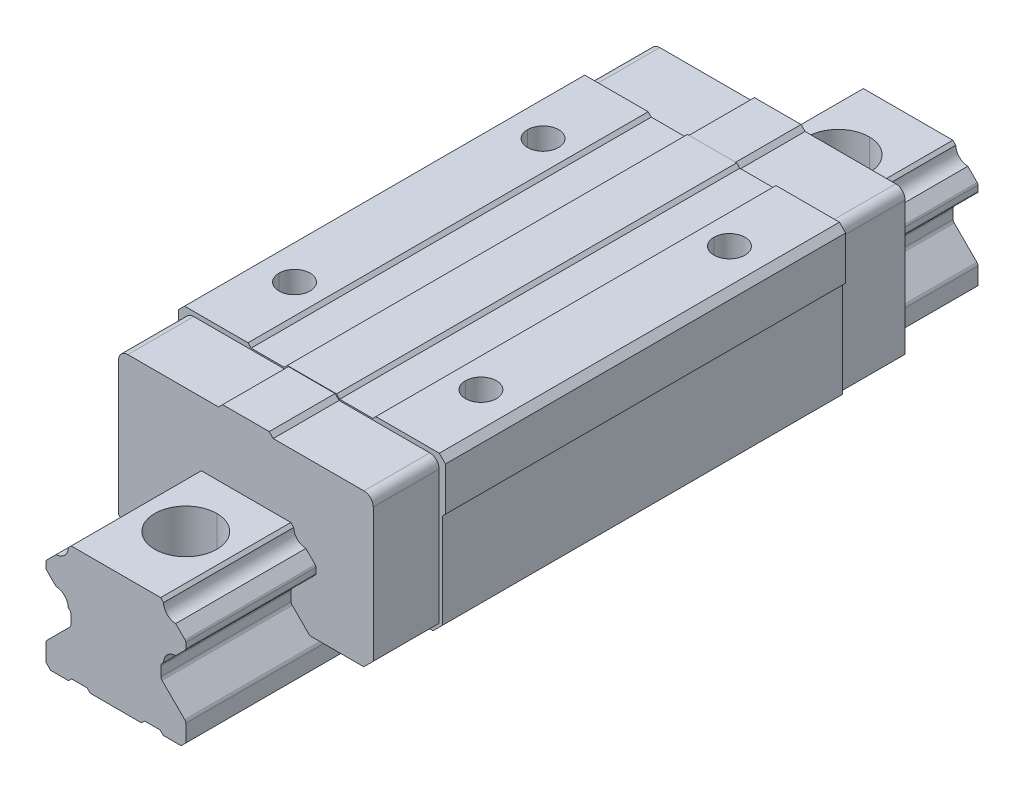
ISO-10303-21;
HEADER;
FILE_DESCRIPTION(('STEP AP214'),'2;1');
FILE_NAME('part.step','',(''),(''),'','','');
FILE_SCHEMA(('AUTOMOTIVE_DESIGN { 1 0 10303 214 1 1 1 1 }'));
ENDSEC;
DATA;
#1=APPLICATION_CONTEXT('core data for automotive mechanical design processes');
#2=APPLICATION_PROTOCOL_DEFINITION('international standard','automotive_design',2000,#1);
#3=PRODUCT_CONTEXT('',#1,'mechanical');
#4=PRODUCT('Part','Part','',(#3));
#5=PRODUCT_RELATED_PRODUCT_CATEGORY('part','',(#4));
#6=PRODUCT_DEFINITION_FORMATION('','',#4);
#7=PRODUCT_DEFINITION_CONTEXT('part definition',#1,'design');
#8=PRODUCT_DEFINITION('design','',#6,#7);
#9=PRODUCT_DEFINITION_SHAPE('','',#8);
#10=(LENGTH_UNIT() NAMED_UNIT(*) SI_UNIT(.MILLI.,.METRE.));
#11=(NAMED_UNIT(*) PLANE_ANGLE_UNIT() SI_UNIT($,.RADIAN.));
#12=(NAMED_UNIT(*) SI_UNIT($,.STERADIAN.) SOLID_ANGLE_UNIT());
#13=UNCERTAINTY_MEASURE_WITH_UNIT(LENGTH_MEASURE(1.E-05),#10,'distance_accuracy_value','');
#14=(GEOMETRIC_REPRESENTATION_CONTEXT(3) GLOBAL_UNCERTAINTY_ASSIGNED_CONTEXT((#13)) GLOBAL_UNIT_ASSIGNED_CONTEXT((#10,
#11,#12)) REPRESENTATION_CONTEXT('',''));
#15=CARTESIAN_POINT('',(0.,0.,0.));
#16=DIRECTION('',(0.,0.,1.));
#17=DIRECTION('',(1.,0.,0.));
#18=AXIS2_PLACEMENT_3D('',#15,#16,#17);
#19=CARTESIAN_POINT('',(0.,0.,105.));
#20=DIRECTION('',(0.,1.,0.));
#21=DIRECTION('',(0.,0.,1.));
#22=AXIS2_PLACEMENT_3D('',#19,#20,#21);
#23=CYLINDRICAL_SURFACE('',#22,10.);
#24=CARTESIAN_POINT('',(0.,-17.,105.));
#25=DIRECTION('',(0.,1.,0.));
#26=DIRECTION('',(0.,0.,1.));
#27=AXIS2_PLACEMENT_3D('',#24,#25,#26);
#28=CIRCLE('',#27,10.);
#29=CARTESIAN_POINT('',(0.,-17.,95.));
#30=VERTEX_POINT('',#29);
#31=CARTESIAN_POINT('',(0.,-17.,115.));
#32=VERTEX_POINT('',#31);
#33=EDGE_CURVE('P0_E444',#30,#32,#28,.T.);
#34=ORIENTED_EDGE('',*,*,#33,.F.);
#35=DIRECTION('',(0.,1.,0.));
#36=VECTOR('',#35,1.);
#37=CARTESIAN_POINT('',(0.,0.,95.));
#38=LINE('',#37,#36);
#39=CARTESIAN_POINT('',(0.,0.,95.));
#40=VERTEX_POINT('',#39);
#41=EDGE_CURVE('P0_E599',#30,#40,#38,.T.);
#42=ORIENTED_EDGE('',*,*,#41,.T.);
#43=CARTESIAN_POINT('',(0.,0.,105.));
#44=DIRECTION('',(0.,-1.,0.));
#45=DIRECTION('',(0.,0.,1.));
#46=AXIS2_PLACEMENT_3D('',#43,#44,#45);
#47=CIRCLE('',#46,10.);
#48=CARTESIAN_POINT('',(0.,0.,115.));
#49=VERTEX_POINT('',#48);
#50=EDGE_CURVE('P0_E10',#49,#40,#47,.T.);
#51=ORIENTED_EDGE('',*,*,#50,.F.);
#52=DIRECTION('',(0.,1.,0.));
#53=VECTOR('',#52,1.);
#54=CARTESIAN_POINT('',(0.,0.,115.));
#55=LINE('',#54,#53);
#56=EDGE_CURVE('P0_E600',#32,#49,#55,.T.);
#57=ORIENTED_EDGE('',*,*,#56,.F.);
#58=EDGE_LOOP('',(#34,#42,#51,#57));
#59=FACE_BOUND('',#58,.T.);
#60=ADVANCED_FACE('P0_F16',(#59),#23,.F.);
#61=CARTESIAN_POINT('',(0.,0.,0.));
#62=DIRECTION('',(0.,1.,0.));
#63=DIRECTION('',(0.,0.,1.));
#64=AXIS2_PLACEMENT_3D('',#61,#62,#63);
#65=CYLINDRICAL_SURFACE('',#64,10.);
#66=CARTESIAN_POINT('',(0.,-17.,0.));
#67=DIRECTION('',(0.,1.,0.));
#68=DIRECTION('',(0.,0.,1.));
#69=AXIS2_PLACEMENT_3D('',#66,#67,#68);
#70=CIRCLE('',#69,10.);
#71=CARTESIAN_POINT('',(0.,-17.,-10.));
#72=VERTEX_POINT('',#71);
#73=CARTESIAN_POINT('',(0.,-17.,10.));
#74=VERTEX_POINT('',#73);
#75=EDGE_CURVE('P0_E438',#72,#74,#70,.T.);
#76=ORIENTED_EDGE('',*,*,#75,.F.);
#77=DIRECTION('',(0.,1.,0.));
#78=VECTOR('',#77,1.);
#79=CARTESIAN_POINT('',(0.,0.,-10.));
#80=LINE('',#79,#78);
#81=CARTESIAN_POINT('',(0.,0.,-10.));
#82=VERTEX_POINT('',#81);
#83=EDGE_CURVE('P0_E587',#72,#82,#80,.T.);
#84=ORIENTED_EDGE('',*,*,#83,.T.);
#85=CARTESIAN_POINT('',(0.,0.,0.));
#86=DIRECTION('',(0.,-1.,0.));
#87=DIRECTION('',(0.,0.,1.));
#88=AXIS2_PLACEMENT_3D('',#85,#86,#87);
#89=CIRCLE('',#88,10.);
#90=CARTESIAN_POINT('',(0.,0.,10.));
#91=VERTEX_POINT('',#90);
#92=EDGE_CURVE('P0_E25',#91,#82,#89,.T.);
#93=ORIENTED_EDGE('',*,*,#92,.F.);
#94=DIRECTION('',(0.,1.,0.));
#95=VECTOR('',#94,1.);
#96=CARTESIAN_POINT('',(0.,0.,10.));
#97=LINE('',#96,#95);
#98=EDGE_CURVE('P0_E591',#74,#91,#97,.T.);
#99=ORIENTED_EDGE('',*,*,#98,.F.);
#100=EDGE_LOOP('',(#76,#84,#93,#99));
#101=FACE_BOUND('',#100,.T.);
#102=ADVANCED_FACE('P0_F1402',(#101),#65,.F.);
#103=CARTESIAN_POINT('',(0.,0.,-105.));
#104=DIRECTION('',(0.,1.,0.));
#105=DIRECTION('',(0.,0.,1.));
#106=AXIS2_PLACEMENT_3D('',#103,#104,#105);
#107=CYLINDRICAL_SURFACE('',#106,10.);
#108=CARTESIAN_POINT('',(0.,-17.,-105.));
#109=DIRECTION('',(0.,1.,0.));
#110=DIRECTION('',(0.,0.,1.));
#111=AXIS2_PLACEMENT_3D('',#108,#109,#110);
#112=CIRCLE('',#111,10.);
#113=CARTESIAN_POINT('',(0.,-17.,-115.));
#114=VERTEX_POINT('',#113);
#115=CARTESIAN_POINT('',(0.,-17.,-95.));
#116=VERTEX_POINT('',#115);
#117=EDGE_CURVE('P0_E400',#114,#116,#112,.T.);
#118=ORIENTED_EDGE('',*,*,#117,.F.);
#119=DIRECTION('',(0.,1.,0.));
#120=VECTOR('',#119,1.);
#121=CARTESIAN_POINT('',(0.,0.,-115.));
#122=LINE('',#121,#120);
#123=CARTESIAN_POINT('',(0.,0.,-115.));
#124=VERTEX_POINT('',#123);
#125=EDGE_CURVE('P0_E573',#114,#124,#122,.T.);
#126=ORIENTED_EDGE('',*,*,#125,.T.);
#127=CARTESIAN_POINT('',(0.,0.,-105.));
#128=DIRECTION('',(0.,-1.,0.));
#129=DIRECTION('',(0.,0.,1.));
#130=AXIS2_PLACEMENT_3D('',#127,#128,#129);
#131=CIRCLE('',#130,10.);
#132=CARTESIAN_POINT('',(0.,0.,-95.));
#133=VERTEX_POINT('',#132);
#134=EDGE_CURVE('P0_E396',#133,#124,#131,.T.);
#135=ORIENTED_EDGE('',*,*,#134,.F.);
#136=DIRECTION('',(0.,1.,0.));
#137=VECTOR('',#136,1.);
#138=CARTESIAN_POINT('',(0.,0.,-95.));
#139=LINE('',#138,#137);
#140=EDGE_CURVE('P0_E579',#116,#133,#139,.T.);
#141=ORIENTED_EDGE('',*,*,#140,.F.);
#142=EDGE_LOOP('',(#118,#126,#135,#141));
#143=FACE_BOUND('',#142,.T.);
#144=ADVANCED_FACE('P0_F1409',(#143),#107,.F.);
#145=CARTESIAN_POINT('',(0.,0.,0.));
#146=DIRECTION('',(0.,1.,0.));
#147=DIRECTION('',(0.,0.,1.));
#148=AXIS2_PLACEMENT_3D('',#145,#146,#147);
#149=CYLINDRICAL_SURFACE('',#148,7.);
#150=CARTESIAN_POINT('',(0.,-38.,0.));
#151=DIRECTION('',(0.,1.,0.));
#152=DIRECTION('',(0.,0.,1.));
#153=AXIS2_PLACEMENT_3D('',#150,#151,#152);
#154=CIRCLE('',#153,7.);
#155=CARTESIAN_POINT('',(0.,-38.,-7.));
#156=VERTEX_POINT('',#155);
#157=CARTESIAN_POINT('',(0.,-38.,7.));
#158=VERTEX_POINT('',#157);
#159=EDGE_CURVE('P0_E329',#156,#158,#154,.T.);
#160=ORIENTED_EDGE('',*,*,#159,.F.);
#161=DIRECTION('',(0.,1.,0.));
#162=VECTOR('',#161,1.);
#163=CARTESIAN_POINT('',(0.,0.,-7.));
#164=LINE('',#163,#162);
#165=CARTESIAN_POINT('',(0.,-17.,-7.));
#166=VERTEX_POINT('',#165);
#167=EDGE_CURVE('P0_E686',#156,#166,#164,.T.);
#168=ORIENTED_EDGE('',*,*,#167,.T.);
#169=CARTESIAN_POINT('',(0.,-17.,0.));
#170=DIRECTION('',(0.,-1.,0.));
#171=DIRECTION('',(0.,0.,1.));
#172=AXIS2_PLACEMENT_3D('',#169,#170,#171);
#173=CIRCLE('',#172,7.);
#174=CARTESIAN_POINT('',(0.,-17.,7.));
#175=VERTEX_POINT('',#174);
#176=EDGE_CURVE('P0_E442',#175,#166,#173,.T.);
#177=ORIENTED_EDGE('',*,*,#176,.F.);
#178=DIRECTION('',(0.,1.,0.));
#179=VECTOR('',#178,1.);
#180=CARTESIAN_POINT('',(0.,0.,7.));
#181=LINE('',#180,#179);
#182=EDGE_CURVE('P0_E702',#158,#175,#181,.T.);
#183=ORIENTED_EDGE('',*,*,#182,.F.);
#184=EDGE_LOOP('',(#160,#168,#177,#183));
#185=FACE_BOUND('',#184,.T.);
#186=ADVANCED_FACE('P0_F1413',(#185),#149,.F.);
#187=CARTESIAN_POINT('',(0.,0.,105.));
#188=DIRECTION('',(0.,1.,0.));
#189=DIRECTION('',(0.,0.,1.));
#190=AXIS2_PLACEMENT_3D('',#187,#188,#189);
#191=CYLINDRICAL_SURFACE('',#190,7.);
#192=CARTESIAN_POINT('',(0.,-38.,105.));
#193=DIRECTION('',(0.,1.,0.));
#194=DIRECTION('',(0.,0.,1.));
#195=AXIS2_PLACEMENT_3D('',#192,#193,#194);
#196=CIRCLE('',#195,7.);
#197=CARTESIAN_POINT('',(0.,-38.,98.));
#198=VERTEX_POINT('',#197);
#199=CARTESIAN_POINT('',(0.,-38.,112.));
#200=VERTEX_POINT('',#199);
#201=EDGE_CURVE('P0_E527',#198,#200,#196,.T.);
#202=ORIENTED_EDGE('',*,*,#201,.F.);
#203=DIRECTION('',(0.,1.,0.));
#204=VECTOR('',#203,1.);
#205=CARTESIAN_POINT('',(0.,0.,98.));
#206=LINE('',#205,#204);
#207=CARTESIAN_POINT('',(0.,-17.,98.));
#208=VERTEX_POINT('',#207);
#209=EDGE_CURVE('P0_E670',#198,#208,#206,.T.);
#210=ORIENTED_EDGE('',*,*,#209,.T.);
#211=CARTESIAN_POINT('',(0.,-17.,105.));
#212=DIRECTION('',(0.,-1.,0.));
#213=DIRECTION('',(0.,0.,1.));
#214=AXIS2_PLACEMENT_3D('',#211,#212,#213);
#215=CIRCLE('',#214,7.);
#216=CARTESIAN_POINT('',(0.,-17.,112.));
#217=VERTEX_POINT('',#216);
#218=EDGE_CURVE('P0_E448',#217,#208,#215,.T.);
#219=ORIENTED_EDGE('',*,*,#218,.F.);
#220=DIRECTION('',(0.,1.,0.));
#221=VECTOR('',#220,1.);
#222=CARTESIAN_POINT('',(0.,0.,112.));
#223=LINE('',#222,#221);
#224=EDGE_CURVE('P0_E681',#200,#217,#223,.T.);
#225=ORIENTED_EDGE('',*,*,#224,.F.);
#226=EDGE_LOOP('',(#202,#210,#219,#225));
#227=FACE_BOUND('',#226,.T.);
#228=ADVANCED_FACE('P0_F1424',(#227),#191,.F.);
#229=CARTESIAN_POINT('',(0.,0.,-105.));
#230=DIRECTION('',(0.,1.,0.));
#231=DIRECTION('',(0.,0.,1.));
#232=AXIS2_PLACEMENT_3D('',#229,#230,#231);
#233=CYLINDRICAL_SURFACE('',#232,7.);
#234=CARTESIAN_POINT('',(0.,-38.,-105.));
#235=DIRECTION('',(0.,1.,0.));
#236=DIRECTION('',(0.,0.,1.));
#237=AXIS2_PLACEMENT_3D('',#234,#235,#236);
#238=CIRCLE('',#237,7.);
#239=CARTESIAN_POINT('',(0.,-38.,-112.));
#240=VERTEX_POINT('',#239);
#241=CARTESIAN_POINT('',(0.,-38.,-98.));
#242=VERTEX_POINT('',#241);
#243=EDGE_CURVE('P0_E523',#240,#242,#238,.T.);
#244=ORIENTED_EDGE('',*,*,#243,.F.);
#245=DIRECTION('',(0.,1.,0.));
#246=VECTOR('',#245,1.);
#247=CARTESIAN_POINT('',(0.,0.,-112.));
#248=LINE('',#247,#246);
#249=CARTESIAN_POINT('',(0.,-17.,-112.));
#250=VERTEX_POINT('',#249);
#251=EDGE_CURVE('P0_E665',#240,#250,#248,.T.);
#252=ORIENTED_EDGE('',*,*,#251,.T.);
#253=CARTESIAN_POINT('',(0.,-17.,-105.));
#254=DIRECTION('',(0.,-1.,0.));
#255=DIRECTION('',(0.,0.,1.));
#256=AXIS2_PLACEMENT_3D('',#253,#254,#255);
#257=CIRCLE('',#256,7.);
#258=CARTESIAN_POINT('',(0.,-17.,-98.));
#259=VERTEX_POINT('',#258);
#260=EDGE_CURVE('P0_E433',#259,#250,#257,.T.);
#261=ORIENTED_EDGE('',*,*,#260,.F.);
#262=DIRECTION('',(0.,1.,0.));
#263=VECTOR('',#262,1.);
#264=CARTESIAN_POINT('',(0.,0.,-98.));
#265=LINE('',#264,#263);
#266=EDGE_CURVE('P0_E664',#242,#259,#265,.T.);
#267=ORIENTED_EDGE('',*,*,#266,.F.);
#268=EDGE_LOOP('',(#244,#252,#261,#267));
#269=FACE_BOUND('',#268,.T.);
#270=ADVANCED_FACE('P0_F1444',(#269),#233,.F.);
#271=CARTESIAN_POINT('',(14.40034900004,-1.137E-13,-127.5));
#272=DIRECTION('',(0.,1.,0.));
#273=DIRECTION('',(1.,0.,0.));
#274=AXIS2_PLACEMENT_3D('',#271,#272,#273);
#275=PLANE('',#274);
#276=ORIENTED_EDGE('',*,*,#50,.T.);
#277=CARTESIAN_POINT('',(0.,0.,105.));
#278=DIRECTION('',(0.,-1.,0.));
#279=DIRECTION('',(0.,0.,1.));
#280=AXIS2_PLACEMENT_3D('',#277,#278,#279);
#281=CIRCLE('',#280,10.);
#282=EDGE_CURVE('P0_E604',#40,#49,#281,.T.);
#283=ORIENTED_EDGE('',*,*,#282,.T.);
#284=EDGE_LOOP('',(#276,#283));
#285=FACE_BOUND('',#284,.T.);
#286=ORIENTED_EDGE('',*,*,#92,.T.);
#287=CARTESIAN_POINT('',(0.,0.,0.));
#288=DIRECTION('',(0.,-1.,0.));
#289=DIRECTION('',(0.,0.,1.));
#290=AXIS2_PLACEMENT_3D('',#287,#288,#289);
#291=CIRCLE('',#290,10.);
#292=EDGE_CURVE('P0_E595',#82,#91,#291,.T.);
#293=ORIENTED_EDGE('',*,*,#292,.T.);
#294=EDGE_LOOP('',(#286,#293));
#295=FACE_BOUND('',#294,.T.);
#296=ORIENTED_EDGE('',*,*,#134,.T.);
#297=CARTESIAN_POINT('',(0.,0.,-105.));
#298=DIRECTION('',(0.,-1.,0.));
#299=DIRECTION('',(0.,0.,1.));
#300=AXIS2_PLACEMENT_3D('',#297,#298,#299);
#301=CIRCLE('',#300,10.);
#302=EDGE_CURVE('P0_E583',#124,#133,#301,.T.);
#303=ORIENTED_EDGE('',*,*,#302,.T.);
#304=EDGE_LOOP('',(#296,#303));
#305=FACE_BOUND('',#304,.T.);
#306=DIRECTION('',(0.,0.,1.));
#307=VECTOR('',#306,1.);
#308=CARTESIAN_POINT('',(-14.4003490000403,-1.137E-13,-127.5));
#309=LINE('',#308,#307);
#310=CARTESIAN_POINT('',(-14.4003490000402,-1.54572897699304E-13,-127.5));
#311=VERTEX_POINT('',#310);
#312=CARTESIAN_POINT('',(-14.4003490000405,-5.50124319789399E-13,127.5));
#313=VERTEX_POINT('',#312);
#314=EDGE_CURVE('P0_E51',#311,#313,#309,.T.);
#315=ORIENTED_EDGE('',*,*,#314,.T.);
#316=DIRECTION('',(1.,0.,0.));
#317=VECTOR('',#316,1.);
#318=CARTESIAN_POINT('',(14.40034900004,-1.137E-13,127.5));
#319=LINE('',#318,#317);
#320=CARTESIAN_POINT('',(14.4003490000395,-3.32287460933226E-13,127.5));
#321=VERTEX_POINT('',#320);
#322=EDGE_CURVE('P0_E19',#313,#321,#319,.T.);
#323=ORIENTED_EDGE('',*,*,#322,.T.);
#324=DIRECTION('',(0.,0.,-1.));
#325=VECTOR('',#324,1.);
#326=CARTESIAN_POINT('',(14.4003490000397,-1.137E-13,-127.5));
#327=LINE('',#326,#325);
#328=CARTESIAN_POINT('',(14.4003490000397,-1.56735415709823E-13,-127.5));
#329=VERTEX_POINT('',#328);
#330=EDGE_CURVE('P0_E607',#321,#329,#327,.T.);
#331=ORIENTED_EDGE('',*,*,#330,.T.);
#332=DIRECTION('',(-1.,0.,0.));
#333=VECTOR('',#332,1.);
#334=CARTESIAN_POINT('',(14.40034900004,-1.137E-13,-127.5));
#335=LINE('',#334,#333);
#336=EDGE_CURVE('P0_E621',#329,#311,#335,.T.);
#337=ORIENTED_EDGE('',*,*,#336,.T.);
#338=EDGE_LOOP('',(#315,#323,#331,#337));
#339=FACE_BOUND('',#338,.T.);
#340=ADVANCED_FACE('P0_F633',(#285,#295,#305,#339),#275,.T.);
#341=CARTESIAN_POINT('',(0.,0.,127.5));
#342=DIRECTION('',(0.,0.,1.));
#343=DIRECTION('',(1.,0.,0.));
#344=AXIS2_PLACEMENT_3D('',#341,#342,#343);
#345=PLANE('',#344);
#346=DIRECTION('',(0.,1.,0.));
#347=VECTOR('',#346,1.);
#348=CARTESIAN_POINT('',(22.5,0.,127.5));
#349=LINE('',#348,#347);
#350=CARTESIAN_POINT('',(22.5,-10.1690071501,127.5));
#351=VERTEX_POINT('',#350);
#352=CARTESIAN_POINT('',(22.4999999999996,-8.4310218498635,127.5));
#353=VERTEX_POINT('',#352);
#354=EDGE_CURVE('P0_E567',#351,#353,#349,.T.);
#355=ORIENTED_EDGE('',*,*,#354,.T.);
#356=CARTESIAN_POINT('',(21.7,-8.431021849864,127.5));
#357=DIRECTION('',(0.,0.,-1.));
#358=DIRECTION('',(1.,-4.37367156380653E-12,0.));
#359=AXIS2_PLACEMENT_3D('',#356,#357,#358);
#360=CIRCLE('',#359,0.8);
#361=CARTESIAN_POINT('',(22.2656854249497,-7.86533642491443,127.5));
#362=VERTEX_POINT('',#361);
#363=EDGE_CURVE('P0_E423',#362,#353,#360,.T.);
#364=ORIENTED_EDGE('',*,*,#363,.F.);
#365=DIRECTION('',(-0.707106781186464,0.707106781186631,0.));
#366=VECTOR('',#365,1.);
#367=CARTESIAN_POINT('',(22.2656854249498,-7.8653364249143,127.5));
#368=LINE('',#367,#366);
#369=CARTESIAN_POINT('',(19.2337171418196,-4.83336814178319,127.5));
#370=VERTEX_POINT('',#369);
#371=EDGE_CURVE('P0_E460',#362,#370,#368,.T.);
#372=ORIENTED_EDGE('',*,*,#371,.T.);
#373=CARTESIAN_POINT('',(19.33229302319,-0.8345829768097,127.5));
#374=DIRECTION('',(0.,0.,-1.));
#375=DIRECTION('',(1.,0.,0.));
#376=AXIS2_PLACEMENT_3D('',#373,#374,#375);
#377=CIRCLE('',#376,4.);
#378=CARTESIAN_POINT('',(15.3335078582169,-0.933158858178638,127.5));
#379=VERTEX_POINT('',#378);
#380=EDGE_CURVE('P0_E467',#370,#379,#377,.T.);
#381=ORIENTED_EDGE('',*,*,#380,.T.);
#382=DIRECTION('',(-0.707106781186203,0.707106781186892,0.));
#383=VECTOR('',#382,1.);
#384=CARTESIAN_POINT('',(15.3335078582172,-0.933158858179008,127.5));
#385=LINE('',#384,#383);
#386=EDGE_CURVE('P0_E611',#379,#321,#385,.T.);
#387=ORIENTED_EDGE('',*,*,#386,.T.);
#388=ORIENTED_EDGE('',*,*,#322,.F.);
#389=DIRECTION('',(-0.707106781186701,-0.707106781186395,0.));
#390=VECTOR('',#389,1.);
#391=CARTESIAN_POINT('',(-14.4003490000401,-1.99542961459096E-13,127.5));
#392=LINE('',#391,#390);
#393=CARTESIAN_POINT('',(-15.3335078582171,-0.933158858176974,127.5));
#394=VERTEX_POINT('',#393);
#395=EDGE_CURVE('P0_E624',#313,#394,#392,.T.);
#396=ORIENTED_EDGE('',*,*,#395,.T.);
#397=CARTESIAN_POINT('',(-19.33229302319,-0.8345829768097,127.5));
#398=DIRECTION('',(0.,0.,-1.));
#399=DIRECTION('',(1.,0.,0.));
#400=AXIS2_PLACEMENT_3D('',#397,#398,#399);
#401=CIRCLE('',#400,4.);
#402=CARTESIAN_POINT('',(-19.2337171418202,-4.83336814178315,127.5));
#403=VERTEX_POINT('',#402);
#404=EDGE_CURVE('P0_E388',#394,#403,#401,.T.);
#405=ORIENTED_EDGE('',*,*,#404,.T.);
#406=DIRECTION('',(-0.707106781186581,-0.707106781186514,0.));
#407=VECTOR('',#406,1.);
#408=CARTESIAN_POINT('',(-19.2337171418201,-4.8333681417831,127.5));
#409=LINE('',#408,#407);
#410=CARTESIAN_POINT('',(-22.2656854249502,-7.86533642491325,127.5));
#411=VERTEX_POINT('',#410);
#412=EDGE_CURVE('P0_E475',#403,#411,#409,.T.);
#413=ORIENTED_EDGE('',*,*,#412,.T.);
#414=CARTESIAN_POINT('',(-21.7,-8.431021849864,127.5));
#415=DIRECTION('',(0.,0.,-1.));
#416=DIRECTION('',(1.,0.,0.));
#417=AXIS2_PLACEMENT_3D('',#414,#415,#416);
#418=CIRCLE('',#417,0.8);
#419=CARTESIAN_POINT('',(-22.5,-8.43102184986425,127.5));
#420=VERTEX_POINT('',#419);
#421=EDGE_CURVE('P0_E2810',#420,#411,#418,.T.);
#422=ORIENTED_EDGE('',*,*,#421,.F.);
#423=DIRECTION('',(0.,-1.,0.));
#424=VECTOR('',#423,1.);
#425=CARTESIAN_POINT('',(-22.5,0.,127.5));
#426=LINE('',#425,#424);
#427=CARTESIAN_POINT('',(-22.5000000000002,-10.1690071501,127.5));
#428=VERTEX_POINT('',#427);
#429=EDGE_CURVE('P0_E480',#420,#428,#426,.T.);
#430=ORIENTED_EDGE('',*,*,#429,.T.);
#431=CARTESIAN_POINT('',(-21.7,-10.1690071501,127.5));
#432=DIRECTION('',(0.,0.,-1.));
#433=DIRECTION('',(1.,0.,0.));
#434=AXIS2_PLACEMENT_3D('',#431,#432,#433);
#435=CIRCLE('',#434,0.8);
#436=CARTESIAN_POINT('',(-22.2656854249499,-10.73469257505,127.5));
#437=VERTEX_POINT('',#436);
#438=EDGE_CURVE('P0_E2691',#437,#428,#435,.T.);
#439=ORIENTED_EDGE('',*,*,#438,.F.);
#440=DIRECTION('',(0.707106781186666,-0.707106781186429,0.));
#441=VECTOR('',#440,1.);
#442=CARTESIAN_POINT('',(-22.26568542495,-10.73469257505,127.5));
#443=LINE('',#442,#441);
#444=CARTESIAN_POINT('',(-19.234748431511,-13.765629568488,127.5));
#445=VERTEX_POINT('',#444);
#446=EDGE_CURVE('P0_E489',#437,#445,#443,.T.);
#447=ORIENTED_EDGE('',*,*,#446,.T.);
#448=CARTESIAN_POINT('',(-19.33229302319,-17.76444002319,127.5));
#449=DIRECTION('',(0.,0.,-1.));
#450=DIRECTION('',(1.,0.,0.));
#451=AXIS2_PLACEMENT_3D('',#448,#449,#450);
#452=CIRCLE('',#451,4.);
#453=CARTESIAN_POINT('',(-15.333482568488,-17.6668954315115,127.5));
#454=VERTEX_POINT('',#453);
#455=EDGE_CURVE('P0_E454',#445,#454,#452,.T.);
#456=ORIENTED_EDGE('',*,*,#455,.T.);
#457=DIRECTION('',(-0.707106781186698,0.707106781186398,0.));
#458=VECTOR('',#457,1.);
#459=CARTESIAN_POINT('',(-15.33348256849,-17.66689543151,127.5));
#460=LINE('',#459,#458);
#461=CARTESIAN_POINT('',(-14.8514718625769,-18.1489061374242,127.5));
#462=VERTEX_POINT('',#461);
#463=EDGE_CURVE('P0_E2658',#462,#454,#460,.T.);
#464=ORIENTED_EDGE('',*,*,#463,.F.);
#465=CARTESIAN_POINT('',(-15.7,-18.99743427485,127.5));
#466=DIRECTION('',(0.,0.,-1.));
#467=DIRECTION('',(1.,0.,0.));
#468=AXIS2_PLACEMENT_3D('',#465,#466,#467);
#469=CIRCLE('',#468,1.2);
#470=CARTESIAN_POINT('',(-14.5,-18.99743427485,127.5));
#471=VERTEX_POINT('',#470);
#472=EDGE_CURVE('P0_E2616',#462,#471,#469,.T.);
#473=ORIENTED_EDGE('',*,*,#472,.T.);
#474=DIRECTION('',(0.,-1.,0.));
#475=VECTOR('',#474,1.);
#476=CARTESIAN_POINT('',(-14.5,0.,127.5));
#477=LINE('',#476,#475);
#478=CARTESIAN_POINT('',(-14.5000000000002,-22.00261712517,127.5));
#479=VERTEX_POINT('',#478);
#480=EDGE_CURVE('P0_E499',#471,#479,#477,.T.);
#481=ORIENTED_EDGE('',*,*,#480,.T.);
#482=CARTESIAN_POINT('',(-15.7,-22.00261712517,127.5));
#483=DIRECTION('',(0.,0.,-1.));
#484=DIRECTION('',(1.,0.,0.));
#485=AXIS2_PLACEMENT_3D('',#482,#483,#484);
#486=CIRCLE('',#485,1.2);
#487=CARTESIAN_POINT('',(-14.8514718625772,-22.8511452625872,127.5));
#488=VERTEX_POINT('',#487);
#489=EDGE_CURVE('P0_E2564',#479,#488,#486,.T.);
#490=ORIENTED_EDGE('',*,*,#489,.T.);
#491=DIRECTION('',(-0.70710678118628,-0.707106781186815,0.));
#492=VECTOR('',#491,1.);
#493=CARTESIAN_POINT('',(-14.8514718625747,-22.8511452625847,127.5));
#494=LINE('',#493,#492);
#495=CARTESIAN_POINT('',(-22.1485281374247,-30.148201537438,127.5));
#496=VERTEX_POINT('',#495);
#497=EDGE_CURVE('P0_E507',#488,#496,#494,.T.);
#498=ORIENTED_EDGE('',*,*,#497,.T.);
#499=CARTESIAN_POINT('',(-21.3,-30.99672967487,127.5));
#500=DIRECTION('',(0.,0.,-1.));
#501=DIRECTION('',(1.,0.,0.));
#502=AXIS2_PLACEMENT_3D('',#499,#500,#501);
#503=CIRCLE('',#502,1.2);
#504=CARTESIAN_POINT('',(-22.5,-30.99672967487,127.5));
#505=VERTEX_POINT('',#504);
#506=EDGE_CURVE('P0_E778',#505,#496,#503,.T.);
#507=ORIENTED_EDGE('',*,*,#506,.F.);
#508=DIRECTION('',(0.,-1.,0.));
#509=VECTOR('',#508,1.);
#510=CARTESIAN_POINT('',(-22.5,0.,127.5));
#511=LINE('',#510,#509);
#512=CARTESIAN_POINT('',(-22.5,-36.5,127.5));
#513=VERTEX_POINT('',#512);
#514=EDGE_CURVE('P0_E516',#505,#513,#511,.T.);
#515=ORIENTED_EDGE('',*,*,#514,.T.);
#516=DIRECTION('',(0.707106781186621,-0.707106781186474,0.));
#517=VECTOR('',#516,1.);
#518=CARTESIAN_POINT('',(-22.5,-36.5,127.5));
#519=LINE('',#518,#517);
#520=CARTESIAN_POINT('',(-20.9999999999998,-38.,127.5));
#521=VERTEX_POINT('',#520);
#522=EDGE_CURVE('P0_E360',#513,#521,#519,.T.);
#523=ORIENTED_EDGE('',*,*,#522,.T.);
#524=DIRECTION('',(1.,0.,0.));
#525=VECTOR('',#524,1.);
#526=CARTESIAN_POINT('',(0.,-38.,127.5));
#527=LINE('',#526,#525);
#528=CARTESIAN_POINT('',(-15.25037431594,-38.,127.5));
#529=VERTEX_POINT('',#528);
#530=EDGE_CURVE('P0_E359',#521,#529,#527,.T.);
#531=ORIENTED_EDGE('',*,*,#530,.T.);
#532=DIRECTION('',(-0.707106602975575,-0.707106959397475,0.));
#533=VECTOR('',#532,1.);
#534=CARTESIAN_POINT('',(-15.25037431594,-38.,127.5));
#535=LINE('',#534,#533);
#536=CARTESIAN_POINT('',(-14.2503747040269,-36.9999999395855,127.5));
#537=VERTEX_POINT('',#536);
#538=EDGE_CURVE('P0_E889',#537,#529,#535,.T.);
#539=ORIENTED_EDGE('',*,*,#538,.F.);
#540=DIRECTION('',(1.,0.,0.));
#541=VECTOR('',#540,1.);
#542=CARTESIAN_POINT('',(0.,-36.9999999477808,127.5));
#543=LINE('',#542,#541);
#544=CARTESIAN_POINT('',(-9.25037481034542,-36.9999999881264,127.5));
#545=VERTEX_POINT('',#544);
#546=EDGE_CURVE('P0_E379',#537,#545,#543,.T.);
#547=ORIENTED_EDGE('',*,*,#546,.T.);
#548=DIRECTION('',(-0.707107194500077,0.707106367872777,0.));
#549=VECTOR('',#548,1.);
#550=CARTESIAN_POINT('',(-9.2503748,-37.,127.5));
#551=LINE('',#550,#549);
#552=CARTESIAN_POINT('',(-8.25037363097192,-38.,127.5));
#553=VERTEX_POINT('',#552);
#554=EDGE_CURVE('P0_E725',#553,#545,#551,.T.);
#555=ORIENTED_EDGE('',*,*,#554,.F.);
#556=DIRECTION('',(1.,0.,0.));
#557=VECTOR('',#556,1.);
#558=CARTESIAN_POINT('',(0.,-38.,127.5));
#559=LINE('',#558,#557);
#560=CARTESIAN_POINT('',(8.24962201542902,-38.,127.5));
#561=VERTEX_POINT('',#560);
#562=EDGE_CURVE('P0_E378',#553,#561,#559,.T.);
#563=ORIENTED_EDGE('',*,*,#562,.T.);
#564=DIRECTION('',(-0.707107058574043,-0.707106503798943,0.));
#565=VECTOR('',#564,1.);
#566=CARTESIAN_POINT('',(8.24962201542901,-38.,127.5));
#567=LINE('',#566,#565);
#568=CARTESIAN_POINT('',(9.24962299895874,-36.9999998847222,127.5));
#569=VERTEX_POINT('',#568);
#570=EDGE_CURVE('P0_E729',#569,#561,#567,.T.);
#571=ORIENTED_EDGE('',*,*,#570,.F.);
#572=DIRECTION('',(1.,0.,0.));
#573=VECTOR('',#572,1.);
#574=CARTESIAN_POINT('',(0.,-36.9999998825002,127.5));
#575=LINE('',#574,#573);
#576=CARTESIAN_POINT('',(14.249621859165,-37.000000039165,127.5));
#577=VERTEX_POINT('',#576);
#578=EDGE_CURVE('P0_E342',#569,#577,#575,.T.);
#579=ORIENTED_EDGE('',*,*,#578,.T.);
#580=DIRECTION('',(-0.707106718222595,0.707106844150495,0.));
#581=VECTOR('',#580,1.);
#582=CARTESIAN_POINT('',(14.249622,-37.00000018,127.5));
#583=LINE('',#582,#581);
#584=CARTESIAN_POINT('',(15.2496216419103,-38.,127.5));
#585=VERTEX_POINT('',#584);
#586=EDGE_CURVE('P0_E739',#585,#577,#583,.T.);
#587=ORIENTED_EDGE('',*,*,#586,.F.);
#588=DIRECTION('',(1.,0.,0.));
#589=VECTOR('',#588,1.);
#590=CARTESIAN_POINT('',(0.,-38.,127.5));
#591=LINE('',#590,#589);
#592=CARTESIAN_POINT('',(21.,-38.,127.5));
#593=VERTEX_POINT('',#592);
#594=EDGE_CURVE('P0_E332',#585,#593,#591,.T.);
#595=ORIENTED_EDGE('',*,*,#594,.T.);
#596=DIRECTION('',(0.707106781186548,0.707106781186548,0.));
#597=VECTOR('',#596,1.);
#598=CARTESIAN_POINT('',(21.,-38.,127.5));
#599=LINE('',#598,#597);
#600=CARTESIAN_POINT('',(22.5,-36.5,127.5));
#601=VERTEX_POINT('',#600);
#602=EDGE_CURVE('P0_E235',#593,#601,#599,.T.);
#603=ORIENTED_EDGE('',*,*,#602,.T.);
#604=DIRECTION('',(0.,1.,0.));
#605=VECTOR('',#604,1.);
#606=CARTESIAN_POINT('',(22.5,0.,127.5));
#607=LINE('',#606,#605);
#608=CARTESIAN_POINT('',(22.5,-30.99672967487,127.5));
#609=VERTEX_POINT('',#608);
#610=EDGE_CURVE('P0_E256',#601,#609,#607,.T.);
#611=ORIENTED_EDGE('',*,*,#610,.T.);
#612=CARTESIAN_POINT('',(21.3,-30.99672967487,127.5));
#613=DIRECTION('',(0.,0.,-1.));
#614=DIRECTION('',(1.,0.,0.));
#615=AXIS2_PLACEMENT_3D('',#612,#613,#614);
#616=CIRCLE('',#615,1.2);
#617=CARTESIAN_POINT('',(22.1485281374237,-30.1482015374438,127.5));
#618=VERTEX_POINT('',#617);
#619=EDGE_CURVE('P0_E318',#618,#609,#616,.T.);
#620=ORIENTED_EDGE('',*,*,#619,.F.);
#621=DIRECTION('',(-0.707106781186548,0.707106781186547,0.));
#622=VECTOR('',#621,1.);
#623=CARTESIAN_POINT('',(22.1485281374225,-30.1482015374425,127.5));
#624=LINE('',#623,#622);
#625=CARTESIAN_POINT('',(14.8514718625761,-22.8511452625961,127.5));
#626=VERTEX_POINT('',#625);
#627=EDGE_CURVE('P0_E304',#618,#626,#624,.T.);
#628=ORIENTED_EDGE('',*,*,#627,.T.);
#629=CARTESIAN_POINT('',(15.7,-22.00261712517,127.5));
#630=DIRECTION('',(0.,0.,-1.));
#631=DIRECTION('',(1.,0.,0.));
#632=AXIS2_PLACEMENT_3D('',#629,#630,#631);
#633=CIRCLE('',#632,1.2);
#634=CARTESIAN_POINT('',(14.5,-22.00261712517,127.5));
#635=VERTEX_POINT('',#634);
#636=EDGE_CURVE('P0_E369',#626,#635,#633,.T.);
#637=ORIENTED_EDGE('',*,*,#636,.T.);
#638=DIRECTION('',(0.,1.,0.));
#639=VECTOR('',#638,1.);
#640=CARTESIAN_POINT('',(14.5,0.,127.5));
#641=LINE('',#640,#639);
#642=CARTESIAN_POINT('',(14.5,-18.99743427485,127.5));
#643=VERTEX_POINT('',#642);
#644=EDGE_CURVE('P0_E541',#635,#643,#641,.T.);
#645=ORIENTED_EDGE('',*,*,#644,.T.);
#646=CARTESIAN_POINT('',(15.7,-18.99743427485,127.5));
#647=DIRECTION('',(0.,0.,-1.));
#648=DIRECTION('',(1.,0.,0.));
#649=AXIS2_PLACEMENT_3D('',#646,#647,#648);
#650=CIRCLE('',#649,1.2);
#651=CARTESIAN_POINT('',(14.8514718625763,-18.1489061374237,127.5));
#652=VERTEX_POINT('',#651);
#653=EDGE_CURVE('P0_E404',#643,#652,#650,.T.);
#654=ORIENTED_EDGE('',*,*,#653,.T.);
#655=DIRECTION('',(-0.707106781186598,-0.707106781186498,0.));
#656=VECTOR('',#655,1.);
#657=CARTESIAN_POINT('',(14.85147186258,-18.14890613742,127.5));
#658=LINE('',#657,#656);
#659=CARTESIAN_POINT('',(15.333482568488,-17.6668954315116,127.5));
#660=VERTEX_POINT('',#659);
#661=EDGE_CURVE('P0_E410',#660,#652,#658,.T.);
#662=ORIENTED_EDGE('',*,*,#661,.F.);
#663=CARTESIAN_POINT('',(19.33229302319,-17.76444002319,127.5));
#664=DIRECTION('',(0.,0.,-1.));
#665=DIRECTION('',(1.,0.,0.));
#666=AXIS2_PLACEMENT_3D('',#663,#664,#665);
#667=CIRCLE('',#666,4.);
#668=CARTESIAN_POINT('',(19.2347484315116,-13.7656295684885,127.5));
#669=VERTEX_POINT('',#668);
#670=EDGE_CURVE('P0_E556',#660,#669,#667,.T.);
#671=ORIENTED_EDGE('',*,*,#670,.T.);
#672=DIRECTION('',(0.707106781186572,0.707106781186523,0.));
#673=VECTOR('',#672,1.);
#674=CARTESIAN_POINT('',(19.2347484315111,-13.765629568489,127.5));
#675=LINE('',#674,#673);
#676=CARTESIAN_POINT('',(22.2656854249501,-10.7346925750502,127.5));
#677=VERTEX_POINT('',#676);
#678=EDGE_CURVE('P0_E560',#669,#677,#675,.T.);
#679=ORIENTED_EDGE('',*,*,#678,.T.);
#680=CARTESIAN_POINT('',(21.7,-10.1690071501,127.5));
#681=DIRECTION('',(0.,0.,-1.));
#682=DIRECTION('',(1.,0.,0.));
#683=AXIS2_PLACEMENT_3D('',#680,#681,#682);
#684=CIRCLE('',#683,0.8);
#685=EDGE_CURVE('P0_E418',#351,#677,#684,.T.);
#686=ORIENTED_EDGE('',*,*,#685,.F.);
#687=EDGE_LOOP('',(#355,#364,#372,#381,#387,#388,#396,#405,#413,#422,#430,#439,#447,#456,#464,
#473,#481,#490,#498,#507,#515,#523,#531,#539,#547,#555,#563,#571,#579,#587,#595,#603,#611,#620,
#628,#637,#645,#654,#662,#671,#679,#686));
#688=FACE_BOUND('',#687,.T.);
#689=ADVANCED_FACE('P0_F636',(#688),#345,.T.);
#690=CARTESIAN_POINT('',(-14.40034900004,0.,-127.5));
#691=DIRECTION('',(-0.707106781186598,0.707106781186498,0.));
#692=DIRECTION('',(0.,0.,1.));
#693=AXIS2_PLACEMENT_3D('',#690,#691,#692);
#694=PLANE('',#693);
#695=DIRECTION('',(0.,0.,1.));
#696=VECTOR('',#695,1.);
#697=CARTESIAN_POINT('',(-15.3335078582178,-0.933158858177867,-127.5));
#698=LINE('',#697,#696);
#699=CARTESIAN_POINT('',(-15.3335078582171,-0.933158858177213,-127.5));
#700=VERTEX_POINT('',#699);
#701=EDGE_CURVE('P0_E471',#700,#394,#698,.T.);
#702=ORIENTED_EDGE('',*,*,#701,.T.);
#703=ORIENTED_EDGE('',*,*,#395,.F.);
#704=ORIENTED_EDGE('',*,*,#314,.F.);
#705=DIRECTION('',(-0.707106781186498,-0.707106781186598,0.));
#706=VECTOR('',#705,1.);
#707=CARTESIAN_POINT('',(-14.40034900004,0.,-127.5));
#708=LINE('',#707,#706);
#709=EDGE_CURVE('P0_E618',#311,#700,#708,.T.);
#710=ORIENTED_EDGE('',*,*,#709,.T.);
#711=EDGE_LOOP('',(#702,#703,#704,#710));
#712=FACE_BOUND('',#711,.T.);
#713=ADVANCED_FACE('P0_F647',(#712),#694,.T.);
#714=CARTESIAN_POINT('',(0.,0.,-127.5));
#715=DIRECTION('',(0.,0.,1.));
#716=DIRECTION('',(1.,0.,0.));
#717=AXIS2_PLACEMENT_3D('',#714,#715,#716);
#718=PLANE('',#717);
#719=DIRECTION('',(0.,1.,0.));
#720=VECTOR('',#719,1.);
#721=CARTESIAN_POINT('',(22.5,0.,-127.5));
#722=LINE('',#721,#720);
#723=CARTESIAN_POINT('',(22.5,-10.1690071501,-127.5));
#724=VERTEX_POINT('',#723);
#725=CARTESIAN_POINT('',(22.4999999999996,-8.4310218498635,-127.5));
#726=VERTEX_POINT('',#725);
#727=EDGE_CURVE('P0_E570',#724,#726,#722,.T.);
#728=ORIENTED_EDGE('',*,*,#727,.F.);
#729=CARTESIAN_POINT('',(21.7,-10.1690071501,-127.5));
#730=DIRECTION('',(0.,0.,1.));
#731=DIRECTION('',(1.,0.,0.));
#732=AXIS2_PLACEMENT_3D('',#729,#730,#731);
#733=CIRCLE('',#732,0.8);
#734=CARTESIAN_POINT('',(22.2656854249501,-10.7346925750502,-127.5));
#735=VERTEX_POINT('',#734);
#736=EDGE_CURVE('P0_E417',#735,#724,#733,.T.);
#737=ORIENTED_EDGE('',*,*,#736,.F.);
#738=DIRECTION('',(0.707106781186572,0.707106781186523,0.));
#739=VECTOR('',#738,1.);
#740=CARTESIAN_POINT('',(19.2347484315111,-13.765629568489,-127.5));
#741=LINE('',#740,#739);
#742=CARTESIAN_POINT('',(19.2347484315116,-13.7656295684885,-127.5));
#743=VERTEX_POINT('',#742);
#744=EDGE_CURVE('P0_E563',#743,#735,#741,.T.);
#745=ORIENTED_EDGE('',*,*,#744,.F.);
#746=CARTESIAN_POINT('',(19.33229302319,-17.76444002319,-127.5));
#747=DIRECTION('',(0.,0.,-1.));
#748=DIRECTION('',(1.,0.,0.));
#749=AXIS2_PLACEMENT_3D('',#746,#747,#748);
#750=CIRCLE('',#749,4.);
#751=CARTESIAN_POINT('',(15.333482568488,-17.6668954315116,-127.5));
#752=VERTEX_POINT('',#751);
#753=EDGE_CURVE('P0_E548',#752,#743,#750,.T.);
#754=ORIENTED_EDGE('',*,*,#753,.F.);
#755=DIRECTION('',(0.707106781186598,0.707106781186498,0.));
#756=VECTOR('',#755,1.);
#757=CARTESIAN_POINT('',(14.85147186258,-18.14890613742,-127.5));
#758=LINE('',#757,#756);
#759=CARTESIAN_POINT('',(14.8514718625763,-18.1489061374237,-127.5));
#760=VERTEX_POINT('',#759);
#761=EDGE_CURVE('P0_E405',#760,#752,#758,.T.);
#762=ORIENTED_EDGE('',*,*,#761,.F.);
#763=CARTESIAN_POINT('',(15.7,-18.99743427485,-127.5));
#764=DIRECTION('',(0.,0.,1.));
#765=DIRECTION('',(1.,0.,0.));
#766=AXIS2_PLACEMENT_3D('',#763,#764,#765);
#767=CIRCLE('',#766,1.2);
#768=CARTESIAN_POINT('',(14.5,-18.99743427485,-127.5));
#769=VERTEX_POINT('',#768);
#770=EDGE_CURVE('P0_E383',#760,#769,#767,.T.);
#771=ORIENTED_EDGE('',*,*,#770,.T.);
#772=DIRECTION('',(0.,1.,0.));
#773=VECTOR('',#772,1.);
#774=CARTESIAN_POINT('',(14.5,0.,-127.5));
#775=LINE('',#774,#773);
#776=CARTESIAN_POINT('',(14.5,-22.00261712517,-127.5));
#777=VERTEX_POINT('',#776);
#778=EDGE_CURVE('P0_E545',#777,#769,#775,.T.);
#779=ORIENTED_EDGE('',*,*,#778,.F.);
#780=CARTESIAN_POINT('',(15.7,-22.00261712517,-127.5));
#781=DIRECTION('',(0.,0.,1.));
#782=DIRECTION('',(1.,0.,0.));
#783=AXIS2_PLACEMENT_3D('',#780,#781,#782);
#784=CIRCLE('',#783,1.2);
#785=CARTESIAN_POINT('',(14.851471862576,-22.8511452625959,-127.5));
#786=VERTEX_POINT('',#785);
#787=EDGE_CURVE('P0_E337',#777,#786,#784,.T.);
#788=ORIENTED_EDGE('',*,*,#787,.T.);
#789=DIRECTION('',(-0.707106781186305,0.70710678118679,0.));
#790=VECTOR('',#789,1.);
#791=CARTESIAN_POINT('',(22.1485281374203,-30.1482015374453,-127.5));
#792=LINE('',#791,#790);
#793=CARTESIAN_POINT('',(22.1485281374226,-30.1482015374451,-127.5));
#794=VERTEX_POINT('',#793);
#795=EDGE_CURVE('P0_E310',#794,#786,#792,.T.);
#796=ORIENTED_EDGE('',*,*,#795,.F.);
#797=CARTESIAN_POINT('',(21.3,-30.99672967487,-127.5));
#798=DIRECTION('',(0.,0.,1.));
#799=DIRECTION('',(1.,0.,0.));
#800=AXIS2_PLACEMENT_3D('',#797,#798,#799);
#801=CIRCLE('',#800,1.2);
#802=CARTESIAN_POINT('',(22.5,-30.99672967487,-127.5));
#803=VERTEX_POINT('',#802);
#804=EDGE_CURVE('P0_E307',#803,#794,#801,.T.);
#805=ORIENTED_EDGE('',*,*,#804,.F.);
#806=DIRECTION('',(0.,1.,0.));
#807=VECTOR('',#806,1.);
#808=CARTESIAN_POINT('',(22.5,0.,-127.5));
#809=LINE('',#808,#807);
#810=CARTESIAN_POINT('',(22.5,-36.5,-127.5));
#811=VERTEX_POINT('',#810);
#812=EDGE_CURVE('P0_E296',#811,#803,#809,.T.);
#813=ORIENTED_EDGE('',*,*,#812,.F.);
#814=DIRECTION('',(0.707106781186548,0.707106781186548,0.));
#815=VECTOR('',#814,1.);
#816=CARTESIAN_POINT('',(21.,-38.,-127.5));
#817=LINE('',#816,#815);
#818=CARTESIAN_POINT('',(21.,-38.,-127.5));
#819=VERTEX_POINT('',#818);
#820=EDGE_CURVE('P0_E243',#819,#811,#817,.T.);
#821=ORIENTED_EDGE('',*,*,#820,.F.);
#822=DIRECTION('',(1.,0.,0.));
#823=VECTOR('',#822,1.);
#824=CARTESIAN_POINT('',(0.,-38.,-127.5));
#825=LINE('',#824,#823);
#826=CARTESIAN_POINT('',(15.2496216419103,-38.,-127.5));
#827=VERTEX_POINT('',#826);
#828=EDGE_CURVE('P0_E330',#827,#819,#825,.T.);
#829=ORIENTED_EDGE('',*,*,#828,.F.);
#830=DIRECTION('',(0.707106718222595,-0.707106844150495,0.));
#831=VECTOR('',#830,1.);
#832=CARTESIAN_POINT('',(14.249622,-37.00000018,-127.5));
#833=LINE('',#832,#831);
#834=CARTESIAN_POINT('',(14.2496218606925,-37.0000000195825,-127.5));
#835=VERTEX_POINT('',#834);
#836=EDGE_CURVE('P0_E694',#835,#827,#833,.T.);
#837=ORIENTED_EDGE('',*,*,#836,.F.);
#838=DIRECTION('',(1.,0.,0.));
#839=VECTOR('',#838,1.);
#840=CARTESIAN_POINT('',(0.,-36.9999998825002,-127.5));
#841=LINE('',#840,#839);
#842=CARTESIAN_POINT('',(9.24962299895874,-36.9999998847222,-127.5));
#843=VERTEX_POINT('',#842);
#844=EDGE_CURVE('P0_E338',#843,#835,#841,.T.);
#845=ORIENTED_EDGE('',*,*,#844,.F.);
#846=DIRECTION('',(0.707107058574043,0.707106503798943,0.));
#847=VECTOR('',#846,1.);
#848=CARTESIAN_POINT('',(8.24962201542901,-38.,-127.5));
#849=LINE('',#848,#847);
#850=CARTESIAN_POINT('',(8.24962201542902,-38.,-127.5));
#851=VERTEX_POINT('',#850);
#852=EDGE_CURVE('P0_E734',#851,#843,#849,.T.);
#853=ORIENTED_EDGE('',*,*,#852,.F.);
#854=DIRECTION('',(1.,0.,0.));
#855=VECTOR('',#854,1.);
#856=CARTESIAN_POINT('',(0.,-38.,-127.5));
#857=LINE('',#856,#855);
#858=CARTESIAN_POINT('',(-8.25037363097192,-38.,-127.5));
#859=VERTEX_POINT('',#858);
#860=EDGE_CURVE('P0_E520',#859,#851,#857,.T.);
#861=ORIENTED_EDGE('',*,*,#860,.F.);
#862=DIRECTION('',(0.707107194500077,-0.707106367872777,0.));
#863=VECTOR('',#862,1.);
#864=CARTESIAN_POINT('',(-9.2503748,-37.,-127.5));
#865=LINE('',#864,#863);
#866=CARTESIAN_POINT('',(-9.25037481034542,-36.9999999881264,-127.5));
#867=VERTEX_POINT('',#866);
#868=EDGE_CURVE('P0_E703',#867,#859,#865,.T.);
#869=ORIENTED_EDGE('',*,*,#868,.F.);
#870=DIRECTION('',(1.,0.,0.));
#871=VECTOR('',#870,1.);
#872=CARTESIAN_POINT('',(0.,-36.9999999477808,-127.5));
#873=LINE('',#872,#871);
#874=CARTESIAN_POINT('',(-14.2503747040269,-36.9999999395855,-127.5));
#875=VERTEX_POINT('',#874);
#876=EDGE_CURVE('P0_E374',#875,#867,#873,.T.);
#877=ORIENTED_EDGE('',*,*,#876,.F.);
#878=DIRECTION('',(0.707106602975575,0.707106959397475,0.));
#879=VECTOR('',#878,1.);
#880=CARTESIAN_POINT('',(-15.25037431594,-38.,-127.5));
#881=LINE('',#880,#879);
#882=CARTESIAN_POINT('',(-15.25037431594,-38.,-127.5));
#883=VERTEX_POINT('',#882);
#884=EDGE_CURVE('P0_E658',#883,#875,#881,.T.);
#885=ORIENTED_EDGE('',*,*,#884,.F.);
#886=DIRECTION('',(1.,0.,0.));
#887=VECTOR('',#886,1.);
#888=CARTESIAN_POINT('',(0.,-38.,-127.5));
#889=LINE('',#888,#887);
#890=CARTESIAN_POINT('',(-20.9999999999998,-38.,-127.5));
#891=VERTEX_POINT('',#890);
#892=EDGE_CURVE('P0_E437',#891,#883,#889,.T.);
#893=ORIENTED_EDGE('',*,*,#892,.F.);
#894=DIRECTION('',(0.707106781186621,-0.707106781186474,0.));
#895=VECTOR('',#894,1.);
#896=CARTESIAN_POINT('',(-22.5,-36.5,-127.5));
#897=LINE('',#896,#895);
#898=CARTESIAN_POINT('',(-22.5,-36.5,-127.5));
#899=VERTEX_POINT('',#898);
#900=EDGE_CURVE('P0_E355',#899,#891,#897,.T.);
#901=ORIENTED_EDGE('',*,*,#900,.F.);
#902=DIRECTION('',(0.,-1.,0.));
#903=VECTOR('',#902,1.);
#904=CARTESIAN_POINT('',(-22.5,0.,-127.5));
#905=LINE('',#904,#903);
#906=CARTESIAN_POINT('',(-22.5,-30.99672967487,-127.5));
#907=VERTEX_POINT('',#906);
#908=EDGE_CURVE('P0_E364',#907,#899,#905,.T.);
#909=ORIENTED_EDGE('',*,*,#908,.F.);
#910=CARTESIAN_POINT('',(-21.3,-30.99672967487,-127.5));
#911=DIRECTION('',(0.,0.,1.));
#912=DIRECTION('',(1.,0.,0.));
#913=AXIS2_PLACEMENT_3D('',#910,#911,#912);
#914=CIRCLE('',#913,1.2);
#915=CARTESIAN_POINT('',(-22.1485281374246,-30.1482015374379,-127.5));
#916=VERTEX_POINT('',#915);
#917=EDGE_CURVE('P0_E913',#916,#907,#914,.T.);
#918=ORIENTED_EDGE('',*,*,#917,.F.);
#919=DIRECTION('',(-0.707106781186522,-0.707106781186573,0.));
#920=VECTOR('',#919,1.);
#921=CARTESIAN_POINT('',(-14.8514718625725,-22.8511452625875,-127.5));
#922=LINE('',#921,#920);
#923=CARTESIAN_POINT('',(-14.8514718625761,-22.8511452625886,-127.5));
#924=VERTEX_POINT('',#923);
#925=EDGE_CURVE('P0_E511',#924,#916,#922,.T.);
#926=ORIENTED_EDGE('',*,*,#925,.F.);
#927=CARTESIAN_POINT('',(-15.7,-22.00261712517,-127.5));
#928=DIRECTION('',(0.,0.,1.));
#929=DIRECTION('',(1.,0.,0.));
#930=AXIS2_PLACEMENT_3D('',#927,#928,#929);
#931=CIRCLE('',#930,1.2);
#932=CARTESIAN_POINT('',(-14.5000000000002,-22.00261712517,-127.5));
#933=VERTEX_POINT('',#932);
#934=EDGE_CURVE('P0_E2597',#924,#933,#931,.T.);
#935=ORIENTED_EDGE('',*,*,#934,.T.);
#936=DIRECTION('',(0.,-1.,0.));
#937=VECTOR('',#936,1.);
#938=CARTESIAN_POINT('',(-14.5,0.,-127.5));
#939=LINE('',#938,#937);
#940=CARTESIAN_POINT('',(-14.5,-18.99743427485,-127.5));
#941=VERTEX_POINT('',#940);
#942=EDGE_CURVE('P0_E503',#941,#933,#939,.T.);
#943=ORIENTED_EDGE('',*,*,#942,.F.);
#944=CARTESIAN_POINT('',(-15.7,-18.99743427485,-127.5));
#945=DIRECTION('',(0.,0.,1.));
#946=DIRECTION('',(1.,0.,0.));
#947=AXIS2_PLACEMENT_3D('',#944,#945,#946);
#948=CIRCLE('',#947,1.2);
#949=CARTESIAN_POINT('',(-14.8514718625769,-18.1489061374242,-127.5));
#950=VERTEX_POINT('',#949);
#951=EDGE_CURVE('P0_E2625',#941,#950,#948,.T.);
#952=ORIENTED_EDGE('',*,*,#951,.T.);
#953=DIRECTION('',(0.707106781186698,-0.707106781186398,0.));
#954=VECTOR('',#953,1.);
#955=CARTESIAN_POINT('',(-15.33348256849,-17.66689543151,-127.5));
#956=LINE('',#955,#954);
#957=CARTESIAN_POINT('',(-15.333482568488,-17.6668954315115,-127.5));
#958=VERTEX_POINT('',#957);
#959=EDGE_CURVE('P0_E2629',#958,#950,#956,.T.);
#960=ORIENTED_EDGE('',*,*,#959,.F.);
#961=CARTESIAN_POINT('',(-19.33229302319,-17.76444002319,-127.5));
#962=DIRECTION('',(0.,0.,-1.));
#963=DIRECTION('',(1.,0.,0.));
#964=AXIS2_PLACEMENT_3D('',#961,#962,#963);
#965=CIRCLE('',#964,4.);
#966=CARTESIAN_POINT('',(-19.234748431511,-13.765629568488,-127.5));
#967=VERTEX_POINT('',#966);
#968=EDGE_CURVE('P0_E450',#967,#958,#965,.T.);
#969=ORIENTED_EDGE('',*,*,#968,.F.);
#970=DIRECTION('',(0.707106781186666,-0.707106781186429,0.));
#971=VECTOR('',#970,1.);
#972=CARTESIAN_POINT('',(-22.26568542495,-10.73469257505,-127.5));
#973=LINE('',#972,#971);
#974=CARTESIAN_POINT('',(-22.2656854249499,-10.73469257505,-127.5));
#975=VERTEX_POINT('',#974);
#976=EDGE_CURVE('P0_E455',#975,#967,#973,.T.);
#977=ORIENTED_EDGE('',*,*,#976,.F.);
#978=CARTESIAN_POINT('',(-21.7,-10.1690071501,-127.5));
#979=DIRECTION('',(0.,0.,1.));
#980=DIRECTION('',(1.,0.,0.));
#981=AXIS2_PLACEMENT_3D('',#978,#979,#980);
#982=CIRCLE('',#981,0.8);
#983=CARTESIAN_POINT('',(-22.5000000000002,-10.1690071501,-127.5));
#984=VERTEX_POINT('',#983);
#985=EDGE_CURVE('P0_E2687',#984,#975,#982,.T.);
#986=ORIENTED_EDGE('',*,*,#985,.F.);
#987=DIRECTION('',(0.,-1.,0.));
#988=VECTOR('',#987,1.);
#989=CARTESIAN_POINT('',(-22.5,0.,-127.5));
#990=LINE('',#989,#988);
#991=CARTESIAN_POINT('',(-22.5,-8.43102184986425,-127.5));
#992=VERTEX_POINT('',#991);
#993=EDGE_CURVE('P0_E484',#992,#984,#990,.T.);
#994=ORIENTED_EDGE('',*,*,#993,.F.);
#995=CARTESIAN_POINT('',(-21.7,-8.431021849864,-127.5));
#996=DIRECTION('',(0.,0.,1.));
#997=DIRECTION('',(1.,0.,0.));
#998=AXIS2_PLACEMENT_3D('',#995,#996,#997);
#999=CIRCLE('',#998,0.8);
#1000=CARTESIAN_POINT('',(-22.2656854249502,-7.86533642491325,-127.5));
#1001=VERTEX_POINT('',#1000);
#1002=EDGE_CURVE('P0_E2744',#1001,#992,#999,.T.);
#1003=ORIENTED_EDGE('',*,*,#1002,.F.);
#1004=DIRECTION('',(-0.707106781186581,-0.707106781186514,0.));
#1005=VECTOR('',#1004,1.);
#1006=CARTESIAN_POINT('',(-19.2337171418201,-4.8333681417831,-127.5));
#1007=LINE('',#1006,#1005);
#1008=CARTESIAN_POINT('',(-19.2337171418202,-4.83336814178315,-127.5));
#1009=VERTEX_POINT('',#1008);
#1010=EDGE_CURVE('P0_E479',#1009,#1001,#1007,.T.);
#1011=ORIENTED_EDGE('',*,*,#1010,.F.);
#1012=CARTESIAN_POINT('',(-19.33229302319,-0.8345829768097,-127.5));
#1013=DIRECTION('',(0.,0.,-1.));
#1014=DIRECTION('',(1.,0.,0.));
#1015=AXIS2_PLACEMENT_3D('',#1012,#1013,#1014);
#1016=CIRCLE('',#1015,4.);
#1017=EDGE_CURVE('P0_E389',#700,#1009,#1016,.T.);
#1018=ORIENTED_EDGE('',*,*,#1017,.F.);
#1019=ORIENTED_EDGE('',*,*,#709,.F.);
#1020=ORIENTED_EDGE('',*,*,#336,.F.);
#1021=DIRECTION('',(-0.707106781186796,0.707106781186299,0.));
#1022=VECTOR('',#1021,1.);
#1023=CARTESIAN_POINT('',(15.3335078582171,-0.933158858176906,-127.5));
#1024=LINE('',#1023,#1022);
#1025=CARTESIAN_POINT('',(15.3335078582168,-0.933158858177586,-127.5));
#1026=VERTEX_POINT('',#1025);
#1027=EDGE_CURVE('P0_E614',#1026,#329,#1024,.T.);
#1028=ORIENTED_EDGE('',*,*,#1027,.F.);
#1029=CARTESIAN_POINT('',(19.33229302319,-0.8345829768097,-127.5));
#1030=DIRECTION('',(0.,0.,-1.));
#1031=DIRECTION('',(1.,0.,0.));
#1032=AXIS2_PLACEMENT_3D('',#1029,#1030,#1031);
#1033=CIRCLE('',#1032,4.);
#1034=CARTESIAN_POINT('',(19.2337171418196,-4.83336814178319,-127.5));
#1035=VERTEX_POINT('',#1034);
#1036=EDGE_CURVE('P0_E349',#1035,#1026,#1033,.T.);
#1037=ORIENTED_EDGE('',*,*,#1036,.F.);
#1038=DIRECTION('',(-0.707106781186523,0.707106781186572,0.));
#1039=VECTOR('',#1038,1.);
#1040=CARTESIAN_POINT('',(22.26568542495,-7.865336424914,-127.5));
#1041=LINE('',#1040,#1039);
#1042=CARTESIAN_POINT('',(22.2656854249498,-7.86533642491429,-127.5));
#1043=VERTEX_POINT('',#1042);
#1044=EDGE_CURVE('P0_E354',#1043,#1035,#1041,.T.);
#1045=ORIENTED_EDGE('',*,*,#1044,.F.);
#1046=CARTESIAN_POINT('',(21.7,-8.431021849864,-127.5));
#1047=DIRECTION('',(0.,0.,1.));
#1048=DIRECTION('',(1.,0.,0.));
#1049=AXIS2_PLACEMENT_3D('',#1046,#1047,#1048);
#1050=CIRCLE('',#1049,0.8);
#1051=EDGE_CURVE('P0_E343',#726,#1043,#1050,.T.);
#1052=ORIENTED_EDGE('',*,*,#1051,.F.);
#1053=EDGE_LOOP('',(#728,#737,#745,#754,#762,#771,#779,#788,#796,#805,#813,#821,#829,#837,#845,
#853,#861,#869,#877,#885,#893,#901,#909,#918,#926,#935,#943,#952,#960,#969,#977,#986,#994,#1003,
#1011,#1018,#1019,#1020,#1028,#1037,#1045,#1052));
#1054=FACE_BOUND('',#1053,.T.);
#1055=ADVANCED_FACE('P0_F308',(#1054),#718,.F.);
#1056=CARTESIAN_POINT('',(15.33350785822,-0.9331588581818,-127.5));
#1057=DIRECTION('',(0.707106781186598,0.707106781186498,0.));
#1058=DIRECTION('',(0.,0.,-1.));
#1059=AXIS2_PLACEMENT_3D('',#1056,#1057,#1058);
#1060=PLANE('',#1059);
#1061=ORIENTED_EDGE('',*,*,#330,.F.);
#1062=ORIENTED_EDGE('',*,*,#386,.F.);
#1063=DIRECTION('',(0.,0.,-1.));
#1064=VECTOR('',#1063,1.);
#1065=CARTESIAN_POINT('',(15.3335078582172,-0.933158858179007,-127.5));
#1066=LINE('',#1065,#1064);
#1067=EDGE_CURVE('P0_E353',#379,#1026,#1066,.T.);
#1068=ORIENTED_EDGE('',*,*,#1067,.T.);
#1069=ORIENTED_EDGE('',*,*,#1027,.T.);
#1070=EDGE_LOOP('',(#1061,#1062,#1068,#1069));
#1071=FACE_BOUND('',#1070,.T.);
#1072=ADVANCED_FACE('P0_F640',(#1071),#1060,.T.);
#1073=CARTESIAN_POINT('',(0.,0.,105.));
#1074=DIRECTION('',(0.,1.,0.));
#1075=DIRECTION('',(0.,0.,1.));
#1076=AXIS2_PLACEMENT_3D('',#1073,#1074,#1075);
#1077=CYLINDRICAL_SURFACE('',#1076,10.);
#1078=ORIENTED_EDGE('',*,*,#41,.F.);
#1079=CARTESIAN_POINT('',(0.,-17.,105.));
#1080=DIRECTION('',(0.,1.,0.));
#1081=DIRECTION('',(0.,0.,1.));
#1082=AXIS2_PLACEMENT_3D('',#1079,#1080,#1081);
#1083=CIRCLE('',#1082,10.);
#1084=EDGE_CURVE('P0_E449',#32,#30,#1083,.T.);
#1085=ORIENTED_EDGE('',*,*,#1084,.F.);
#1086=ORIENTED_EDGE('',*,*,#56,.T.);
#1087=ORIENTED_EDGE('',*,*,#282,.F.);
#1088=EDGE_LOOP('',(#1078,#1085,#1086,#1087));
#1089=FACE_BOUND('',#1088,.T.);
#1090=ADVANCED_FACE('P0_F1498',(#1089),#1077,.F.);
#1091=CARTESIAN_POINT('',(0.,0.,0.));
#1092=DIRECTION('',(0.,1.,0.));
#1093=DIRECTION('',(0.,0.,1.));
#1094=AXIS2_PLACEMENT_3D('',#1091,#1092,#1093);
#1095=CYLINDRICAL_SURFACE('',#1094,10.);
#1096=ORIENTED_EDGE('',*,*,#83,.F.);
#1097=CARTESIAN_POINT('',(0.,-17.,0.));
#1098=DIRECTION('',(0.,1.,0.));
#1099=DIRECTION('',(0.,0.,1.));
#1100=AXIS2_PLACEMENT_3D('',#1097,#1098,#1099);
#1101=CIRCLE('',#1100,10.);
#1102=EDGE_CURVE('P0_E443',#74,#72,#1101,.T.);
#1103=ORIENTED_EDGE('',*,*,#1102,.F.);
#1104=ORIENTED_EDGE('',*,*,#98,.T.);
#1105=ORIENTED_EDGE('',*,*,#292,.F.);
#1106=EDGE_LOOP('',(#1096,#1103,#1104,#1105));
#1107=FACE_BOUND('',#1106,.T.);
#1108=ADVANCED_FACE('P0_F1506',(#1107),#1095,.F.);
#1109=CARTESIAN_POINT('',(0.,0.,-105.));
#1110=DIRECTION('',(0.,1.,0.));
#1111=DIRECTION('',(0.,0.,1.));
#1112=AXIS2_PLACEMENT_3D('',#1109,#1110,#1111);
#1113=CYLINDRICAL_SURFACE('',#1112,10.);
#1114=ORIENTED_EDGE('',*,*,#125,.F.);
#1115=CARTESIAN_POINT('',(0.,-17.,-105.));
#1116=DIRECTION('',(0.,1.,0.));
#1117=DIRECTION('',(0.,0.,1.));
#1118=AXIS2_PLACEMENT_3D('',#1115,#1116,#1117);
#1119=CIRCLE('',#1118,10.);
#1120=EDGE_CURVE('P0_E347',#116,#114,#1119,.T.);
#1121=ORIENTED_EDGE('',*,*,#1120,.F.);
#1122=ORIENTED_EDGE('',*,*,#140,.T.);
#1123=ORIENTED_EDGE('',*,*,#302,.F.);
#1124=EDGE_LOOP('',(#1114,#1121,#1122,#1123));
#1125=FACE_BOUND('',#1124,.T.);
#1126=ADVANCED_FACE('P0_F1510',(#1125),#1113,.F.);
#1127=CARTESIAN_POINT('',(22.5,-10.1690071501,-127.5));
#1128=DIRECTION('',(1.,5.233040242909E-13,0.));
#1129=DIRECTION('',(-5.233040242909E-13,1.,0.));
#1130=AXIS2_PLACEMENT_3D('',#1127,#1128,#1129);
#1131=PLANE('',#1130);
#1132=DIRECTION('',(0.,0.,1.));
#1133=VECTOR('',#1132,1.);
#1134=CARTESIAN_POINT('',(22.4999999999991,-8.431021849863,-127.5));
#1135=LINE('',#1134,#1133);
#1136=EDGE_CURVE('P0_E348',#726,#353,#1135,.T.);
#1137=ORIENTED_EDGE('',*,*,#1136,.T.);
#1138=ORIENTED_EDGE('',*,*,#354,.F.);
#1139=DIRECTION('',(0.,0.,-1.));
#1140=VECTOR('',#1139,1.);
#1141=CARTESIAN_POINT('',(22.5,-10.1690071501,-127.5));
#1142=LINE('',#1141,#1140);
#1143=EDGE_CURVE('P0_E409',#351,#724,#1142,.T.);
#1144=ORIENTED_EDGE('',*,*,#1143,.T.);
#1145=ORIENTED_EDGE('',*,*,#727,.T.);
#1146=EDGE_LOOP('',(#1137,#1138,#1144,#1145));
#1147=FACE_BOUND('',#1146,.T.);
#1148=ADVANCED_FACE('P0_F1522',(#1147),#1131,.T.);
#1149=CARTESIAN_POINT('',(19.23474843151,-13.76562956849,-127.5));
#1150=DIRECTION('',(0.707106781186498,-0.707106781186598,0.));
#1151=DIRECTION('',(0.,0.,-1.));
#1152=AXIS2_PLACEMENT_3D('',#1149,#1150,#1151);
#1153=PLANE('',#1152);
#1154=DIRECTION('',(0.,0.,1.));
#1155=VECTOR('',#1154,1.);
#1156=CARTESIAN_POINT('',(22.2656854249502,-10.7346925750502,-127.5));
#1157=LINE('',#1156,#1155);
#1158=EDGE_CURVE('P0_E413',#735,#677,#1157,.T.);
#1159=ORIENTED_EDGE('',*,*,#1158,.T.);
#1160=ORIENTED_EDGE('',*,*,#678,.F.);
#1161=DIRECTION('',(0.,0.,-1.));
#1162=VECTOR('',#1161,1.);
#1163=CARTESIAN_POINT('',(19.2347484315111,-13.765629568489,-127.5));
#1164=LINE('',#1163,#1162);
#1165=EDGE_CURVE('P0_E552',#669,#743,#1164,.T.);
#1166=ORIENTED_EDGE('',*,*,#1165,.T.);
#1167=ORIENTED_EDGE('',*,*,#744,.T.);
#1168=EDGE_LOOP('',(#1159,#1160,#1166,#1167));
#1169=FACE_BOUND('',#1168,.T.);
#1170=ADVANCED_FACE('P0_F1531',(#1169),#1153,.T.);
#1171=CARTESIAN_POINT('',(19.33229302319,-17.76444002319,-127.5));
#1172=DIRECTION('',(0.,0.,1.));
#1173=DIRECTION('',(1.,0.,0.));
#1174=AXIS2_PLACEMENT_3D('',#1171,#1172,#1173);
#1175=CYLINDRICAL_SURFACE('',#1174,4.);
#1176=DIRECTION('',(0.,0.,1.));
#1177=VECTOR('',#1176,1.);
#1178=CARTESIAN_POINT('',(15.333482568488,-17.6668954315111,-127.5));
#1179=LINE('',#1178,#1177);
#1180=EDGE_CURVE('P0_E748',#752,#660,#1179,.T.);
#1181=ORIENTED_EDGE('',*,*,#1180,.F.);
#1182=ORIENTED_EDGE('',*,*,#753,.T.);
#1183=ORIENTED_EDGE('',*,*,#1165,.F.);
#1184=ORIENTED_EDGE('',*,*,#670,.F.);
#1185=EDGE_LOOP('',(#1181,#1182,#1183,#1184));
#1186=FACE_BOUND('',#1185,.T.);
#1187=ADVANCED_FACE('P0_F1535',(#1186),#1175,.F.);
#1188=CARTESIAN_POINT('',(14.5,-22.00261712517,-127.5));
#1189=DIRECTION('',(1.,0.,0.));
#1190=DIRECTION('',(0.,1.,0.));
#1191=AXIS2_PLACEMENT_3D('',#1188,#1189,#1190);
#1192=PLANE('',#1191);
#1193=DIRECTION('',(0.,0.,1.));
#1194=VECTOR('',#1193,1.);
#1195=CARTESIAN_POINT('',(14.5,-18.99743427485,-127.5));
#1196=LINE('',#1195,#1194);
#1197=EDGE_CURVE('P0_E373',#769,#643,#1196,.T.);
#1198=ORIENTED_EDGE('',*,*,#1197,.T.);
#1199=ORIENTED_EDGE('',*,*,#644,.F.);
#1200=DIRECTION('',(0.,0.,-1.));
#1201=VECTOR('',#1200,1.);
#1202=CARTESIAN_POINT('',(14.5,-22.00261712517,-127.5));
#1203=LINE('',#1202,#1201);
#1204=EDGE_CURVE('P0_E368',#635,#777,#1203,.T.);
#1205=ORIENTED_EDGE('',*,*,#1204,.T.);
#1206=ORIENTED_EDGE('',*,*,#778,.T.);
#1207=EDGE_LOOP('',(#1198,#1199,#1205,#1206));
#1208=FACE_BOUND('',#1207,.T.);
#1209=ADVANCED_FACE('P0_F1559',(#1208),#1192,.T.);
#1210=CARTESIAN_POINT('',(22.14852813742,-30.14820153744,-127.5));
#1211=DIRECTION('',(0.707106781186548,0.707106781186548,0.));
#1212=DIRECTION('',(0.,0.,-1.));
#1213=AXIS2_PLACEMENT_3D('',#1210,#1211,#1212);
#1214=PLANE('',#1213);
#1215=DIRECTION('',(0.,0.,1.));
#1216=VECTOR('',#1215,1.);
#1217=CARTESIAN_POINT('',(14.8514718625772,-22.8511452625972,-127.5));
#1218=LINE('',#1217,#1216);
#1219=EDGE_CURVE('P0_E315',#786,#626,#1218,.T.);
#1220=ORIENTED_EDGE('',*,*,#1219,.T.);
#1221=ORIENTED_EDGE('',*,*,#627,.F.);
#1222=DIRECTION('',(0.,0.,-1.));
#1223=VECTOR('',#1222,1.);
#1224=CARTESIAN_POINT('',(22.1485281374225,-30.1482015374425,-127.5));
#1225=LINE('',#1224,#1223);
#1226=EDGE_CURVE('P0_E325',#618,#794,#1225,.T.);
#1227=ORIENTED_EDGE('',*,*,#1226,.T.);
#1228=ORIENTED_EDGE('',*,*,#795,.T.);
#1229=EDGE_LOOP('',(#1220,#1221,#1227,#1228));
#1230=FACE_BOUND('',#1229,.T.);
#1231=ADVANCED_FACE('P0_F1555',(#1230),#1214,.T.);
#1232=CARTESIAN_POINT('',(22.5,-36.5,-127.5));
#1233=DIRECTION('',(1.,0.,0.));
#1234=DIRECTION('',(0.,1.,0.));
#1235=AXIS2_PLACEMENT_3D('',#1232,#1233,#1234);
#1236=PLANE('',#1235);
#1237=DIRECTION('',(0.,0.,1.));
#1238=VECTOR('',#1237,1.);
#1239=CARTESIAN_POINT('',(22.5,-30.99672967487,-127.5));
#1240=LINE('',#1239,#1238);
#1241=EDGE_CURVE('P0_E300',#803,#609,#1240,.T.);
#1242=ORIENTED_EDGE('',*,*,#1241,.T.);
#1243=ORIENTED_EDGE('',*,*,#610,.F.);
#1244=DIRECTION('',(0.,0.,-1.));
#1245=VECTOR('',#1244,1.);
#1246=CARTESIAN_POINT('',(22.5,-36.5,-127.5));
#1247=LINE('',#1246,#1245);
#1248=EDGE_CURVE('P0_E302',#601,#811,#1247,.T.);
#1249=ORIENTED_EDGE('',*,*,#1248,.T.);
#1250=ORIENTED_EDGE('',*,*,#812,.T.);
#1251=EDGE_LOOP('',(#1242,#1243,#1249,#1250));
#1252=FACE_BOUND('',#1251,.T.);
#1253=ADVANCED_FACE('P0_F298',(#1252),#1236,.T.);
#1254=CARTESIAN_POINT('',(21.,-38.,-127.5));
#1255=DIRECTION('',(0.707106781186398,-0.707106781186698,0.));
#1256=DIRECTION('',(0.,0.,-1.));
#1257=AXIS2_PLACEMENT_3D('',#1254,#1255,#1256);
#1258=PLANE('',#1257);
#1259=ORIENTED_EDGE('',*,*,#1248,.F.);
#1260=ORIENTED_EDGE('',*,*,#602,.F.);
#1261=DIRECTION('',(0.,0.,-1.));
#1262=VECTOR('',#1261,1.);
#1263=CARTESIAN_POINT('',(21.,-38.,-127.5));
#1264=LINE('',#1263,#1262);
#1265=EDGE_CURVE('P0_E341',#593,#819,#1264,.T.);
#1266=ORIENTED_EDGE('',*,*,#1265,.T.);
#1267=ORIENTED_EDGE('',*,*,#820,.T.);
#1268=EDGE_LOOP('',(#1259,#1260,#1266,#1267));
#1269=FACE_BOUND('',#1268,.T.);
#1270=ADVANCED_FACE('P0_F1568',(#1269),#1258,.T.);
#1271=CARTESIAN_POINT('',(15.24962164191,-38.,-127.5));
#1272=DIRECTION('',(0.,-1.,0.));
#1273=DIRECTION('',(0.,0.,-1.));
#1274=AXIS2_PLACEMENT_3D('',#1271,#1272,#1273);
#1275=PLANE('',#1274);
#1276=ORIENTED_EDGE('',*,*,#1265,.F.);
#1277=ORIENTED_EDGE('',*,*,#594,.F.);
#1278=DIRECTION('',(0.,0.,-1.));
#1279=VECTOR('',#1278,1.);
#1280=CARTESIAN_POINT('',(15.2496216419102,-38.,-127.5));
#1281=LINE('',#1280,#1279);
#1282=EDGE_CURVE('P0_E735',#585,#827,#1281,.T.);
#1283=ORIENTED_EDGE('',*,*,#1282,.T.);
#1284=ORIENTED_EDGE('',*,*,#828,.T.);
#1285=EDGE_LOOP('',(#1276,#1277,#1283,#1284));
#1286=FACE_BOUND('',#1285,.T.);
#1287=ADVANCED_FACE('P0_F1572',(#1286),#1275,.T.);
#1288=CARTESIAN_POINT('',(9.2496233,-37.,-127.5));
#1289=DIRECTION('',(0.,-1.,0.));
#1290=DIRECTION('',(0.,0.,-1.));
#1291=AXIS2_PLACEMENT_3D('',#1288,#1289,#1290);
#1292=PLANE('',#1291);
#1293=DIRECTION('',(0.,0.,1.));
#1294=VECTOR('',#1293,1.);
#1295=CARTESIAN_POINT('',(14.24962186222,-37.,-127.5));
#1296=LINE('',#1295,#1294);
#1297=EDGE_CURVE('P0_E698',#835,#577,#1296,.T.);
#1298=ORIENTED_EDGE('',*,*,#1297,.T.);
#1299=ORIENTED_EDGE('',*,*,#578,.F.);
#1300=DIRECTION('',(0.,0.,-1.));
#1301=VECTOR('',#1300,1.);
#1302=CARTESIAN_POINT('',(9.24962302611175,-37.,-127.5));
#1303=LINE('',#1302,#1301);
#1304=EDGE_CURVE('P0_E707',#569,#843,#1303,.T.);
#1305=ORIENTED_EDGE('',*,*,#1304,.T.);
#1306=ORIENTED_EDGE('',*,*,#844,.T.);
#1307=EDGE_LOOP('',(#1298,#1299,#1305,#1306));
#1308=FACE_BOUND('',#1307,.T.);
#1309=ADVANCED_FACE('P0_F1583',(#1308),#1292,.T.);
#1310=CARTESIAN_POINT('',(-8.250373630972,-38.,-127.5));
#1311=DIRECTION('',(0.,-1.,0.));
#1312=DIRECTION('',(0.,0.,-1.));
#1313=AXIS2_PLACEMENT_3D('',#1310,#1311,#1312);
#1314=PLANE('',#1313);
#1315=CARTESIAN_POINT('',(0.,-38.,0.));
#1316=DIRECTION('',(0.,1.,0.));
#1317=DIRECTION('',(0.,0.,1.));
#1318=AXIS2_PLACEMENT_3D('',#1315,#1316,#1317);
#1319=CIRCLE('',#1318,7.);
#1320=EDGE_CURVE('P0_E690',#158,#156,#1319,.T.);
#1321=ORIENTED_EDGE('',*,*,#1320,.T.);
#1322=ORIENTED_EDGE('',*,*,#159,.T.);
#1323=EDGE_LOOP('',(#1321,#1322));
#1324=FACE_BOUND('',#1323,.T.);
#1325=CARTESIAN_POINT('',(0.,-38.,105.));
#1326=DIRECTION('',(0.,1.,0.));
#1327=DIRECTION('',(0.,0.,1.));
#1328=AXIS2_PLACEMENT_3D('',#1325,#1326,#1327);
#1329=CIRCLE('',#1328,7.);
#1330=EDGE_CURVE('P0_E674',#200,#198,#1329,.T.);
#1331=ORIENTED_EDGE('',*,*,#1330,.T.);
#1332=ORIENTED_EDGE('',*,*,#201,.T.);
#1333=EDGE_LOOP('',(#1331,#1332));
#1334=FACE_BOUND('',#1333,.T.);
#1335=CARTESIAN_POINT('',(0.,-38.,-105.));
#1336=DIRECTION('',(0.,1.,0.));
#1337=DIRECTION('',(0.,0.,1.));
#1338=AXIS2_PLACEMENT_3D('',#1335,#1336,#1337);
#1339=CIRCLE('',#1338,7.);
#1340=EDGE_CURVE('P0_E660',#242,#240,#1339,.T.);
#1341=ORIENTED_EDGE('',*,*,#1340,.T.);
#1342=ORIENTED_EDGE('',*,*,#243,.T.);
#1343=EDGE_LOOP('',(#1341,#1342));
#1344=FACE_BOUND('',#1343,.T.);
#1345=DIRECTION('',(0.,0.,1.));
#1346=VECTOR('',#1345,1.);
#1347=CARTESIAN_POINT('',(8.24962201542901,-38.,-127.5));
#1348=LINE('',#1347,#1346);
#1349=EDGE_CURVE('P0_E730',#851,#561,#1348,.T.);
#1350=ORIENTED_EDGE('',*,*,#1349,.T.);
#1351=ORIENTED_EDGE('',*,*,#562,.F.);
#1352=DIRECTION('',(0.,0.,-1.));
#1353=VECTOR('',#1352,1.);
#1354=CARTESIAN_POINT('',(-8.25037363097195,-38.,-127.5));
#1355=LINE('',#1354,#1353);
#1356=EDGE_CURVE('P0_E716',#553,#859,#1355,.T.);
#1357=ORIENTED_EDGE('',*,*,#1356,.T.);
#1358=ORIENTED_EDGE('',*,*,#860,.T.);
#1359=EDGE_LOOP('',(#1350,#1351,#1357,#1358));
#1360=FACE_BOUND('',#1359,.T.);
#1361=ADVANCED_FACE('P0_F944',(#1324,#1334,#1344,#1360),#1314,.T.);
#1362=CARTESIAN_POINT('',(-14.250374,-37.,-127.5));
#1363=DIRECTION('',(0.,-1.,0.));
#1364=DIRECTION('',(0.,0.,-1.));
#1365=AXIS2_PLACEMENT_3D('',#1362,#1363,#1364);
#1366=PLANE('',#1365);
#1367=DIRECTION('',(0.,0.,1.));
#1368=VECTOR('',#1367,1.);
#1369=CARTESIAN_POINT('',(-9.2503747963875,-37.,-127.5));
#1370=LINE('',#1369,#1368);
#1371=EDGE_CURVE('P0_E708',#867,#545,#1370,.T.);
#1372=ORIENTED_EDGE('',*,*,#1371,.T.);
#1373=ORIENTED_EDGE('',*,*,#546,.F.);
#1374=DIRECTION('',(0.,0.,-1.));
#1375=VECTOR('',#1374,1.);
#1376=CARTESIAN_POINT('',(-14.2503746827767,-37.,-127.5));
#1377=LINE('',#1376,#1375);
#1378=EDGE_CURVE('P0_E914',#537,#875,#1377,.T.);
#1379=ORIENTED_EDGE('',*,*,#1378,.T.);
#1380=ORIENTED_EDGE('',*,*,#876,.T.);
#1381=EDGE_LOOP('',(#1372,#1373,#1379,#1380));
#1382=FACE_BOUND('',#1381,.T.);
#1383=ADVANCED_FACE('P0_F894',(#1382),#1366,.T.);
#1384=CARTESIAN_POINT('',(-21.,-38.,-127.5));
#1385=DIRECTION('',(0.,-1.,0.));
#1386=DIRECTION('',(0.,0.,-1.));
#1387=AXIS2_PLACEMENT_3D('',#1384,#1385,#1386);
#1388=PLANE('',#1387);
#1389=DIRECTION('',(0.,0.,1.));
#1390=VECTOR('',#1389,1.);
#1391=CARTESIAN_POINT('',(-15.25037431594,-38.,-127.5));
#1392=LINE('',#1391,#1390);
#1393=EDGE_CURVE('P0_E917',#883,#529,#1392,.T.);
#1394=ORIENTED_EDGE('',*,*,#1393,.T.);
#1395=ORIENTED_EDGE('',*,*,#530,.F.);
#1396=DIRECTION('',(0.,0.,-1.));
#1397=VECTOR('',#1396,1.);
#1398=CARTESIAN_POINT('',(-21.,-38.,-127.5));
#1399=LINE('',#1398,#1397);
#1400=EDGE_CURVE('P0_E361',#521,#891,#1399,.T.);
#1401=ORIENTED_EDGE('',*,*,#1400,.T.);
#1402=ORIENTED_EDGE('',*,*,#892,.T.);
#1403=EDGE_LOOP('',(#1394,#1395,#1401,#1402));
#1404=FACE_BOUND('',#1403,.T.);
#1405=ADVANCED_FACE('P0_F1617',(#1404),#1388,.T.);
#1406=CARTESIAN_POINT('',(-22.5,-36.5,-127.5));
#1407=DIRECTION('',(-0.707106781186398,-0.707106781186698,0.));
#1408=DIRECTION('',(-0.707106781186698,0.707106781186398,0.));
#1409=AXIS2_PLACEMENT_3D('',#1406,#1407,#1408);
#1410=PLANE('',#1409);
#1411=ORIENTED_EDGE('',*,*,#1400,.F.);
#1412=ORIENTED_EDGE('',*,*,#522,.F.);
#1413=DIRECTION('',(0.,0.,-1.));
#1414=VECTOR('',#1413,1.);
#1415=CARTESIAN_POINT('',(-22.5,-36.5,-127.5));
#1416=LINE('',#1415,#1414);
#1417=EDGE_CURVE('P0_E512',#513,#899,#1416,.T.);
#1418=ORIENTED_EDGE('',*,*,#1417,.T.);
#1419=ORIENTED_EDGE('',*,*,#900,.T.);
#1420=EDGE_LOOP('',(#1411,#1412,#1418,#1419));
#1421=FACE_BOUND('',#1420,.T.);
#1422=ADVANCED_FACE('P0_F769',(#1421),#1410,.T.);
#1423=CARTESIAN_POINT('',(-22.5,-30.99672967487,-127.5));
#1424=DIRECTION('',(-1.,0.,0.));
#1425=DIRECTION('',(0.,0.,1.));
#1426=AXIS2_PLACEMENT_3D('',#1423,#1424,#1425);
#1427=PLANE('',#1426);
#1428=ORIENTED_EDGE('',*,*,#1417,.F.);
#1429=ORIENTED_EDGE('',*,*,#514,.F.);
#1430=DIRECTION('',(0.,0.,-1.));
#1431=VECTOR('',#1430,1.);
#1432=CARTESIAN_POINT('',(-22.5,-30.99672967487,-127.5));
#1433=LINE('',#1432,#1431);
#1434=EDGE_CURVE('P0_E763',#505,#907,#1433,.T.);
#1435=ORIENTED_EDGE('',*,*,#1434,.T.);
#1436=ORIENTED_EDGE('',*,*,#908,.T.);
#1437=EDGE_LOOP('',(#1428,#1429,#1435,#1436));
#1438=FACE_BOUND('',#1437,.T.);
#1439=ADVANCED_FACE('P0_F759',(#1438),#1427,.T.);
#1440=CARTESIAN_POINT('',(-14.85147186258,-22.85114526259,-127.5));
#1441=DIRECTION('',(-0.707106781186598,0.707106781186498,0.));
#1442=DIRECTION('',(0.,0.,1.));
#1443=AXIS2_PLACEMENT_3D('',#1440,#1441,#1442);
#1444=PLANE('',#1443);
#1445=DIRECTION('',(0.,0.,1.));
#1446=VECTOR('',#1445,1.);
#1447=CARTESIAN_POINT('',(-22.148528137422,-30.148201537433,-127.5));
#1448=LINE('',#1447,#1446);
#1449=EDGE_CURVE('P0_E909',#916,#496,#1448,.T.);
#1450=ORIENTED_EDGE('',*,*,#1449,.T.);
#1451=ORIENTED_EDGE('',*,*,#497,.F.);
#1452=DIRECTION('',(0.,0.,-1.));
#1453=VECTOR('',#1452,1.);
#1454=CARTESIAN_POINT('',(-14.8514718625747,-22.8511452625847,-127.5));
#1455=LINE('',#1454,#1453);
#1456=EDGE_CURVE('P0_E2579',#488,#924,#1455,.T.);
#1457=ORIENTED_EDGE('',*,*,#1456,.T.);
#1458=ORIENTED_EDGE('',*,*,#925,.T.);
#1459=EDGE_LOOP('',(#1450,#1451,#1457,#1458));
#1460=FACE_BOUND('',#1459,.T.);
#1461=ADVANCED_FACE('P0_F1638',(#1460),#1444,.T.);
#1462=CARTESIAN_POINT('',(-14.5,-18.99743427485,-127.5));
#1463=DIRECTION('',(-1.,1.501388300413E-13,0.));
#1464=DIRECTION('',(0.,0.,1.));
#1465=AXIS2_PLACEMENT_3D('',#1462,#1463,#1464);
#1466=PLANE('',#1465);
#1467=DIRECTION('',(0.,0.,1.));
#1468=VECTOR('',#1467,1.);
#1469=CARTESIAN_POINT('',(-14.5000000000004,-22.00261712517,-127.5));
#1470=LINE('',#1469,#1468);
#1471=EDGE_CURVE('P0_E2612',#933,#479,#1470,.T.);
#1472=ORIENTED_EDGE('',*,*,#1471,.T.);
#1473=ORIENTED_EDGE('',*,*,#480,.F.);
#1474=DIRECTION('',(0.,0.,-1.));
#1475=VECTOR('',#1474,1.);
#1476=CARTESIAN_POINT('',(-14.5,-18.99743427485,-127.5));
#1477=LINE('',#1476,#1475);
#1478=EDGE_CURVE('P0_E2621',#471,#941,#1477,.T.);
#1479=ORIENTED_EDGE('',*,*,#1478,.T.);
#1480=ORIENTED_EDGE('',*,*,#942,.T.);
#1481=EDGE_LOOP('',(#1472,#1473,#1479,#1480));
#1482=FACE_BOUND('',#1481,.T.);
#1483=ADVANCED_FACE('P0_F1649',(#1482),#1466,.T.);
#1484=CARTESIAN_POINT('',(-19.33229302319,-17.76444002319,-127.5));
#1485=DIRECTION('',(0.,0.,1.));
#1486=DIRECTION('',(1.,0.,0.));
#1487=AXIS2_PLACEMENT_3D('',#1484,#1485,#1486);
#1488=CYLINDRICAL_SURFACE('',#1487,4.);
#1489=DIRECTION('',(0.,0.,1.));
#1490=VECTOR('',#1489,1.);
#1491=CARTESIAN_POINT('',(-19.234748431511,-13.765629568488,-127.5));
#1492=LINE('',#1491,#1490);
#1493=EDGE_CURVE('P0_E485',#967,#445,#1492,.T.);
#1494=ORIENTED_EDGE('',*,*,#1493,.F.);
#1495=ORIENTED_EDGE('',*,*,#968,.T.);
#1496=DIRECTION('',(0.,0.,-1.));
#1497=VECTOR('',#1496,1.);
#1498=CARTESIAN_POINT('',(-15.333482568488,-17.666895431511,-127.5));
#1499=LINE('',#1498,#1497);
#1500=EDGE_CURVE('P0_E2637',#454,#958,#1499,.T.);
#1501=ORIENTED_EDGE('',*,*,#1500,.F.);
#1502=ORIENTED_EDGE('',*,*,#455,.F.);
#1503=EDGE_LOOP('',(#1494,#1495,#1501,#1502));
#1504=FACE_BOUND('',#1503,.T.);
#1505=ADVANCED_FACE('P0_F1672',(#1504),#1488,.F.);
#1506=CARTESIAN_POINT('',(-22.26568542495,-10.73469257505,-127.5));
#1507=DIRECTION('',(-0.707106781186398,-0.707106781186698,0.));
#1508=DIRECTION('',(-0.707106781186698,0.707106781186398,0.));
#1509=AXIS2_PLACEMENT_3D('',#1506,#1507,#1508);
#1510=PLANE('',#1509);
#1511=ORIENTED_EDGE('',*,*,#1493,.T.);
#1512=ORIENTED_EDGE('',*,*,#446,.F.);
#1513=DIRECTION('',(0.,0.,-1.));
#1514=VECTOR('',#1513,1.);
#1515=CARTESIAN_POINT('',(-22.26568542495,-10.73469257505,-127.5));
#1516=LINE('',#1515,#1514);
#1517=EDGE_CURVE('P0_E2697',#437,#975,#1516,.T.);
#1518=ORIENTED_EDGE('',*,*,#1517,.T.);
#1519=ORIENTED_EDGE('',*,*,#976,.T.);
#1520=EDGE_LOOP('',(#1511,#1512,#1518,#1519));
#1521=FACE_BOUND('',#1520,.T.);
#1522=ADVANCED_FACE('P0_F1686',(#1521),#1510,.T.);
#1523=CARTESIAN_POINT('',(-22.5,-8.431021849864,-127.5));
#1524=DIRECTION('',(-1.,2.596078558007E-13,0.));
#1525=DIRECTION('',(0.,0.,1.));
#1526=AXIS2_PLACEMENT_3D('',#1523,#1524,#1525);
#1527=PLANE('',#1526);
#1528=DIRECTION('',(0.,0.,1.));
#1529=VECTOR('',#1528,1.);
#1530=CARTESIAN_POINT('',(-22.5000000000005,-10.1690071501,-127.5));
#1531=LINE('',#1530,#1529);
#1532=EDGE_CURVE('P0_E2696',#984,#428,#1531,.T.);
#1533=ORIENTED_EDGE('',*,*,#1532,.T.);
#1534=ORIENTED_EDGE('',*,*,#429,.F.);
#1535=DIRECTION('',(0.,0.,-1.));
#1536=VECTOR('',#1535,1.);
#1537=CARTESIAN_POINT('',(-22.5,-8.4310218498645,-127.5));
#1538=LINE('',#1537,#1536);
#1539=EDGE_CURVE('P0_E2818',#420,#992,#1538,.T.);
#1540=ORIENTED_EDGE('',*,*,#1539,.T.);
#1541=ORIENTED_EDGE('',*,*,#993,.T.);
#1542=EDGE_LOOP('',(#1533,#1534,#1540,#1541));
#1543=FACE_BOUND('',#1542,.T.);
#1544=ADVANCED_FACE('P0_F1681',(#1543),#1527,.T.);
#1545=CARTESIAN_POINT('',(-19.23371714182,-4.833368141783,-127.5));
#1546=DIRECTION('',(-0.707106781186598,0.707106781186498,0.));
#1547=DIRECTION('',(0.,0.,1.));
#1548=AXIS2_PLACEMENT_3D('',#1545,#1546,#1547);
#1549=PLANE('',#1548);
#1550=DIRECTION('',(0.,0.,1.));
#1551=VECTOR('',#1550,1.);
#1552=CARTESIAN_POINT('',(-22.2656854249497,-7.86533642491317,-127.5));
#1553=LINE('',#1552,#1551);
#1554=EDGE_CURVE('P0_E2749',#1001,#411,#1553,.T.);
#1555=ORIENTED_EDGE('',*,*,#1554,.T.);
#1556=ORIENTED_EDGE('',*,*,#412,.F.);
#1557=DIRECTION('',(0.,0.,-1.));
#1558=VECTOR('',#1557,1.);
#1559=CARTESIAN_POINT('',(-19.2337171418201,-4.8333681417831,-127.5));
#1560=LINE('',#1559,#1558);
#1561=EDGE_CURVE('P0_E384',#403,#1009,#1560,.T.);
#1562=ORIENTED_EDGE('',*,*,#1561,.T.);
#1563=ORIENTED_EDGE('',*,*,#1010,.T.);
#1564=EDGE_LOOP('',(#1555,#1556,#1562,#1563));
#1565=FACE_BOUND('',#1564,.T.);
#1566=ADVANCED_FACE('P0_F1685',(#1565),#1549,.T.);
#1567=CARTESIAN_POINT('',(-19.33229302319,-0.8345829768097,-127.5));
#1568=DIRECTION('',(0.,0.,1.));
#1569=DIRECTION('',(1.,0.,0.));
#1570=AXIS2_PLACEMENT_3D('',#1567,#1568,#1569);
#1571=CYLINDRICAL_SURFACE('',#1570,4.);
#1572=ORIENTED_EDGE('',*,*,#701,.F.);
#1573=ORIENTED_EDGE('',*,*,#1017,.T.);
#1574=ORIENTED_EDGE('',*,*,#1561,.F.);
#1575=ORIENTED_EDGE('',*,*,#404,.F.);
#1576=EDGE_LOOP('',(#1572,#1573,#1574,#1575));
#1577=FACE_BOUND('',#1576,.T.);
#1578=ADVANCED_FACE('P0_F1695',(#1577),#1571,.F.);
#1579=CARTESIAN_POINT('',(19.33229302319,-0.8345829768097,-127.5));
#1580=DIRECTION('',(0.,0.,1.));
#1581=DIRECTION('',(1.,0.,0.));
#1582=AXIS2_PLACEMENT_3D('',#1579,#1580,#1581);
#1583=CYLINDRICAL_SURFACE('',#1582,4.);
#1584=DIRECTION('',(0.,0.,1.));
#1585=VECTOR('',#1584,1.);
#1586=CARTESIAN_POINT('',(19.2337171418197,-4.83336814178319,-127.5));
#1587=LINE('',#1586,#1585);
#1588=EDGE_CURVE('P0_E456',#1035,#370,#1587,.T.);
#1589=ORIENTED_EDGE('',*,*,#1588,.F.);
#1590=ORIENTED_EDGE('',*,*,#1036,.T.);
#1591=ORIENTED_EDGE('',*,*,#1067,.F.);
#1592=ORIENTED_EDGE('',*,*,#380,.F.);
#1593=EDGE_LOOP('',(#1589,#1590,#1591,#1592));
#1594=FACE_BOUND('',#1593,.T.);
#1595=ADVANCED_FACE('P0_F1699',(#1594),#1583,.F.);
#1596=CARTESIAN_POINT('',(22.26568542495,-7.865336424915,-127.5));
#1597=DIRECTION('',(0.707106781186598,0.707106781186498,0.));
#1598=DIRECTION('',(0.,0.,-1.));
#1599=AXIS2_PLACEMENT_3D('',#1596,#1597,#1598);
#1600=PLANE('',#1599);
#1601=ORIENTED_EDGE('',*,*,#1588,.T.);
#1602=ORIENTED_EDGE('',*,*,#371,.F.);
#1603=DIRECTION('',(0.,0.,-1.));
#1604=VECTOR('',#1603,1.);
#1605=CARTESIAN_POINT('',(22.2656854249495,-7.86533642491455,-127.5));
#1606=LINE('',#1605,#1604);
#1607=EDGE_CURVE('P0_E422',#362,#1043,#1606,.T.);
#1608=ORIENTED_EDGE('',*,*,#1607,.T.);
#1609=ORIENTED_EDGE('',*,*,#1044,.T.);
#1610=EDGE_LOOP('',(#1601,#1602,#1608,#1609));
#1611=FACE_BOUND('',#1610,.T.);
#1612=ADVANCED_FACE('P0_F1721',(#1611),#1600,.T.);
#1613=CARTESIAN_POINT('',(0.,-17.,0.));
#1614=DIRECTION('',(0.,1.,0.));
#1615=DIRECTION('',(1.,0.,0.));
#1616=AXIS2_PLACEMENT_3D('',#1613,#1614,#1615);
#1617=PLANE('',#1616);
#1618=ORIENTED_EDGE('',*,*,#218,.T.);
#1619=CARTESIAN_POINT('',(0.,-17.,105.));
#1620=DIRECTION('',(0.,-1.,0.));
#1621=DIRECTION('',(0.,0.,1.));
#1622=AXIS2_PLACEMENT_3D('',#1619,#1620,#1621);
#1623=CIRCLE('',#1622,7.);
#1624=EDGE_CURVE('P0_E685',#208,#217,#1623,.T.);
#1625=ORIENTED_EDGE('',*,*,#1624,.T.);
#1626=EDGE_LOOP('',(#1618,#1625));
#1627=FACE_BOUND('',#1626,.T.);
#1628=ORIENTED_EDGE('',*,*,#1084,.T.);
#1629=ORIENTED_EDGE('',*,*,#33,.T.);
#1630=EDGE_LOOP('',(#1628,#1629));
#1631=FACE_BOUND('',#1630,.T.);
#1632=ADVANCED_FACE('P0_F1744',(#1627,#1631),#1617,.T.);
#1633=CARTESIAN_POINT('',(0.,-17.,0.));
#1634=DIRECTION('',(0.,1.,0.));
#1635=DIRECTION('',(1.,0.,0.));
#1636=AXIS2_PLACEMENT_3D('',#1633,#1634,#1635);
#1637=PLANE('',#1636);
#1638=ORIENTED_EDGE('',*,*,#176,.T.);
#1639=CARTESIAN_POINT('',(0.,-17.,0.));
#1640=DIRECTION('',(0.,-1.,0.));
#1641=DIRECTION('',(0.,0.,1.));
#1642=AXIS2_PLACEMENT_3D('',#1639,#1640,#1641);
#1643=CIRCLE('',#1642,7.);
#1644=EDGE_CURVE('P0_E712',#166,#175,#1643,.T.);
#1645=ORIENTED_EDGE('',*,*,#1644,.T.);
#1646=EDGE_LOOP('',(#1638,#1645));
#1647=FACE_BOUND('',#1646,.T.);
#1648=ORIENTED_EDGE('',*,*,#1102,.T.);
#1649=ORIENTED_EDGE('',*,*,#75,.T.);
#1650=EDGE_LOOP('',(#1648,#1649));
#1651=FACE_BOUND('',#1650,.T.);
#1652=ADVANCED_FACE('P0_F1767',(#1647,#1651),#1637,.T.);
#1653=CARTESIAN_POINT('',(0.,-17.,0.));
#1654=DIRECTION('',(0.,1.,0.));
#1655=DIRECTION('',(1.,0.,0.));
#1656=AXIS2_PLACEMENT_3D('',#1653,#1654,#1655);
#1657=PLANE('',#1656);
#1658=ORIENTED_EDGE('',*,*,#260,.T.);
#1659=CARTESIAN_POINT('',(0.,-17.,-105.));
#1660=DIRECTION('',(0.,-1.,0.));
#1661=DIRECTION('',(0.,0.,1.));
#1662=AXIS2_PLACEMENT_3D('',#1659,#1660,#1661);
#1663=CIRCLE('',#1662,7.);
#1664=EDGE_CURVE('P0_E666',#250,#259,#1663,.T.);
#1665=ORIENTED_EDGE('',*,*,#1664,.T.);
#1666=EDGE_LOOP('',(#1658,#1665));
#1667=FACE_BOUND('',#1666,.T.);
#1668=ORIENTED_EDGE('',*,*,#1120,.T.);
#1669=ORIENTED_EDGE('',*,*,#117,.T.);
#1670=EDGE_LOOP('',(#1668,#1669));
#1671=FACE_BOUND('',#1670,.T.);
#1672=ADVANCED_FACE('P0_F1776',(#1667,#1671),#1657,.T.);
#1673=CARTESIAN_POINT('',(21.7,-8.431021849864,-127.5));
#1674=DIRECTION('',(0.,0.,1.));
#1675=DIRECTION('',(1.,0.,0.));
#1676=AXIS2_PLACEMENT_3D('',#1673,#1674,#1675);
#1677=CYLINDRICAL_SURFACE('',#1676,0.8);
#1678=ORIENTED_EDGE('',*,*,#1607,.F.);
#1679=ORIENTED_EDGE('',*,*,#363,.T.);
#1680=ORIENTED_EDGE('',*,*,#1136,.F.);
#1681=ORIENTED_EDGE('',*,*,#1051,.T.);
#1682=EDGE_LOOP('',(#1678,#1679,#1680,#1681));
#1683=FACE_BOUND('',#1682,.T.);
#1684=ADVANCED_FACE('P0_F1780',(#1683),#1677,.T.);
#1685=CARTESIAN_POINT('',(21.7,-10.1690071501,-127.5));
#1686=DIRECTION('',(0.,0.,1.));
#1687=DIRECTION('',(1.,0.,0.));
#1688=AXIS2_PLACEMENT_3D('',#1685,#1686,#1687);
#1689=CYLINDRICAL_SURFACE('',#1688,0.8);
#1690=ORIENTED_EDGE('',*,*,#1143,.F.);
#1691=ORIENTED_EDGE('',*,*,#685,.T.);
#1692=ORIENTED_EDGE('',*,*,#1158,.F.);
#1693=ORIENTED_EDGE('',*,*,#736,.T.);
#1694=EDGE_LOOP('',(#1690,#1691,#1692,#1693));
#1695=FACE_BOUND('',#1694,.T.);
#1696=ADVANCED_FACE('P0_F1802',(#1695),#1689,.T.);
#1697=CARTESIAN_POINT('',(14.85147186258,-18.14890613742,-127.5));
#1698=DIRECTION('',(0.707106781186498,-0.707106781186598,0.));
#1699=DIRECTION('',(0.,0.,-1.));
#1700=AXIS2_PLACEMENT_3D('',#1697,#1698,#1699);
#1701=PLANE('',#1700);
#1702=ORIENTED_EDGE('',*,*,#1180,.T.);
#1703=ORIENTED_EDGE('',*,*,#661,.T.);
#1704=DIRECTION('',(0.,0.,-1.));
#1705=VECTOR('',#1704,1.);
#1706=CARTESIAN_POINT('',(14.8514718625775,-18.1489061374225,-127.5));
#1707=LINE('',#1706,#1705);
#1708=EDGE_CURVE('P0_E393',#652,#760,#1707,.T.);
#1709=ORIENTED_EDGE('',*,*,#1708,.T.);
#1710=ORIENTED_EDGE('',*,*,#761,.T.);
#1711=EDGE_LOOP('',(#1702,#1703,#1709,#1710));
#1712=FACE_BOUND('',#1711,.T.);
#1713=ADVANCED_FACE('P0_F1814',(#1712),#1701,.T.);
#1714=CARTESIAN_POINT('',(15.7,-18.99743427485,-127.5));
#1715=DIRECTION('',(0.,0.,1.));
#1716=DIRECTION('',(1.,0.,0.));
#1717=AXIS2_PLACEMENT_3D('',#1714,#1715,#1716);
#1718=CYLINDRICAL_SURFACE('',#1717,1.2);
#1719=ORIENTED_EDGE('',*,*,#1197,.F.);
#1720=ORIENTED_EDGE('',*,*,#770,.F.);
#1721=ORIENTED_EDGE('',*,*,#1708,.F.);
#1722=ORIENTED_EDGE('',*,*,#653,.F.);
#1723=EDGE_LOOP('',(#1719,#1720,#1721,#1722));
#1724=FACE_BOUND('',#1723,.T.);
#1725=ADVANCED_FACE('P0_F1826',(#1724),#1718,.F.);
#1726=CARTESIAN_POINT('',(15.7,-22.00261712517,-127.5));
#1727=DIRECTION('',(0.,0.,1.));
#1728=DIRECTION('',(1.,0.,0.));
#1729=AXIS2_PLACEMENT_3D('',#1726,#1727,#1728);
#1730=CYLINDRICAL_SURFACE('',#1729,1.2);
#1731=ORIENTED_EDGE('',*,*,#1219,.F.);
#1732=ORIENTED_EDGE('',*,*,#787,.F.);
#1733=ORIENTED_EDGE('',*,*,#1204,.F.);
#1734=ORIENTED_EDGE('',*,*,#636,.F.);
#1735=EDGE_LOOP('',(#1731,#1732,#1733,#1734));
#1736=FACE_BOUND('',#1735,.T.);
#1737=ADVANCED_FACE('P0_F1849',(#1736),#1730,.F.);
#1738=CARTESIAN_POINT('',(21.3,-30.99672967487,-127.5));
#1739=DIRECTION('',(0.,0.,1.));
#1740=DIRECTION('',(1.,0.,0.));
#1741=AXIS2_PLACEMENT_3D('',#1738,#1739,#1740);
#1742=CYLINDRICAL_SURFACE('',#1741,1.2);
#1743=ORIENTED_EDGE('',*,*,#1226,.F.);
#1744=ORIENTED_EDGE('',*,*,#619,.T.);
#1745=ORIENTED_EDGE('',*,*,#1241,.F.);
#1746=ORIENTED_EDGE('',*,*,#804,.T.);
#1747=EDGE_LOOP('',(#1743,#1744,#1745,#1746));
#1748=FACE_BOUND('',#1747,.T.);
#1749=ADVANCED_FACE('P0_F317',(#1748),#1742,.T.);
#1750=CARTESIAN_POINT('',(14.249622,-37.00000018,-127.5));
#1751=DIRECTION('',(-0.707106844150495,-0.707106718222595,0.));
#1752=DIRECTION('',(-0.707106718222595,0.707106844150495,0.));
#1753=AXIS2_PLACEMENT_3D('',#1750,#1751,#1752);
#1754=PLANE('',#1753);
#1755=ORIENTED_EDGE('',*,*,#1282,.F.);
#1756=ORIENTED_EDGE('',*,*,#586,.T.);
#1757=ORIENTED_EDGE('',*,*,#1297,.F.);
#1758=ORIENTED_EDGE('',*,*,#836,.T.);
#1759=EDGE_LOOP('',(#1755,#1756,#1757,#1758));
#1760=FACE_BOUND('',#1759,.T.);
#1761=ADVANCED_FACE('P0_F1858',(#1760),#1754,.T.);
#1762=CARTESIAN_POINT('',(8.24962201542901,-38.,-127.5));
#1763=DIRECTION('',(0.707106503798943,-0.707107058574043,0.));
#1764=DIRECTION('',(0.,0.,-1.));
#1765=AXIS2_PLACEMENT_3D('',#1762,#1763,#1764);
#1766=PLANE('',#1765);
#1767=ORIENTED_EDGE('',*,*,#1304,.F.);
#1768=ORIENTED_EDGE('',*,*,#570,.T.);
#1769=ORIENTED_EDGE('',*,*,#1349,.F.);
#1770=ORIENTED_EDGE('',*,*,#852,.T.);
#1771=EDGE_LOOP('',(#1767,#1768,#1769,#1770));
#1772=FACE_BOUND('',#1771,.T.);
#1773=ADVANCED_FACE('P0_F1862',(#1772),#1766,.T.);
#1774=CARTESIAN_POINT('',(-9.2503748,-37.,-127.5));
#1775=DIRECTION('',(-0.707106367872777,-0.707107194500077,0.));
#1776=DIRECTION('',(-0.707107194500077,0.707106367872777,0.));
#1777=AXIS2_PLACEMENT_3D('',#1774,#1775,#1776);
#1778=PLANE('',#1777);
#1779=ORIENTED_EDGE('',*,*,#1356,.F.);
#1780=ORIENTED_EDGE('',*,*,#554,.T.);
#1781=ORIENTED_EDGE('',*,*,#1371,.F.);
#1782=ORIENTED_EDGE('',*,*,#868,.T.);
#1783=EDGE_LOOP('',(#1779,#1780,#1781,#1782));
#1784=FACE_BOUND('',#1783,.T.);
#1785=ADVANCED_FACE('P0_F899',(#1784),#1778,.T.);
#1786=CARTESIAN_POINT('',(0.,0.,0.));
#1787=DIRECTION('',(0.,1.,0.));
#1788=DIRECTION('',(0.,0.,1.));
#1789=AXIS2_PLACEMENT_3D('',#1786,#1787,#1788);
#1790=CYLINDRICAL_SURFACE('',#1789,7.);
#1791=ORIENTED_EDGE('',*,*,#167,.F.);
#1792=ORIENTED_EDGE('',*,*,#1320,.F.);
#1793=ORIENTED_EDGE('',*,*,#182,.T.);
#1794=ORIENTED_EDGE('',*,*,#1644,.F.);
#1795=EDGE_LOOP('',(#1791,#1792,#1793,#1794));
#1796=FACE_BOUND('',#1795,.T.);
#1797=ADVANCED_FACE('P0_F1895',(#1796),#1790,.F.);
#1798=CARTESIAN_POINT('',(0.,0.,105.));
#1799=DIRECTION('',(0.,1.,0.));
#1800=DIRECTION('',(0.,0.,1.));
#1801=AXIS2_PLACEMENT_3D('',#1798,#1799,#1800);
#1802=CYLINDRICAL_SURFACE('',#1801,7.);
#1803=ORIENTED_EDGE('',*,*,#209,.F.);
#1804=ORIENTED_EDGE('',*,*,#1330,.F.);
#1805=ORIENTED_EDGE('',*,*,#224,.T.);
#1806=ORIENTED_EDGE('',*,*,#1624,.F.);
#1807=EDGE_LOOP('',(#1803,#1804,#1805,#1806));
#1808=FACE_BOUND('',#1807,.T.);
#1809=ADVANCED_FACE('P0_F1917',(#1808),#1802,.F.);
#1810=CARTESIAN_POINT('',(0.,0.,-105.));
#1811=DIRECTION('',(0.,1.,0.));
#1812=DIRECTION('',(0.,0.,1.));
#1813=AXIS2_PLACEMENT_3D('',#1810,#1811,#1812);
#1814=CYLINDRICAL_SURFACE('',#1813,7.);
#1815=ORIENTED_EDGE('',*,*,#251,.F.);
#1816=ORIENTED_EDGE('',*,*,#1340,.F.);
#1817=ORIENTED_EDGE('',*,*,#266,.T.);
#1818=ORIENTED_EDGE('',*,*,#1664,.F.);
#1819=EDGE_LOOP('',(#1815,#1816,#1817,#1818));
#1820=FACE_BOUND('',#1819,.T.);
#1821=ADVANCED_FACE('P0_F1940',(#1820),#1814,.F.);
#1822=CARTESIAN_POINT('',(-15.25037431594,-38.,-127.5));
#1823=DIRECTION('',(0.707106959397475,-0.707106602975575,0.));
#1824=DIRECTION('',(0.,0.,-1.));
#1825=AXIS2_PLACEMENT_3D('',#1822,#1823,#1824);
#1826=PLANE('',#1825);
#1827=ORIENTED_EDGE('',*,*,#1378,.F.);
#1828=ORIENTED_EDGE('',*,*,#538,.T.);
#1829=ORIENTED_EDGE('',*,*,#1393,.F.);
#1830=ORIENTED_EDGE('',*,*,#884,.T.);
#1831=EDGE_LOOP('',(#1827,#1828,#1829,#1830));
#1832=FACE_BOUND('',#1831,.T.);
#1833=ADVANCED_FACE('P0_F941',(#1832),#1826,.T.);
#1834=CARTESIAN_POINT('',(-21.3,-30.99672967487,-127.5));
#1835=DIRECTION('',(0.,0.,1.));
#1836=DIRECTION('',(1.,0.,0.));
#1837=AXIS2_PLACEMENT_3D('',#1834,#1835,#1836);
#1838=CYLINDRICAL_SURFACE('',#1837,1.2);
#1839=ORIENTED_EDGE('',*,*,#1434,.F.);
#1840=ORIENTED_EDGE('',*,*,#506,.T.);
#1841=ORIENTED_EDGE('',*,*,#1449,.F.);
#1842=ORIENTED_EDGE('',*,*,#917,.T.);
#1843=EDGE_LOOP('',(#1839,#1840,#1841,#1842));
#1844=FACE_BOUND('',#1843,.T.);
#1845=ADVANCED_FACE('P0_F1965',(#1844),#1838,.T.);
#1846=CARTESIAN_POINT('',(-15.7,-22.00261712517,-127.5));
#1847=DIRECTION('',(0.,0.,1.));
#1848=DIRECTION('',(1.,0.,0.));
#1849=AXIS2_PLACEMENT_3D('',#1846,#1847,#1848);
#1850=CYLINDRICAL_SURFACE('',#1849,1.2);
#1851=ORIENTED_EDGE('',*,*,#1471,.F.);
#1852=ORIENTED_EDGE('',*,*,#934,.F.);
#1853=ORIENTED_EDGE('',*,*,#1456,.F.);
#1854=ORIENTED_EDGE('',*,*,#489,.F.);
#1855=EDGE_LOOP('',(#1851,#1852,#1853,#1854));
#1856=FACE_BOUND('',#1855,.T.);
#1857=ADVANCED_FACE('P0_F1960',(#1856),#1850,.F.);
#1858=CARTESIAN_POINT('',(-15.7,-18.99743427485,-127.5));
#1859=DIRECTION('',(0.,0.,1.));
#1860=DIRECTION('',(1.,0.,0.));
#1861=AXIS2_PLACEMENT_3D('',#1858,#1859,#1860);
#1862=CYLINDRICAL_SURFACE('',#1861,1.2);
#1863=DIRECTION('',(0.,0.,1.));
#1864=VECTOR('',#1863,1.);
#1865=CARTESIAN_POINT('',(-14.8514718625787,-18.1489061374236,-127.5));
#1866=LINE('',#1865,#1864);
#1867=EDGE_CURVE('P0_E2682',#950,#462,#1866,.T.);
#1868=ORIENTED_EDGE('',*,*,#1867,.F.);
#1869=ORIENTED_EDGE('',*,*,#951,.F.);
#1870=ORIENTED_EDGE('',*,*,#1478,.F.);
#1871=ORIENTED_EDGE('',*,*,#472,.F.);
#1872=EDGE_LOOP('',(#1868,#1869,#1870,#1871));
#1873=FACE_BOUND('',#1872,.T.);
#1874=ADVANCED_FACE('P0_F1964',(#1873),#1862,.F.);
#1875=CARTESIAN_POINT('',(-15.33348256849,-17.66689543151,-127.5));
#1876=DIRECTION('',(-0.707106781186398,-0.707106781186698,0.));
#1877=DIRECTION('',(-0.707106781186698,0.707106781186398,0.));
#1878=AXIS2_PLACEMENT_3D('',#1875,#1876,#1877);
#1879=PLANE('',#1878);
#1880=ORIENTED_EDGE('',*,*,#1867,.T.);
#1881=ORIENTED_EDGE('',*,*,#463,.T.);
#1882=ORIENTED_EDGE('',*,*,#1500,.T.);
#1883=ORIENTED_EDGE('',*,*,#959,.T.);
#1884=EDGE_LOOP('',(#1880,#1881,#1882,#1883));
#1885=FACE_BOUND('',#1884,.T.);
#1886=ADVANCED_FACE('P0_F1988',(#1885),#1879,.T.);
#1887=CARTESIAN_POINT('',(-21.7,-10.1690071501,-127.5));
#1888=DIRECTION('',(0.,0.,1.));
#1889=DIRECTION('',(1.,0.,0.));
#1890=AXIS2_PLACEMENT_3D('',#1887,#1888,#1889);
#1891=CYLINDRICAL_SURFACE('',#1890,0.8);
#1892=ORIENTED_EDGE('',*,*,#1517,.F.);
#1893=ORIENTED_EDGE('',*,*,#438,.T.);
#1894=ORIENTED_EDGE('',*,*,#1532,.F.);
#1895=ORIENTED_EDGE('',*,*,#985,.T.);
#1896=EDGE_LOOP('',(#1892,#1893,#1894,#1895));
#1897=FACE_BOUND('',#1896,.T.);
#1898=ADVANCED_FACE('P0_F2000',(#1897),#1891,.T.);
#1899=CARTESIAN_POINT('',(-21.7,-8.431021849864,-127.5));
#1900=DIRECTION('',(0.,0.,1.));
#1901=DIRECTION('',(1.,0.,0.));
#1902=AXIS2_PLACEMENT_3D('',#1899,#1900,#1901);
#1903=CYLINDRICAL_SURFACE('',#1902,0.8);
#1904=ORIENTED_EDGE('',*,*,#1539,.F.);
#1905=ORIENTED_EDGE('',*,*,#421,.T.);
#1906=ORIENTED_EDGE('',*,*,#1554,.F.);
#1907=ORIENTED_EDGE('',*,*,#1002,.T.);
#1908=EDGE_LOOP('',(#1904,#1905,#1906,#1907));
#1909=FACE_BOUND('',#1908,.T.);
#1910=ADVANCED_FACE('P0_F2012',(#1909),#1903,.T.);
#1911=CLOSED_SHELL('',(#60,#102,#144,#186,#228,#270,#340,#689,#713,#1055,#1072,#1090,#1108,
#1126,#1148,#1170,#1187,#1209,#1231,#1253,#1270,#1287,#1309,#1361,#1383,#1405,#1422,#1439,#1461,
#1483,#1505,#1522,#1544,#1566,#1578,#1595,#1612,#1632,#1652,#1672,#1684,#1696,#1713,#1725,#1737,
#1749,#1761,#1773,#1785,#1797,#1809,#1821,#1833,#1845,#1857,#1874,#1886,#1898,#1910));
#1912=MANIFOLD_SOLID_BREP('P0_B1',#1911);
#1913=CARTESIAN_POINT('',(-30.,32.,40.));
#1914=DIRECTION('',(0.,1.,0.));
#1915=DIRECTION('',(-1.,0.,0.));
#1916=AXIS2_PLACEMENT_3D('',#1913,#1914,#1915);
#1917=CYLINDRICAL_SURFACE('',#1916,5.);
#1918=CARTESIAN_POINT('',(-30.,5.00000000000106,40.));
#1919=DIRECTION('',(0.,1.,0.));
#1920=DIRECTION('',(-1.,0.,0.));
#1921=AXIS2_PLACEMENT_3D('',#1918,#1919,#1920);
#1922=CIRCLE('',#1921,5.);
#1923=CARTESIAN_POINT('',(-25.,5.000000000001,40.));
#1924=VERTEX_POINT('',#1923);
#1925=CARTESIAN_POINT('',(-35.,5.00000000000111,40.));
#1926=VERTEX_POINT('',#1925);
#1927=EDGE_CURVE('P1_E1635',#1924,#1926,#1922,.T.);
#1928=ORIENTED_EDGE('',*,*,#1927,.F.);
#1929=DIRECTION('',(0.,1.,0.));
#1930=VECTOR('',#1929,1.);
#1931=CARTESIAN_POINT('',(-25.,32.,40.));
#1932=LINE('',#1931,#1930);
#1933=CARTESIAN_POINT('',(-25.,22.,40.));
#1934=VERTEX_POINT('',#1933);
#1935=EDGE_CURVE('P1_E1461',#1924,#1934,#1932,.T.);
#1936=ORIENTED_EDGE('',*,*,#1935,.T.);
#1937=CARTESIAN_POINT('',(-30.,22.,40.));
#1938=DIRECTION('',(0.,1.,0.));
#1939=DIRECTION('',(-1.,0.,0.));
#1940=AXIS2_PLACEMENT_3D('',#1937,#1938,#1939);
#1941=CIRCLE('',#1940,5.);
#1942=CARTESIAN_POINT('',(-35.,22.,40.));
#1943=VERTEX_POINT('',#1942);
#1944=EDGE_CURVE('P1_E692',#1934,#1943,#1941,.T.);
#1945=ORIENTED_EDGE('',*,*,#1944,.T.);
#1946=DIRECTION('',(0.,1.,0.));
#1947=VECTOR('',#1946,1.);
#1948=CARTESIAN_POINT('',(-35.,32.,40.));
#1949=LINE('',#1948,#1947);
#1950=EDGE_CURVE('P1_E1470',#1926,#1943,#1949,.T.);
#1951=ORIENTED_EDGE('',*,*,#1950,.F.);
#1952=EDGE_LOOP('',(#1928,#1936,#1945,#1951));
#1953=FACE_BOUND('',#1952,.T.);
#1954=ADVANCED_FACE('P1_F17',(#1953),#1917,.F.);
#1955=CARTESIAN_POINT('',(-30.,32.,-40.));
#1956=DIRECTION('',(0.,1.,0.));
#1957=DIRECTION('',(-1.,0.,0.));
#1958=AXIS2_PLACEMENT_3D('',#1955,#1956,#1957);
#1959=CYLINDRICAL_SURFACE('',#1958,5.);
#1960=CARTESIAN_POINT('',(-30.,5.00000000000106,-40.));
#1961=DIRECTION('',(0.,1.,0.));
#1962=DIRECTION('',(-1.,0.,0.));
#1963=AXIS2_PLACEMENT_3D('',#1960,#1961,#1962);
#1964=CIRCLE('',#1963,5.);
#1965=CARTESIAN_POINT('',(-25.,5.000000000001,-40.));
#1966=VERTEX_POINT('',#1965);
#1967=CARTESIAN_POINT('',(-35.,5.00000000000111,-40.));
#1968=VERTEX_POINT('',#1967);
#1969=EDGE_CURVE('P1_E1585',#1966,#1968,#1964,.T.);
#1970=ORIENTED_EDGE('',*,*,#1969,.F.);
#1971=DIRECTION('',(0.,1.,0.));
#1972=VECTOR('',#1971,1.);
#1973=CARTESIAN_POINT('',(-25.,32.,-40.));
#1974=LINE('',#1973,#1972);
#1975=CARTESIAN_POINT('',(-25.,22.,-40.));
#1976=VERTEX_POINT('',#1975);
#1977=EDGE_CURVE('P1_E1360',#1966,#1976,#1974,.T.);
#1978=ORIENTED_EDGE('',*,*,#1977,.T.);
#1979=CARTESIAN_POINT('',(-30.,22.,-40.));
#1980=DIRECTION('',(0.,1.,0.));
#1981=DIRECTION('',(-1.,0.,0.));
#1982=AXIS2_PLACEMENT_3D('',#1979,#1980,#1981);
#1983=CIRCLE('',#1982,5.);
#1984=CARTESIAN_POINT('',(-35.,22.,-40.));
#1985=VERTEX_POINT('',#1984);
#1986=EDGE_CURVE('P1_E727',#1976,#1985,#1983,.T.);
#1987=ORIENTED_EDGE('',*,*,#1986,.T.);
#1988=DIRECTION('',(0.,1.,0.));
#1989=VECTOR('',#1988,1.);
#1990=CARTESIAN_POINT('',(-35.,32.,-40.));
#1991=LINE('',#1990,#1989);
#1992=EDGE_CURVE('P1_E1364',#1968,#1985,#1991,.T.);
#1993=ORIENTED_EDGE('',*,*,#1992,.F.);
#1994=EDGE_LOOP('',(#1970,#1978,#1987,#1993));
#1995=FACE_BOUND('',#1994,.T.);
#1996=ADVANCED_FACE('P1_F1661',(#1995),#1959,.F.);
#1997=CARTESIAN_POINT('',(30.,32.,40.));
#1998=DIRECTION('',(0.,1.,0.));
#1999=DIRECTION('',(-1.,0.,0.));
#2000=AXIS2_PLACEMENT_3D('',#1997,#1998,#1999);
#2001=CYLINDRICAL_SURFACE('',#2000,5.);
#2002=CARTESIAN_POINT('',(30.,5.00000000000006,40.));
#2003=DIRECTION('',(0.,1.,0.));
#2004=DIRECTION('',(-1.,0.,0.));
#2005=AXIS2_PLACEMENT_3D('',#2002,#2003,#2004);
#2006=CIRCLE('',#2005,5.);
#2007=CARTESIAN_POINT('',(35.,5.,40.));
#2008=VERTEX_POINT('',#2007);
#2009=CARTESIAN_POINT('',(24.9999999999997,5.00000000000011,40.));
#2010=VERTEX_POINT('',#2009);
#2011=EDGE_CURVE('P1_E1623',#2008,#2010,#2006,.T.);
#2012=ORIENTED_EDGE('',*,*,#2011,.F.);
#2013=DIRECTION('',(0.,1.,0.));
#2014=VECTOR('',#2013,1.);
#2015=CARTESIAN_POINT('',(35.,32.,40.));
#2016=LINE('',#2015,#2014);
#2017=CARTESIAN_POINT('',(35.,22.,40.));
#2018=VERTEX_POINT('',#2017);
#2019=EDGE_CURVE('P1_E1345',#2008,#2018,#2016,.T.);
#2020=ORIENTED_EDGE('',*,*,#2019,.T.);
#2021=CARTESIAN_POINT('',(30.,22.,40.));
#2022=DIRECTION('',(0.,1.,0.));
#2023=DIRECTION('',(-1.,0.,0.));
#2024=AXIS2_PLACEMENT_3D('',#2021,#2022,#2023);
#2025=CIRCLE('',#2024,5.);
#2026=CARTESIAN_POINT('',(25.,22.,40.));
#2027=VERTEX_POINT('',#2026);
#2028=EDGE_CURVE('P1_E1544',#2018,#2027,#2025,.T.);
#2029=ORIENTED_EDGE('',*,*,#2028,.T.);
#2030=DIRECTION('',(0.,1.,0.));
#2031=VECTOR('',#2030,1.);
#2032=CARTESIAN_POINT('',(25.,32.,40.));
#2033=LINE('',#2032,#2031);
#2034=EDGE_CURVE('P1_E1340',#2010,#2027,#2033,.T.);
#2035=ORIENTED_EDGE('',*,*,#2034,.F.);
#2036=EDGE_LOOP('',(#2012,#2020,#2029,#2035));
#2037=FACE_BOUND('',#2036,.T.);
#2038=ADVANCED_FACE('P1_F1666',(#2037),#2001,.F.);
#2039=CARTESIAN_POINT('',(30.,32.,-40.));
#2040=DIRECTION('',(0.,1.,0.));
#2041=DIRECTION('',(-1.,0.,0.));
#2042=AXIS2_PLACEMENT_3D('',#2039,#2040,#2041);
#2043=CYLINDRICAL_SURFACE('',#2042,5.);
#2044=CARTESIAN_POINT('',(30.,5.00000000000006,-40.));
#2045=DIRECTION('',(0.,1.,0.));
#2046=DIRECTION('',(-1.,0.,0.));
#2047=AXIS2_PLACEMENT_3D('',#2044,#2045,#2046);
#2048=CIRCLE('',#2047,5.);
#2049=CARTESIAN_POINT('',(35.,5.,-40.));
#2050=VERTEX_POINT('',#2049);
#2051=CARTESIAN_POINT('',(24.9999999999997,5.00000000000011,-40.));
#2052=VERTEX_POINT('',#2051);
#2053=EDGE_CURVE('P1_E1595',#2050,#2052,#2048,.T.);
#2054=ORIENTED_EDGE('',*,*,#2053,.F.);
#2055=DIRECTION('',(0.,1.,0.));
#2056=VECTOR('',#2055,1.);
#2057=CARTESIAN_POINT('',(35.,32.,-40.));
#2058=LINE('',#2057,#2056);
#2059=CARTESIAN_POINT('',(35.,22.,-40.));
#2060=VERTEX_POINT('',#2059);
#2061=EDGE_CURVE('P1_E1558',#2050,#2060,#2058,.T.);
#2062=ORIENTED_EDGE('',*,*,#2061,.T.);
#2063=CARTESIAN_POINT('',(30.,22.,-40.));
#2064=DIRECTION('',(0.,1.,0.));
#2065=DIRECTION('',(-1.,0.,0.));
#2066=AXIS2_PLACEMENT_3D('',#2063,#2064,#2065);
#2067=CIRCLE('',#2066,5.);
#2068=CARTESIAN_POINT('',(25.,22.,-40.));
#2069=VERTEX_POINT('',#2068);
#2070=EDGE_CURVE('P1_E1541',#2060,#2069,#2067,.T.);
#2071=ORIENTED_EDGE('',*,*,#2070,.T.);
#2072=DIRECTION('',(0.,1.,0.));
#2073=VECTOR('',#2072,1.);
#2074=CARTESIAN_POINT('',(25.,32.,-40.));
#2075=LINE('',#2074,#2073);
#2076=EDGE_CURVE('P1_E1563',#2052,#2069,#2075,.T.);
#2077=ORIENTED_EDGE('',*,*,#2076,.F.);
#2078=EDGE_LOOP('',(#2054,#2062,#2071,#2077));
#2079=FACE_BOUND('',#2078,.T.);
#2080=ADVANCED_FACE('P1_F1645',(#2079),#2043,.F.);
#2081=CARTESIAN_POINT('',(0.,0.,85.6));
#2082=DIRECTION('',(0.,0.,1.));
#2083=DIRECTION('',(1.,0.,0.));
#2084=AXIS2_PLACEMENT_3D('',#2081,#2082,#2083);
#2085=PLANE('',#2084);
#2086=DIRECTION('',(0.707106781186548,-0.707106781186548,0.));
#2087=VECTOR('',#2086,1.);
#2088=CARTESIAN_POINT('',(14.851471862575,-22.851145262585,85.6));
#2089=LINE('',#2088,#2087);
#2090=CARTESIAN_POINT('',(14.8514718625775,-22.8511452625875,85.6));
#2091=VERTEX_POINT('',#2090);
#2092=CARTESIAN_POINT('',(20.50032659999,-28.5,85.6));
#2093=VERTEX_POINT('',#2092);
#2094=EDGE_CURVE('P1_E1216',#2091,#2093,#2089,.T.);
#2095=ORIENTED_EDGE('',*,*,#2094,.T.);
#2096=DIRECTION('',(1.,0.,0.));
#2097=VECTOR('',#2096,1.);
#2098=CARTESIAN_POINT('',(0.,-28.5,85.6));
#2099=LINE('',#2098,#2097);
#2100=CARTESIAN_POINT('',(37.88728995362,-28.5,85.6));
#2101=VERTEX_POINT('',#2100);
#2102=EDGE_CURVE('P1_E1225',#2093,#2101,#2099,.T.);
#2103=ORIENTED_EDGE('',*,*,#2102,.T.);
#2104=DIRECTION('',(0.707106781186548,0.707106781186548,0.));
#2105=VECTOR('',#2104,1.);
#2106=CARTESIAN_POINT('',(37.88728995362,-28.5,85.6));
#2107=LINE('',#2106,#2105);
#2108=CARTESIAN_POINT('',(40.94270697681,-25.44458297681,85.6));
#2109=VERTEX_POINT('',#2108);
#2110=EDGE_CURVE('P1_E1014',#2101,#2109,#2107,.T.);
#2111=ORIENTED_EDGE('',*,*,#2110,.T.);
#2112=DIRECTION('',(0.,1.,0.));
#2113=VECTOR('',#2112,1.);
#2114=CARTESIAN_POINT('',(40.94270697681,0.,85.6));
#2115=LINE('',#2114,#2113);
#2116=CARTESIAN_POINT('',(40.94270697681,17.55541702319,85.6));
#2117=VERTEX_POINT('',#2116);
#2118=EDGE_CURVE('P1_E1065',#2109,#2117,#2115,.T.);
#2119=ORIENTED_EDGE('',*,*,#2118,.T.);
#2120=CARTESIAN_POINT('',(37.94270697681,17.55541702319,85.6));
#2121=DIRECTION('',(0.,0.,1.));
#2122=DIRECTION('',(1.,0.,0.));
#2123=AXIS2_PLACEMENT_3D('',#2120,#2121,#2122);
#2124=CIRCLE('',#2123,3.);
#2125=CARTESIAN_POINT('',(37.94270697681,20.55541702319,85.6));
#2126=VERTEX_POINT('',#2125);
#2127=EDGE_CURVE('P1_E1069',#2117,#2126,#2124,.T.);
#2128=ORIENTED_EDGE('',*,*,#2127,.T.);
#2129=DIRECTION('',(-1.,0.,0.));
#2130=VECTOR('',#2129,1.);
#2131=CARTESIAN_POINT('',(0.,20.55541702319,85.6));
#2132=LINE('',#2131,#2130);
#2133=CARTESIAN_POINT('',(8.74270697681,20.55541702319,85.6));
#2134=VERTEX_POINT('',#2133);
#2135=EDGE_CURVE('P1_E1076',#2126,#2134,#2132,.T.);
#2136=ORIENTED_EDGE('',*,*,#2135,.T.);
#2137=DIRECTION('',(-0.707106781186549,0.707106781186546,0.));
#2138=VECTOR('',#2137,1.);
#2139=CARTESIAN_POINT('',(8.74270697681,20.55541702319,85.6));
#2140=LINE('',#2139,#2138);
#2141=CARTESIAN_POINT('',(7.44270697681,21.85541702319,85.6));
#2142=VERTEX_POINT('',#2141);
#2143=EDGE_CURVE('P1_E1089',#2134,#2142,#2140,.T.);
#2144=ORIENTED_EDGE('',*,*,#2143,.T.);
#2145=DIRECTION('',(-1.,0.,0.));
#2146=VECTOR('',#2145,1.);
#2147=CARTESIAN_POINT('',(0.,21.85541702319,85.6));
#2148=LINE('',#2147,#2146);
#2149=CARTESIAN_POINT('',(-7.55729302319,21.85541702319,85.6));
#2150=VERTEX_POINT('',#2149);
#2151=EDGE_CURVE('P1_E1094',#2142,#2150,#2148,.T.);
#2152=ORIENTED_EDGE('',*,*,#2151,.T.);
#2153=DIRECTION('',(-0.707106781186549,-0.707106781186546,0.));
#2154=VECTOR('',#2153,1.);
#2155=CARTESIAN_POINT('',(-7.55729302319,21.85541702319,85.6));
#2156=LINE('',#2155,#2154);
#2157=CARTESIAN_POINT('',(-8.85729302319,20.55541702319,85.6));
#2158=VERTEX_POINT('',#2157);
#2159=EDGE_CURVE('P1_E1101',#2150,#2158,#2156,.T.);
#2160=ORIENTED_EDGE('',*,*,#2159,.T.);
#2161=DIRECTION('',(-1.,0.,0.));
#2162=VECTOR('',#2161,1.);
#2163=CARTESIAN_POINT('',(0.,20.55541702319,85.6));
#2164=LINE('',#2163,#2162);
#2165=CARTESIAN_POINT('',(-38.05729302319,20.55541702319,85.6));
#2166=VERTEX_POINT('',#2165);
#2167=EDGE_CURVE('P1_E1108',#2158,#2166,#2164,.T.);
#2168=ORIENTED_EDGE('',*,*,#2167,.T.);
#2169=CARTESIAN_POINT('',(-38.05729302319,17.55541702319,85.6));
#2170=DIRECTION('',(0.,0.,1.));
#2171=DIRECTION('',(1.,0.,0.));
#2172=AXIS2_PLACEMENT_3D('',#2169,#2170,#2171);
#2173=CIRCLE('',#2172,3.);
#2174=CARTESIAN_POINT('',(-41.05729302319,17.55541702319,85.6));
#2175=VERTEX_POINT('',#2174);
#2176=EDGE_CURVE('P1_E1117',#2166,#2175,#2173,.T.);
#2177=ORIENTED_EDGE('',*,*,#2176,.T.);
#2178=DIRECTION('',(0.,-1.,0.));
#2179=VECTOR('',#2178,1.);
#2180=CARTESIAN_POINT('',(-41.05729302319,0.,85.6));
#2181=LINE('',#2180,#2179);
#2182=CARTESIAN_POINT('',(-41.05729302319,-25.44458297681,85.6));
#2183=VERTEX_POINT('',#2182);
#2184=EDGE_CURVE('P1_E1116',#2175,#2183,#2181,.T.);
#2185=ORIENTED_EDGE('',*,*,#2184,.T.);
#2186=DIRECTION('',(0.707106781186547,-0.707106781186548,0.));
#2187=VECTOR('',#2186,1.);
#2188=CARTESIAN_POINT('',(-41.05729302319,-25.44458297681,85.6));
#2189=LINE('',#2188,#2187);
#2190=CARTESIAN_POINT('',(-38.001876,-28.5,85.6));
#2191=VERTEX_POINT('',#2190);
#2192=EDGE_CURVE('P1_E1125',#2183,#2191,#2189,.T.);
#2193=ORIENTED_EDGE('',*,*,#2192,.T.);
#2194=DIRECTION('',(1.,0.,0.));
#2195=VECTOR('',#2194,1.);
#2196=CARTESIAN_POINT('',(0.,-28.5,85.6));
#2197=LINE('',#2196,#2195);
#2198=CARTESIAN_POINT('',(-20.50032659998,-28.5,85.6));
#2199=VERTEX_POINT('',#2198);
#2200=EDGE_CURVE('P1_E1137',#2191,#2199,#2197,.T.);
#2201=ORIENTED_EDGE('',*,*,#2200,.T.);
#2202=DIRECTION('',(0.707106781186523,0.707106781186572,0.));
#2203=VECTOR('',#2202,1.);
#2204=CARTESIAN_POINT('',(-20.50032659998,-28.5,85.6));
#2205=LINE('',#2204,#2203);
#2206=CARTESIAN_POINT('',(-14.8514718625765,-22.8511452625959,85.6));
#2207=VERTEX_POINT('',#2206);
#2208=EDGE_CURVE('P1_E1138',#2199,#2207,#2205,.T.);
#2209=ORIENTED_EDGE('',*,*,#2208,.T.);
#2210=CARTESIAN_POINT('',(-15.7,-22.00261712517,85.6));
#2211=DIRECTION('',(0.,0.,-1.));
#2212=DIRECTION('',(1.,0.,0.));
#2213=AXIS2_PLACEMENT_3D('',#2210,#2211,#2212);
#2214=CIRCLE('',#2213,1.2);
#2215=CARTESIAN_POINT('',(-14.5000000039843,-22.0027554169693,85.6));
#2216=VERTEX_POINT('',#2215);
#2217=EDGE_CURVE('P1_E750',#2216,#2207,#2214,.T.);
#2218=ORIENTED_EDGE('',*,*,#2217,.F.);
#2219=DIRECTION('',(0.,1.,0.));
#2220=VECTOR('',#2219,1.);
#2221=CARTESIAN_POINT('',(-14.5000000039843,0.,85.6));
#2222=LINE('',#2221,#2220);
#2223=CARTESIAN_POINT('',(-14.5000000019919,-18.99743427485,85.6));
#2224=VERTEX_POINT('',#2223);
#2225=EDGE_CURVE('P1_E1144',#2216,#2224,#2222,.T.);
#2226=ORIENTED_EDGE('',*,*,#2225,.T.);
#2227=CARTESIAN_POINT('',(-15.7,-18.99743427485,85.6));
#2228=DIRECTION('',(0.,0.,-1.));
#2229=DIRECTION('',(1.,0.,0.));
#2230=AXIS2_PLACEMENT_3D('',#2227,#2228,#2229);
#2231=CIRCLE('',#2230,1.2);
#2232=CARTESIAN_POINT('',(-14.8514718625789,-18.1489061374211,85.6));
#2233=VERTEX_POINT('',#2232);
#2234=EDGE_CURVE('P1_E876',#2233,#2224,#2231,.T.);
#2235=ORIENTED_EDGE('',*,*,#2234,.F.);
#2236=DIRECTION('',(0.707106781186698,-0.707106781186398,0.));
#2237=VECTOR('',#2236,1.);
#2238=CARTESIAN_POINT('',(-14.85147186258,-18.14890613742,85.6));
#2239=LINE('',#2238,#2237);
#2240=CARTESIAN_POINT('',(-15.333482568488,-17.6668954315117,85.6));
#2241=VERTEX_POINT('',#2240);
#2242=EDGE_CURVE('P1_E884',#2241,#2233,#2239,.T.);
#2243=ORIENTED_EDGE('',*,*,#2242,.F.);
#2244=CARTESIAN_POINT('',(-19.33229302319,-17.76444002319,85.6));
#2245=DIRECTION('',(0.,0.,1.));
#2246=DIRECTION('',(1.,0.,0.));
#2247=AXIS2_PLACEMENT_3D('',#2244,#2245,#2246);
#2248=CIRCLE('',#2247,4.);
#2249=CARTESIAN_POINT('',(-19.2347484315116,-13.7656295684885,85.6));
#2250=VERTEX_POINT('',#2249);
#2251=EDGE_CURVE('P1_E1150',#2241,#2250,#2248,.T.);
#2252=ORIENTED_EDGE('',*,*,#2251,.T.);
#2253=DIRECTION('',(-0.707106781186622,0.707106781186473,0.));
#2254=VECTOR('',#2253,1.);
#2255=CARTESIAN_POINT('',(-19.2347484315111,-13.765629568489,85.6));
#2256=LINE('',#2255,#2254);
#2257=CARTESIAN_POINT('',(-22.2656854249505,-10.7346925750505,85.6));
#2258=VERTEX_POINT('',#2257);
#2259=EDGE_CURVE('P1_E1022',#2250,#2258,#2256,.T.);
#2260=ORIENTED_EDGE('',*,*,#2259,.T.);
#2261=CARTESIAN_POINT('',(-21.7,-10.1690071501,85.6));
#2262=DIRECTION('',(0.,0.,-1.));
#2263=DIRECTION('',(1.,0.,0.));
#2264=AXIS2_PLACEMENT_3D('',#2261,#2262,#2263);
#2265=CIRCLE('',#2264,0.8);
#2266=CARTESIAN_POINT('',(-22.5,-10.1690071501,85.6));
#2267=VERTEX_POINT('',#2266);
#2268=EDGE_CURVE('P1_E864',#2258,#2267,#2265,.T.);
#2269=ORIENTED_EDGE('',*,*,#2268,.T.);
#2270=DIRECTION('',(0.,1.,0.));
#2271=VECTOR('',#2270,1.);
#2272=CARTESIAN_POINT('',(-22.5,0.,85.6));
#2273=LINE('',#2272,#2271);
#2274=CARTESIAN_POINT('',(-22.4999999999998,-8.431021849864,85.6));
#2275=VERTEX_POINT('',#2274);
#2276=EDGE_CURVE('P1_E1021',#2267,#2275,#2273,.T.);
#2277=ORIENTED_EDGE('',*,*,#2276,.T.);
#2278=CARTESIAN_POINT('',(-21.7,-8.431021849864,85.6));
#2279=DIRECTION('',(0.,0.,-1.));
#2280=DIRECTION('',(1.,0.,0.));
#2281=AXIS2_PLACEMENT_3D('',#2278,#2279,#2280);
#2282=CIRCLE('',#2281,0.8);
#2283=CARTESIAN_POINT('',(-22.2656854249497,-7.86533642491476,85.6));
#2284=VERTEX_POINT('',#2283);
#2285=EDGE_CURVE('P1_E889',#2275,#2284,#2282,.T.);
#2286=ORIENTED_EDGE('',*,*,#2285,.T.);
#2287=DIRECTION('',(0.707106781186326,0.707106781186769,0.));
#2288=VECTOR('',#2287,1.);
#2289=CARTESIAN_POINT('',(-22.2656854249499,-7.86533642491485,85.6));
#2290=LINE('',#2289,#2288);
#2291=CARTESIAN_POINT('',(-19.2337171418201,-4.8333681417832,85.6));
#2292=VERTEX_POINT('',#2291);
#2293=EDGE_CURVE('P1_E1166',#2284,#2292,#2290,.T.);
#2294=ORIENTED_EDGE('',*,*,#2293,.T.);
#2295=CARTESIAN_POINT('',(-19.33229302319,-0.8345829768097,85.6));
#2296=DIRECTION('',(0.,0.,1.));
#2297=DIRECTION('',(1.,0.,0.));
#2298=AXIS2_PLACEMENT_3D('',#2295,#2296,#2297);
#2299=CIRCLE('',#2298,4.);
#2300=CARTESIAN_POINT('',(-15.3335078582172,-0.933158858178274,85.6));
#2301=VERTEX_POINT('',#2300);
#2302=EDGE_CURVE('P1_E1228',#2292,#2301,#2299,.T.);
#2303=ORIENTED_EDGE('',*,*,#2302,.T.);
#2304=DIRECTION('',(-0.707106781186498,-0.707106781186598,0.));
#2305=VECTOR('',#2304,1.);
#2306=CARTESIAN_POINT('',(-15.33350785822,-0.9331588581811,85.6));
#2307=LINE('',#2306,#2305);
#2308=CARTESIAN_POINT('',(-14.4003490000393,0.,85.6));
#2309=VERTEX_POINT('',#2308);
#2310=EDGE_CURVE('P1_E991',#2309,#2301,#2307,.T.);
#2311=ORIENTED_EDGE('',*,*,#2310,.F.);
#2312=DIRECTION('',(-1.,0.,0.));
#2313=VECTOR('',#2312,1.);
#2314=CARTESIAN_POINT('',(-14.40034900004,0.,85.6));
#2315=LINE('',#2314,#2313);
#2316=CARTESIAN_POINT('',(14.40034900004,0.,85.6));
#2317=VERTEX_POINT('',#2316);
#2318=EDGE_CURVE('P1_E10',#2317,#2309,#2315,.T.);
#2319=ORIENTED_EDGE('',*,*,#2318,.F.);
#2320=DIRECTION('',(0.707106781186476,-0.707106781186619,0.));
#2321=VECTOR('',#2320,1.);
#2322=CARTESIAN_POINT('',(14.4003490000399,0.,85.6));
#2323=LINE('',#2322,#2321);
#2324=CARTESIAN_POINT('',(15.3335078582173,-0.933158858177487,85.6));
#2325=VERTEX_POINT('',#2324);
#2326=EDGE_CURVE('P1_E1251',#2317,#2325,#2323,.T.);
#2327=ORIENTED_EDGE('',*,*,#2326,.T.);
#2328=CARTESIAN_POINT('',(19.33229302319,-0.8345829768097,85.6));
#2329=DIRECTION('',(0.,0.,1.));
#2330=DIRECTION('',(1.,0.,0.));
#2331=AXIS2_PLACEMENT_3D('',#2328,#2329,#2330);
#2332=CIRCLE('',#2331,4.);
#2333=CARTESIAN_POINT('',(19.2337171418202,-4.83336814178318,85.6));
#2334=VERTEX_POINT('',#2333);
#2335=EDGE_CURVE('P1_E1178',#2325,#2334,#2332,.T.);
#2336=ORIENTED_EDGE('',*,*,#2335,.T.);
#2337=DIRECTION('',(0.707106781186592,-0.707106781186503,0.));
#2338=VECTOR('',#2337,1.);
#2339=CARTESIAN_POINT('',(19.2337171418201,-4.8333681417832,85.6));
#2340=LINE('',#2339,#2338);
#2341=CARTESIAN_POINT('',(22.2656854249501,-7.86533642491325,85.6));
#2342=VERTEX_POINT('',#2341);
#2343=EDGE_CURVE('P1_E1191',#2334,#2342,#2340,.T.);
#2344=ORIENTED_EDGE('',*,*,#2343,.T.);
#2345=CARTESIAN_POINT('',(21.7,-8.431021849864,85.6));
#2346=DIRECTION('',(0.,0.,-1.));
#2347=DIRECTION('',(1.,0.,0.));
#2348=AXIS2_PLACEMENT_3D('',#2345,#2346,#2347);
#2349=CIRCLE('',#2348,0.8);
#2350=CARTESIAN_POINT('',(22.5,-8.431021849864,85.6));
#2351=VERTEX_POINT('',#2350);
#2352=EDGE_CURVE('P1_E903',#2342,#2351,#2349,.T.);
#2353=ORIENTED_EDGE('',*,*,#2352,.T.);
#2354=DIRECTION('',(0.,-1.,0.));
#2355=VECTOR('',#2354,1.);
#2356=CARTESIAN_POINT('',(22.5,0.,85.6));
#2357=LINE('',#2356,#2355);
#2358=CARTESIAN_POINT('',(22.5000000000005,-10.1690071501,85.6));
#2359=VERTEX_POINT('',#2358);
#2360=EDGE_CURVE('P1_E1197',#2351,#2359,#2357,.T.);
#2361=ORIENTED_EDGE('',*,*,#2360,.T.);
#2362=CARTESIAN_POINT('',(21.7,-10.1690071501,85.6));
#2363=DIRECTION('',(0.,0.,-1.));
#2364=DIRECTION('',(1.,0.,0.));
#2365=AXIS2_PLACEMENT_3D('',#2362,#2363,#2364);
#2366=CIRCLE('',#2365,0.8);
#2367=CARTESIAN_POINT('',(22.2656854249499,-10.73469257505,85.6));
#2368=VERTEX_POINT('',#2367);
#2369=EDGE_CURVE('P1_E916',#2359,#2368,#2366,.T.);
#2370=ORIENTED_EDGE('',*,*,#2369,.T.);
#2371=DIRECTION('',(-0.707106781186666,-0.707106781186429,0.));
#2372=VECTOR('',#2371,1.);
#2373=CARTESIAN_POINT('',(22.26568542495,-10.73469257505,85.6));
#2374=LINE('',#2373,#2372);
#2375=CARTESIAN_POINT('',(19.234748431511,-13.765629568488,85.6));
#2376=VERTEX_POINT('',#2375);
#2377=EDGE_CURVE('P1_E1007',#2368,#2376,#2374,.T.);
#2378=ORIENTED_EDGE('',*,*,#2377,.T.);
#2379=CARTESIAN_POINT('',(19.33229302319,-17.76444002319,85.6));
#2380=DIRECTION('',(0.,0.,1.));
#2381=DIRECTION('',(1.,0.,0.));
#2382=AXIS2_PLACEMENT_3D('',#2379,#2380,#2381);
#2383=CIRCLE('',#2382,4.);
#2384=CARTESIAN_POINT('',(15.333482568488,-17.6668954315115,85.6));
#2385=VERTEX_POINT('',#2384);
#2386=EDGE_CURVE('P1_E1051',#2376,#2385,#2383,.T.);
#2387=ORIENTED_EDGE('',*,*,#2386,.T.);
#2388=DIRECTION('',(0.707106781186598,0.707106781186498,0.));
#2389=VECTOR('',#2388,1.);
#2390=CARTESIAN_POINT('',(15.33348256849,-17.66689543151,85.6));
#2391=LINE('',#2390,#2389);
#2392=CARTESIAN_POINT('',(14.8514718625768,-18.1489061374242,85.6));
#2393=VERTEX_POINT('',#2392);
#2394=EDGE_CURVE('P1_E924',#2393,#2385,#2391,.T.);
#2395=ORIENTED_EDGE('',*,*,#2394,.F.);
#2396=CARTESIAN_POINT('',(15.7,-18.99743427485,85.6));
#2397=DIRECTION('',(0.,0.,-1.));
#2398=DIRECTION('',(1.,0.,0.));
#2399=AXIS2_PLACEMENT_3D('',#2396,#2397,#2398);
#2400=CIRCLE('',#2399,1.2);
#2401=CARTESIAN_POINT('',(14.5000000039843,-18.9972959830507,85.6));
#2402=VERTEX_POINT('',#2401);
#2403=EDGE_CURVE('P1_E946',#2402,#2393,#2400,.T.);
#2404=ORIENTED_EDGE('',*,*,#2403,.F.);
#2405=DIRECTION('',(0.,-1.,0.));
#2406=VECTOR('',#2405,1.);
#2407=CARTESIAN_POINT('',(14.5000000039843,0.,85.6));
#2408=LINE('',#2407,#2406);
#2409=CARTESIAN_POINT('',(14.5000000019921,-22.00261712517,85.6));
#2410=VERTEX_POINT('',#2409);
#2411=EDGE_CURVE('P1_E1050',#2402,#2410,#2408,.T.);
#2412=ORIENTED_EDGE('',*,*,#2411,.T.);
#2413=CARTESIAN_POINT('',(15.7,-22.00261712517,85.6));
#2414=DIRECTION('',(0.,0.,-1.));
#2415=DIRECTION('',(1.,0.,0.));
#2416=AXIS2_PLACEMENT_3D('',#2413,#2414,#2415);
#2417=CIRCLE('',#2416,1.2);
#2418=EDGE_CURVE('P1_E957',#2091,#2410,#2417,.T.);
#2419=ORIENTED_EDGE('',*,*,#2418,.F.);
#2420=EDGE_LOOP('',(#2095,#2103,#2111,#2119,#2128,#2136,#2144,#2152,#2160,#2168,#2177,#2185,
#2193,#2201,#2209,#2218,#2226,#2235,#2243,#2252,#2260,#2269,#2277,#2286,#2294,#2303,#2311,#2319,
#2327,#2336,#2344,#2353,#2361,#2370,#2378,#2387,#2395,#2404,#2412,#2419));
#2421=FACE_BOUND('',#2420,.T.);
#2422=ADVANCED_FACE('P1_F1263',(#2421),#2085,.T.);
#2423=CARTESIAN_POINT('',(-14.40034900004,0.,-64.4));
#2424=DIRECTION('',(0.,-1.,0.));
#2425=DIRECTION('',(0.,0.,-1.));
#2426=AXIS2_PLACEMENT_3D('',#2423,#2424,#2425);
#2427=PLANE('',#2426);
#2428=ORIENTED_EDGE('',*,*,#2318,.T.);
#2429=DIRECTION('',(0.,0.,-1.));
#2430=VECTOR('',#2429,1.);
#2431=CARTESIAN_POINT('',(-14.4003490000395,0.,-64.4));
#2432=LINE('',#2431,#2430);
#2433=CARTESIAN_POINT('',(-14.4003490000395,-1.06577073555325E-13,-85.6));
#2434=VERTEX_POINT('',#2433);
#2435=EDGE_CURVE('P1_E25',#2309,#2434,#2432,.T.);
#2436=ORIENTED_EDGE('',*,*,#2435,.T.);
#2437=DIRECTION('',(1.,0.,0.));
#2438=VECTOR('',#2437,1.);
#2439=CARTESIAN_POINT('',(-14.40034900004,0.,-85.6));
#2440=LINE('',#2439,#2438);
#2441=CARTESIAN_POINT('',(14.40034900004,0.,-85.6));
#2442=VERTEX_POINT('',#2441);
#2443=EDGE_CURVE('P1_E1243',#2434,#2442,#2440,.T.);
#2444=ORIENTED_EDGE('',*,*,#2443,.T.);
#2445=DIRECTION('',(0.,0.,1.));
#2446=VECTOR('',#2445,1.);
#2447=CARTESIAN_POINT('',(14.40034900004,0.,-64.4));
#2448=LINE('',#2447,#2446);
#2449=EDGE_CURVE('P1_E1184',#2442,#2317,#2448,.T.);
#2450=ORIENTED_EDGE('',*,*,#2449,.T.);
#2451=EDGE_LOOP('',(#2428,#2436,#2444,#2450));
#2452=FACE_BOUND('',#2451,.T.);
#2453=ADVANCED_FACE('P1_F1256',(#2452),#2427,.T.);
#2454=CARTESIAN_POINT('',(-15.33350785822,-0.9331588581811,-64.4));
#2455=DIRECTION('',(0.707106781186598,-0.707106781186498,0.));
#2456=DIRECTION('',(0.,0.,-1.));
#2457=AXIS2_PLACEMENT_3D('',#2454,#2455,#2456);
#2458=PLANE('',#2457);
#2459=ORIENTED_EDGE('',*,*,#2310,.T.);
#2460=DIRECTION('',(0.,0.,-1.));
#2461=VECTOR('',#2460,1.);
#2462=CARTESIAN_POINT('',(-15.3335078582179,-0.933158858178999,-64.4));
#2463=LINE('',#2462,#2461);
#2464=CARTESIAN_POINT('',(-15.3335078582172,-0.933158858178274,-85.6));
#2465=VERTEX_POINT('',#2464);
#2466=EDGE_CURVE('P1_E1236',#2301,#2465,#2463,.T.);
#2467=ORIENTED_EDGE('',*,*,#2466,.T.);
#2468=DIRECTION('',(0.707106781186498,0.707106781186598,0.));
#2469=VECTOR('',#2468,1.);
#2470=CARTESIAN_POINT('',(-15.33350785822,-0.9331588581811,-85.6));
#2471=LINE('',#2470,#2469);
#2472=EDGE_CURVE('P1_E1247',#2465,#2434,#2471,.T.);
#2473=ORIENTED_EDGE('',*,*,#2472,.T.);
#2474=ORIENTED_EDGE('',*,*,#2435,.F.);
#2475=EDGE_LOOP('',(#2459,#2467,#2473,#2474));
#2476=FACE_BOUND('',#2475,.T.);
#2477=ADVANCED_FACE('P1_F1735',(#2476),#2458,.T.);
#2478=CARTESIAN_POINT('',(14.40034900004,-1.137E-13,-64.4));
#2479=DIRECTION('',(-0.707106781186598,-0.707106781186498,0.));
#2480=DIRECTION('',(-0.707106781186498,0.707106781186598,0.));
#2481=AXIS2_PLACEMENT_3D('',#2478,#2479,#2480);
#2482=PLANE('',#2481);
#2483=ORIENTED_EDGE('',*,*,#2326,.F.);
#2484=ORIENTED_EDGE('',*,*,#2449,.F.);
#2485=DIRECTION('',(0.707106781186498,-0.707106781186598,0.));
#2486=VECTOR('',#2485,1.);
#2487=CARTESIAN_POINT('',(14.40034900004,-1.137E-13,-85.6));
#2488=LINE('',#2487,#2486);
#2489=CARTESIAN_POINT('',(15.3335078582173,-0.933158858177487,-85.6));
#2490=VERTEX_POINT('',#2489);
#2491=EDGE_CURVE('P1_E1240',#2442,#2490,#2488,.T.);
#2492=ORIENTED_EDGE('',*,*,#2491,.T.);
#2493=DIRECTION('',(0.,0.,1.));
#2494=VECTOR('',#2493,1.);
#2495=CARTESIAN_POINT('',(15.3335078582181,-0.9331588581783,-64.4));
#2496=LINE('',#2495,#2494);
#2497=EDGE_CURVE('P1_E1086',#2490,#2325,#2496,.T.);
#2498=ORIENTED_EDGE('',*,*,#2497,.T.);
#2499=EDGE_LOOP('',(#2483,#2484,#2492,#2498));
#2500=FACE_BOUND('',#2499,.T.);
#2501=ADVANCED_FACE('P1_F1260',(#2500),#2482,.T.);
#2502=CARTESIAN_POINT('',(0.,0.,-85.6));
#2503=DIRECTION('',(0.,0.,1.));
#2504=DIRECTION('',(1.,0.,0.));
#2505=AXIS2_PLACEMENT_3D('',#2502,#2503,#2504);
#2506=PLANE('',#2505);
#2507=DIRECTION('',(0.707106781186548,-0.707106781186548,0.));
#2508=VECTOR('',#2507,1.);
#2509=CARTESIAN_POINT('',(14.851471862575,-22.851145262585,-85.6));
#2510=LINE('',#2509,#2508);
#2511=CARTESIAN_POINT('',(14.8514718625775,-22.8511452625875,-85.6));
#2512=VERTEX_POINT('',#2511);
#2513=CARTESIAN_POINT('',(20.50032659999,-28.5,-85.6));
#2514=VERTEX_POINT('',#2513);
#2515=EDGE_CURVE('P1_E938',#2512,#2514,#2510,.T.);
#2516=ORIENTED_EDGE('',*,*,#2515,.F.);
#2517=CARTESIAN_POINT('',(15.7,-22.00261712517,-85.6));
#2518=DIRECTION('',(0.,0.,1.));
#2519=DIRECTION('',(1.,0.,0.));
#2520=AXIS2_PLACEMENT_3D('',#2517,#2518,#2519);
#2521=CIRCLE('',#2520,1.2);
#2522=CARTESIAN_POINT('',(14.5000000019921,-22.00261712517,-85.6));
#2523=VERTEX_POINT('',#2522);
#2524=EDGE_CURVE('P1_E965',#2523,#2512,#2521,.T.);
#2525=ORIENTED_EDGE('',*,*,#2524,.F.);
#2526=DIRECTION('',(0.,-1.,0.));
#2527=VECTOR('',#2526,1.);
#2528=CARTESIAN_POINT('',(14.5000000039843,0.,-85.6));
#2529=LINE('',#2528,#2527);
#2530=CARTESIAN_POINT('',(14.5000000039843,-18.9972959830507,-85.6));
#2531=VERTEX_POINT('',#2530);
#2532=EDGE_CURVE('P1_E1213',#2531,#2523,#2529,.T.);
#2533=ORIENTED_EDGE('',*,*,#2532,.F.);
#2534=CARTESIAN_POINT('',(15.7,-18.99743427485,-85.6));
#2535=DIRECTION('',(0.,0.,1.));
#2536=DIRECTION('',(1.,0.,0.));
#2537=AXIS2_PLACEMENT_3D('',#2534,#2535,#2536);
#2538=CIRCLE('',#2537,1.2);
#2539=CARTESIAN_POINT('',(14.8514718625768,-18.1489061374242,-85.6));
#2540=VERTEX_POINT('',#2539);
#2541=EDGE_CURVE('P1_E949',#2540,#2531,#2538,.T.);
#2542=ORIENTED_EDGE('',*,*,#2541,.F.);
#2543=DIRECTION('',(-0.707106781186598,-0.707106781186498,0.));
#2544=VECTOR('',#2543,1.);
#2545=CARTESIAN_POINT('',(15.33348256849,-17.66689543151,-85.6));
#2546=LINE('',#2545,#2544);
#2547=CARTESIAN_POINT('',(15.333482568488,-17.6668954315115,-85.6));
#2548=VERTEX_POINT('',#2547);
#2549=EDGE_CURVE('P1_E932',#2548,#2540,#2546,.T.);
#2550=ORIENTED_EDGE('',*,*,#2549,.F.);
#2551=CARTESIAN_POINT('',(19.33229302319,-17.76444002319,-85.6));
#2552=DIRECTION('',(0.,0.,1.));
#2553=DIRECTION('',(1.,0.,0.));
#2554=AXIS2_PLACEMENT_3D('',#2551,#2552,#2553);
#2555=CIRCLE('',#2554,4.);
#2556=CARTESIAN_POINT('',(19.234748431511,-13.765629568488,-85.6));
#2557=VERTEX_POINT('',#2556);
#2558=EDGE_CURVE('P1_E1047',#2557,#2548,#2555,.T.);
#2559=ORIENTED_EDGE('',*,*,#2558,.F.);
#2560=DIRECTION('',(-0.707106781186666,-0.707106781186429,0.));
#2561=VECTOR('',#2560,1.);
#2562=CARTESIAN_POINT('',(22.26568542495,-10.73469257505,-85.6));
#2563=LINE('',#2562,#2561);
#2564=CARTESIAN_POINT('',(22.2656854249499,-10.73469257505,-85.6));
#2565=VERTEX_POINT('',#2564);
#2566=EDGE_CURVE('P1_E1002',#2565,#2557,#2563,.T.);
#2567=ORIENTED_EDGE('',*,*,#2566,.F.);
#2568=CARTESIAN_POINT('',(21.7,-10.1690071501,-85.6));
#2569=DIRECTION('',(0.,0.,1.));
#2570=DIRECTION('',(1.,0.,0.));
#2571=AXIS2_PLACEMENT_3D('',#2568,#2569,#2570);
#2572=CIRCLE('',#2571,0.8);
#2573=CARTESIAN_POINT('',(22.5000000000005,-10.1690071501,-85.6));
#2574=VERTEX_POINT('',#2573);
#2575=EDGE_CURVE('P1_E908',#2565,#2574,#2572,.T.);
#2576=ORIENTED_EDGE('',*,*,#2575,.T.);
#2577=DIRECTION('',(0.,-1.,0.));
#2578=VECTOR('',#2577,1.);
#2579=CARTESIAN_POINT('',(22.5,0.,-85.6));
#2580=LINE('',#2579,#2578);
#2581=CARTESIAN_POINT('',(22.5,-8.431021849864,-85.6));
#2582=VERTEX_POINT('',#2581);
#2583=EDGE_CURVE('P1_E1200',#2582,#2574,#2580,.T.);
#2584=ORIENTED_EDGE('',*,*,#2583,.F.);
#2585=CARTESIAN_POINT('',(21.7,-8.431021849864,-85.6));
#2586=DIRECTION('',(0.,0.,1.));
#2587=DIRECTION('',(1.,0.,0.));
#2588=AXIS2_PLACEMENT_3D('',#2585,#2586,#2587);
#2589=CIRCLE('',#2588,0.8);
#2590=CARTESIAN_POINT('',(22.2656854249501,-7.86533642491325,-85.6));
#2591=VERTEX_POINT('',#2590);
#2592=EDGE_CURVE('P1_E895',#2582,#2591,#2589,.T.);
#2593=ORIENTED_EDGE('',*,*,#2592,.T.);
#2594=DIRECTION('',(0.707106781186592,-0.707106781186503,0.));
#2595=VECTOR('',#2594,1.);
#2596=CARTESIAN_POINT('',(19.2337171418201,-4.8333681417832,-85.6));
#2597=LINE('',#2596,#2595);
#2598=CARTESIAN_POINT('',(19.2337171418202,-4.83336814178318,-85.6));
#2599=VERTEX_POINT('',#2598);
#2600=EDGE_CURVE('P1_E1194',#2599,#2591,#2597,.T.);
#2601=ORIENTED_EDGE('',*,*,#2600,.F.);
#2602=CARTESIAN_POINT('',(19.33229302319,-0.8345829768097,-85.6));
#2603=DIRECTION('',(0.,0.,1.));
#2604=DIRECTION('',(1.,0.,0.));
#2605=AXIS2_PLACEMENT_3D('',#2602,#2603,#2604);
#2606=CIRCLE('',#2605,4.);
#2607=EDGE_CURVE('P1_E1081',#2490,#2599,#2606,.T.);
#2608=ORIENTED_EDGE('',*,*,#2607,.F.);
#2609=ORIENTED_EDGE('',*,*,#2491,.F.);
#2610=ORIENTED_EDGE('',*,*,#2443,.F.);
#2611=ORIENTED_EDGE('',*,*,#2472,.F.);
#2612=CARTESIAN_POINT('',(-19.33229302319,-0.8345829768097,-85.6));
#2613=DIRECTION('',(0.,0.,1.));
#2614=DIRECTION('',(1.,0.,0.));
#2615=AXIS2_PLACEMENT_3D('',#2612,#2613,#2614);
#2616=CIRCLE('',#2615,4.);
#2617=CARTESIAN_POINT('',(-19.2337171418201,-4.8333681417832,-85.6));
#2618=VERTEX_POINT('',#2617);
#2619=EDGE_CURVE('P1_E1232',#2618,#2465,#2616,.T.);
#2620=ORIENTED_EDGE('',*,*,#2619,.F.);
#2621=DIRECTION('',(0.707106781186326,0.707106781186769,0.));
#2622=VECTOR('',#2621,1.);
#2623=CARTESIAN_POINT('',(-22.2656854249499,-7.86533642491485,-85.6));
#2624=LINE('',#2623,#2622);
#2625=CARTESIAN_POINT('',(-22.2656854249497,-7.86533642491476,-85.6));
#2626=VERTEX_POINT('',#2625);
#2627=EDGE_CURVE('P1_E1170',#2626,#2618,#2624,.T.);
#2628=ORIENTED_EDGE('',*,*,#2627,.F.);
#2629=CARTESIAN_POINT('',(-21.7,-8.431021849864,-85.6));
#2630=DIRECTION('',(0.,0.,1.));
#2631=DIRECTION('',(1.,0.,0.));
#2632=AXIS2_PLACEMENT_3D('',#2629,#2630,#2631);
#2633=CIRCLE('',#2632,0.8);
#2634=CARTESIAN_POINT('',(-22.4999999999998,-8.431021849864,-85.6));
#2635=VERTEX_POINT('',#2634);
#2636=EDGE_CURVE('P1_E1393',#2626,#2635,#2633,.T.);
#2637=ORIENTED_EDGE('',*,*,#2636,.T.);
#2638=DIRECTION('',(0.,1.,0.));
#2639=VECTOR('',#2638,1.);
#2640=CARTESIAN_POINT('',(-22.5,0.,-85.6));
#2641=LINE('',#2640,#2639);
#2642=CARTESIAN_POINT('',(-22.5,-10.1690071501,-85.6));
#2643=VERTEX_POINT('',#2642);
#2644=EDGE_CURVE('P1_E1163',#2643,#2635,#2641,.T.);
#2645=ORIENTED_EDGE('',*,*,#2644,.F.);
#2646=CARTESIAN_POINT('',(-21.7,-10.1690071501,-85.6));
#2647=DIRECTION('',(0.,0.,1.));
#2648=DIRECTION('',(1.,0.,0.));
#2649=AXIS2_PLACEMENT_3D('',#2646,#2647,#2648);
#2650=CIRCLE('',#2649,0.8);
#2651=CARTESIAN_POINT('',(-22.2656854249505,-10.7346925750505,-85.6));
#2652=VERTEX_POINT('',#2651);
#2653=EDGE_CURVE('P1_E865',#2643,#2652,#2650,.T.);
#2654=ORIENTED_EDGE('',*,*,#2653,.T.);
#2655=DIRECTION('',(-0.707106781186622,0.707106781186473,0.));
#2656=VECTOR('',#2655,1.);
#2657=CARTESIAN_POINT('',(-19.2347484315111,-13.765629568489,-85.6));
#2658=LINE('',#2657,#2656);
#2659=CARTESIAN_POINT('',(-19.2347484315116,-13.7656295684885,-85.6));
#2660=VERTEX_POINT('',#2659);
#2661=EDGE_CURVE('P1_E1018',#2660,#2652,#2658,.T.);
#2662=ORIENTED_EDGE('',*,*,#2661,.F.);
#2663=CARTESIAN_POINT('',(-19.33229302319,-17.76444002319,-85.6));
#2664=DIRECTION('',(0.,0.,1.));
#2665=DIRECTION('',(1.,0.,0.));
#2666=AXIS2_PLACEMENT_3D('',#2663,#2664,#2665);
#2667=CIRCLE('',#2666,4.);
#2668=CARTESIAN_POINT('',(-15.333482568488,-17.6668954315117,-85.6));
#2669=VERTEX_POINT('',#2668);
#2670=EDGE_CURVE('P1_E1154',#2669,#2660,#2667,.T.);
#2671=ORIENTED_EDGE('',*,*,#2670,.F.);
#2672=DIRECTION('',(-0.707106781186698,0.707106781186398,0.));
#2673=VECTOR('',#2672,1.);
#2674=CARTESIAN_POINT('',(-14.85147186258,-18.14890613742,-85.6));
#2675=LINE('',#2674,#2673);
#2676=CARTESIAN_POINT('',(-14.8514718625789,-18.1489061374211,-85.6));
#2677=VERTEX_POINT('',#2676);
#2678=EDGE_CURVE('P1_E1466',#2677,#2669,#2675,.T.);
#2679=ORIENTED_EDGE('',*,*,#2678,.F.);
#2680=CARTESIAN_POINT('',(-15.7,-18.99743427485,-85.6));
#2681=DIRECTION('',(0.,0.,1.));
#2682=DIRECTION('',(1.,0.,0.));
#2683=AXIS2_PLACEMENT_3D('',#2680,#2681,#2682);
#2684=CIRCLE('',#2683,1.2);
#2685=CARTESIAN_POINT('',(-14.5000000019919,-18.99743427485,-85.6));
#2686=VERTEX_POINT('',#2685);
#2687=EDGE_CURVE('P1_E769',#2686,#2677,#2684,.T.);
#2688=ORIENTED_EDGE('',*,*,#2687,.F.);
#2689=DIRECTION('',(0.,1.,0.));
#2690=VECTOR('',#2689,1.);
#2691=CARTESIAN_POINT('',(-14.5000000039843,0.,-85.6));
#2692=LINE('',#2691,#2690);
#2693=CARTESIAN_POINT('',(-14.5000000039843,-22.0027554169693,-85.6));
#2694=VERTEX_POINT('',#2693);
#2695=EDGE_CURVE('P1_E1147',#2694,#2686,#2692,.T.);
#2696=ORIENTED_EDGE('',*,*,#2695,.F.);
#2697=CARTESIAN_POINT('',(-15.7,-22.00261712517,-85.6));
#2698=DIRECTION('',(0.,0.,1.));
#2699=DIRECTION('',(1.,0.,0.));
#2700=AXIS2_PLACEMENT_3D('',#2697,#2698,#2699);
#2701=CIRCLE('',#2700,1.2);
#2702=CARTESIAN_POINT('',(-14.8514718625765,-22.8511452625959,-85.6));
#2703=VERTEX_POINT('',#2702);
#2704=EDGE_CURVE('P1_E792',#2703,#2694,#2701,.T.);
#2705=ORIENTED_EDGE('',*,*,#2704,.F.);
#2706=DIRECTION('',(0.707106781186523,0.707106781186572,0.));
#2707=VECTOR('',#2706,1.);
#2708=CARTESIAN_POINT('',(-20.50032659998,-28.5,-85.6));
#2709=LINE('',#2708,#2707);
#2710=CARTESIAN_POINT('',(-20.50032659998,-28.5,-85.6));
#2711=VERTEX_POINT('',#2710);
#2712=EDGE_CURVE('P1_E1141',#2711,#2703,#2709,.T.);
#2713=ORIENTED_EDGE('',*,*,#2712,.F.);
#2714=DIRECTION('',(1.,0.,0.));
#2715=VECTOR('',#2714,1.);
#2716=CARTESIAN_POINT('',(0.,-28.5,-85.6));
#2717=LINE('',#2716,#2715);
#2718=CARTESIAN_POINT('',(-38.001876,-28.5,-85.6));
#2719=VERTEX_POINT('',#2718);
#2720=EDGE_CURVE('P1_E1129',#2719,#2711,#2717,.T.);
#2721=ORIENTED_EDGE('',*,*,#2720,.F.);
#2722=DIRECTION('',(0.707106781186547,-0.707106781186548,0.));
#2723=VECTOR('',#2722,1.);
#2724=CARTESIAN_POINT('',(-41.05729302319,-25.44458297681,-85.6));
#2725=LINE('',#2724,#2723);
#2726=CARTESIAN_POINT('',(-41.05729302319,-25.44458297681,-85.6));
#2727=VERTEX_POINT('',#2726);
#2728=EDGE_CURVE('P1_E1015',#2727,#2719,#2725,.T.);
#2729=ORIENTED_EDGE('',*,*,#2728,.F.);
#2730=DIRECTION('',(0.,-1.,0.));
#2731=VECTOR('',#2730,1.);
#2732=CARTESIAN_POINT('',(-41.05729302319,0.,-85.6));
#2733=LINE('',#2732,#2731);
#2734=CARTESIAN_POINT('',(-41.05729302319,17.55541702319,-85.6));
#2735=VERTEX_POINT('',#2734);
#2736=EDGE_CURVE('P1_E1042',#2735,#2727,#2733,.T.);
#2737=ORIENTED_EDGE('',*,*,#2736,.F.);
#2738=CARTESIAN_POINT('',(-38.05729302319,17.55541702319,-85.6));
#2739=DIRECTION('',(0.,0.,1.));
#2740=DIRECTION('',(1.,0.,0.));
#2741=AXIS2_PLACEMENT_3D('',#2738,#2739,#2740);
#2742=CIRCLE('',#2741,3.);
#2743=CARTESIAN_POINT('',(-38.05729302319,20.55541702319,-85.6));
#2744=VERTEX_POINT('',#2743);
#2745=EDGE_CURVE('P1_E1032',#2744,#2735,#2742,.T.);
#2746=ORIENTED_EDGE('',*,*,#2745,.F.);
#2747=DIRECTION('',(-1.,0.,0.));
#2748=VECTOR('',#2747,1.);
#2749=CARTESIAN_POINT('',(0.,20.55541702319,-85.6));
#2750=LINE('',#2749,#2748);
#2751=CARTESIAN_POINT('',(-8.85729302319,20.55541702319,-85.6));
#2752=VERTEX_POINT('',#2751);
#2753=EDGE_CURVE('P1_E722',#2752,#2744,#2750,.T.);
#2754=ORIENTED_EDGE('',*,*,#2753,.F.);
#2755=DIRECTION('',(-0.707106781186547,-0.707106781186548,0.));
#2756=VECTOR('',#2755,1.);
#2757=CARTESIAN_POINT('',(-7.55729302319,21.85541702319,-85.6));
#2758=LINE('',#2757,#2756);
#2759=CARTESIAN_POINT('',(-7.55729302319,21.85541702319,-85.6));
#2760=VERTEX_POINT('',#2759);
#2761=EDGE_CURVE('P1_E723',#2760,#2752,#2758,.T.);
#2762=ORIENTED_EDGE('',*,*,#2761,.F.);
#2763=DIRECTION('',(-1.,0.,0.));
#2764=VECTOR('',#2763,1.);
#2765=CARTESIAN_POINT('',(0.,21.85541702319,-85.6));
#2766=LINE('',#2765,#2764);
#2767=CARTESIAN_POINT('',(7.44270697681,21.85541702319,-85.6));
#2768=VERTEX_POINT('',#2767);
#2769=EDGE_CURVE('P1_E1025',#2768,#2760,#2766,.T.);
#2770=ORIENTED_EDGE('',*,*,#2769,.F.);
#2771=DIRECTION('',(-0.707106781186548,0.707106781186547,0.));
#2772=VECTOR('',#2771,1.);
#2773=CARTESIAN_POINT('',(8.74270697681,20.55541702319,-85.6));
#2774=LINE('',#2773,#2772);
#2775=CARTESIAN_POINT('',(8.74270697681,20.55541702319,-85.6));
#2776=VERTEX_POINT('',#2775);
#2777=EDGE_CURVE('P1_E728',#2776,#2768,#2774,.T.);
#2778=ORIENTED_EDGE('',*,*,#2777,.F.);
#2779=DIRECTION('',(-1.,0.,0.));
#2780=VECTOR('',#2779,1.);
#2781=CARTESIAN_POINT('',(0.,20.55541702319,-85.6));
#2782=LINE('',#2781,#2780);
#2783=CARTESIAN_POINT('',(37.94270697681,20.55541702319,-85.6));
#2784=VERTEX_POINT('',#2783);
#2785=EDGE_CURVE('P1_E1001',#2784,#2776,#2782,.T.);
#2786=ORIENTED_EDGE('',*,*,#2785,.F.);
#2787=CARTESIAN_POINT('',(37.94270697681,17.55541702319,-85.6));
#2788=DIRECTION('',(0.,0.,1.));
#2789=DIRECTION('',(1.,0.,0.));
#2790=AXIS2_PLACEMENT_3D('',#2787,#2788,#2789);
#2791=CIRCLE('',#2790,3.);
#2792=CARTESIAN_POINT('',(40.94270697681,17.55541702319,-85.6));
#2793=VERTEX_POINT('',#2792);
#2794=EDGE_CURVE('P1_E988',#2793,#2784,#2791,.T.);
#2795=ORIENTED_EDGE('',*,*,#2794,.F.);
#2796=DIRECTION('',(0.,1.,0.));
#2797=VECTOR('',#2796,1.);
#2798=CARTESIAN_POINT('',(40.94270697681,0.,-85.6));
#2799=LINE('',#2798,#2797);
#2800=CARTESIAN_POINT('',(40.94270697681,-25.44458297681,-85.6));
#2801=VERTEX_POINT('',#2800);
#2802=EDGE_CURVE('P1_E984',#2801,#2793,#2799,.T.);
#2803=ORIENTED_EDGE('',*,*,#2802,.F.);
#2804=DIRECTION('',(0.707106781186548,0.707106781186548,0.));
#2805=VECTOR('',#2804,1.);
#2806=CARTESIAN_POINT('',(37.88728995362,-28.5,-85.6));
#2807=LINE('',#2806,#2805);
#2808=CARTESIAN_POINT('',(37.88728995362,-28.5,-85.6));
#2809=VERTEX_POINT('',#2808);
#2810=EDGE_CURVE('P1_E756',#2809,#2801,#2807,.T.);
#2811=ORIENTED_EDGE('',*,*,#2810,.F.);
#2812=DIRECTION('',(1.,0.,0.));
#2813=VECTOR('',#2812,1.);
#2814=CARTESIAN_POINT('',(0.,-28.5,-85.6));
#2815=LINE('',#2814,#2813);
#2816=EDGE_CURVE('P1_E937',#2514,#2809,#2815,.T.);
#2817=ORIENTED_EDGE('',*,*,#2816,.F.);
#2818=EDGE_LOOP('',(#2516,#2525,#2533,#2542,#2550,#2559,#2567,#2576,#2584,#2593,#2601,#2608,
#2609,#2610,#2611,#2620,#2628,#2637,#2645,#2654,#2662,#2671,#2679,#2688,#2696,#2705,#2713,#2721,
#2729,#2737,#2746,#2754,#2762,#2770,#2778,#2786,#2795,#2803,#2811,#2817));
#2819=FACE_BOUND('',#2818,.T.);
#2820=ADVANCED_FACE('P1_F1734',(#2819),#2506,.F.);
#2821=CARTESIAN_POINT('',(-19.33229302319,-0.8345829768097,-64.4));
#2822=DIRECTION('',(0.,0.,1.));
#2823=DIRECTION('',(1.,0.,0.));
#2824=AXIS2_PLACEMENT_3D('',#2821,#2822,#2823);
#2825=CYLINDRICAL_SURFACE('',#2824,4.);
#2826=ORIENTED_EDGE('',*,*,#2302,.F.);
#2827=DIRECTION('',(0.,0.,-1.));
#2828=VECTOR('',#2827,1.);
#2829=CARTESIAN_POINT('',(-19.2337171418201,-4.8333681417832,-64.4));
#2830=LINE('',#2829,#2828);
#2831=EDGE_CURVE('P1_E1174',#2292,#2618,#2830,.T.);
#2832=ORIENTED_EDGE('',*,*,#2831,.T.);
#2833=ORIENTED_EDGE('',*,*,#2619,.T.);
#2834=ORIENTED_EDGE('',*,*,#2466,.F.);
#2835=EDGE_LOOP('',(#2826,#2832,#2833,#2834));
#2836=FACE_BOUND('',#2835,.T.);
#2837=ADVANCED_FACE('P1_F1768',(#2836),#2825,.T.);
#2838=CARTESIAN_POINT('',(20.50032659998,-28.5,-64.4));
#2839=DIRECTION('',(0.,-1.,0.));
#2840=DIRECTION('',(0.,0.,-1.));
#2841=AXIS2_PLACEMENT_3D('',#2838,#2839,#2840);
#2842=PLANE('',#2841);
#2843=DIRECTION('',(0.,0.,-1.));
#2844=VECTOR('',#2843,1.);
#2845=CARTESIAN_POINT('',(20.50032659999,-28.5,-64.4));
#2846=LINE('',#2845,#2844);
#2847=EDGE_CURVE('P1_E933',#2093,#2514,#2846,.T.);
#2848=ORIENTED_EDGE('',*,*,#2847,.T.);
#2849=ORIENTED_EDGE('',*,*,#2816,.T.);
#2850=DIRECTION('',(0.,0.,1.));
#2851=VECTOR('',#2850,1.);
#2852=CARTESIAN_POINT('',(37.88728995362,-28.5,-64.4));
#2853=LINE('',#2852,#2851);
#2854=CARTESIAN_POINT('',(37.88728995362,-28.5,-64.4));
#2855=VERTEX_POINT('',#2854);
#2856=EDGE_CURVE('P1_E761',#2809,#2855,#2853,.T.);
#2857=ORIENTED_EDGE('',*,*,#2856,.T.);
#2858=DIRECTION('',(1.,0.,0.));
#2859=VECTOR('',#2858,1.);
#2860=CARTESIAN_POINT('',(0.,-28.5,-64.4));
#2861=LINE('',#2860,#2859);
#2862=CARTESIAN_POINT('',(39.,-28.5,-64.4));
#2863=VERTEX_POINT('',#2862);
#2864=EDGE_CURVE('P1_E793',#2855,#2863,#2861,.T.);
#2865=ORIENTED_EDGE('',*,*,#2864,.T.);
#2866=DIRECTION('',(0.,0.,1.));
#2867=VECTOR('',#2866,1.);
#2868=CARTESIAN_POINT('',(39.,-28.5,-64.4));
#2869=LINE('',#2868,#2867);
#2870=CARTESIAN_POINT('',(39.,-28.5,64.4));
#2871=VERTEX_POINT('',#2870);
#2872=EDGE_CURVE('P1_E973',#2863,#2871,#2869,.T.);
#2873=ORIENTED_EDGE('',*,*,#2872,.T.);
#2874=DIRECTION('',(1.,0.,0.));
#2875=VECTOR('',#2874,1.);
#2876=CARTESIAN_POINT('',(0.,-28.5,64.4));
#2877=LINE('',#2876,#2875);
#2878=CARTESIAN_POINT('',(37.88728995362,-28.5,64.4));
#2879=VERTEX_POINT('',#2878);
#2880=EDGE_CURVE('P1_E871',#2879,#2871,#2877,.T.);
#2881=ORIENTED_EDGE('',*,*,#2880,.F.);
#2882=DIRECTION('',(0.,0.,1.));
#2883=VECTOR('',#2882,1.);
#2884=CARTESIAN_POINT('',(37.88728995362,-28.5,-64.4));
#2885=LINE('',#2884,#2883);
#2886=EDGE_CURVE('P1_E1058',#2879,#2101,#2885,.T.);
#2887=ORIENTED_EDGE('',*,*,#2886,.T.);
#2888=ORIENTED_EDGE('',*,*,#2102,.F.);
#2889=EDGE_LOOP('',(#2848,#2849,#2857,#2865,#2873,#2881,#2887,#2888));
#2890=FACE_BOUND('',#2889,.T.);
#2891=ADVANCED_FACE('P1_F1764',(#2890),#2842,.T.);
#2892=CARTESIAN_POINT('',(14.85147186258,-22.85114526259,-64.4));
#2893=DIRECTION('',(-0.707106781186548,-0.707106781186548,0.));
#2894=DIRECTION('',(-0.707106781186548,0.707106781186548,0.));
#2895=AXIS2_PLACEMENT_3D('',#2892,#2893,#2894);
#2896=PLANE('',#2895);
#2897=ORIENTED_EDGE('',*,*,#2094,.F.);
#2898=DIRECTION('',(0.,0.,-1.));
#2899=VECTOR('',#2898,1.);
#2900=CARTESIAN_POINT('',(14.851471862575,-22.851145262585,-64.4));
#2901=LINE('',#2900,#2899);
#2902=EDGE_CURVE('P1_E969',#2091,#2512,#2901,.T.);
#2903=ORIENTED_EDGE('',*,*,#2902,.T.);
#2904=ORIENTED_EDGE('',*,*,#2515,.T.);
#2905=ORIENTED_EDGE('',*,*,#2847,.F.);
#2906=EDGE_LOOP('',(#2897,#2903,#2904,#2905));
#2907=FACE_BOUND('',#2906,.T.);
#2908=ADVANCED_FACE('P1_F1767',(#2907),#2896,.T.);
#2909=CARTESIAN_POINT('',(14.5,-18.99743427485,-64.4));
#2910=DIRECTION('',(-1.,0.,0.));
#2911=DIRECTION('',(0.,0.,1.));
#2912=AXIS2_PLACEMENT_3D('',#2909,#2910,#2911);
#2913=PLANE('',#2912);
#2914=ORIENTED_EDGE('',*,*,#2411,.F.);
#2915=DIRECTION('',(0.,0.,-1.));
#2916=VECTOR('',#2915,1.);
#2917=CARTESIAN_POINT('',(14.5,-18.9972959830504,-64.4));
#2918=LINE('',#2917,#2916);
#2919=EDGE_CURVE('P1_E953',#2402,#2531,#2918,.T.);
#2920=ORIENTED_EDGE('',*,*,#2919,.T.);
#2921=ORIENTED_EDGE('',*,*,#2532,.T.);
#2922=DIRECTION('',(0.,0.,1.));
#2923=VECTOR('',#2922,1.);
#2924=CARTESIAN_POINT('',(14.5,-22.00261712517,-64.4));
#2925=LINE('',#2924,#2923);
#2926=EDGE_CURVE('P1_E961',#2523,#2410,#2925,.T.);
#2927=ORIENTED_EDGE('',*,*,#2926,.T.);
#2928=EDGE_LOOP('',(#2914,#2920,#2921,#2927));
#2929=FACE_BOUND('',#2928,.T.);
#2930=ADVANCED_FACE('P1_F1879',(#2929),#2913,.T.);
#2931=CARTESIAN_POINT('',(19.33229302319,-17.76444002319,-64.4));
#2932=DIRECTION('',(0.,0.,1.));
#2933=DIRECTION('',(1.,0.,0.));
#2934=AXIS2_PLACEMENT_3D('',#2931,#2932,#2933);
#2935=CYLINDRICAL_SURFACE('',#2934,4.);
#2936=ORIENTED_EDGE('',*,*,#2386,.F.);
#2937=DIRECTION('',(0.,0.,-1.));
#2938=VECTOR('',#2937,1.);
#2939=CARTESIAN_POINT('',(19.234748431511,-13.765629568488,-64.4));
#2940=LINE('',#2939,#2938);
#2941=EDGE_CURVE('P1_E1006',#2376,#2557,#2940,.T.);
#2942=ORIENTED_EDGE('',*,*,#2941,.T.);
#2943=ORIENTED_EDGE('',*,*,#2558,.T.);
#2944=DIRECTION('',(0.,0.,1.));
#2945=VECTOR('',#2944,1.);
#2946=CARTESIAN_POINT('',(15.333482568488,-17.666895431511,-64.4));
#2947=LINE('',#2946,#2945);
#2948=EDGE_CURVE('P1_E928',#2548,#2385,#2947,.T.);
#2949=ORIENTED_EDGE('',*,*,#2948,.T.);
#2950=EDGE_LOOP('',(#2936,#2942,#2943,#2949));
#2951=FACE_BOUND('',#2950,.T.);
#2952=ADVANCED_FACE('P1_F1930',(#2951),#2935,.T.);
#2953=CARTESIAN_POINT('',(22.26568542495,-10.73469257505,-64.4));
#2954=DIRECTION('',(-0.707106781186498,0.707106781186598,0.));
#2955=DIRECTION('',(0.,0.,1.));
#2956=AXIS2_PLACEMENT_3D('',#2953,#2954,#2955);
#2957=PLANE('',#2956);
#2958=ORIENTED_EDGE('',*,*,#2377,.F.);
#2959=DIRECTION('',(0.,0.,-1.));
#2960=VECTOR('',#2959,1.);
#2961=CARTESIAN_POINT('',(22.26568542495,-10.73469257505,-64.4));
#2962=LINE('',#2961,#2960);
#2963=EDGE_CURVE('P1_E912',#2368,#2565,#2962,.T.);
#2964=ORIENTED_EDGE('',*,*,#2963,.T.);
#2965=ORIENTED_EDGE('',*,*,#2566,.T.);
#2966=ORIENTED_EDGE('',*,*,#2941,.F.);
#2967=EDGE_LOOP('',(#2958,#2964,#2965,#2966));
#2968=FACE_BOUND('',#2967,.T.);
#2969=ADVANCED_FACE('P1_F1725',(#2968),#2957,.T.);
#2970=CARTESIAN_POINT('',(22.5,-8.431021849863,-64.4));
#2971=DIRECTION('',(-1.,-5.233040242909E-13,0.));
#2972=DIRECTION('',(-5.233040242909E-13,1.,0.));
#2973=AXIS2_PLACEMENT_3D('',#2970,#2971,#2972);
#2974=PLANE('',#2973);
#2975=ORIENTED_EDGE('',*,*,#2360,.F.);
#2976=DIRECTION('',(0.,0.,-1.));
#2977=VECTOR('',#2976,1.);
#2978=CARTESIAN_POINT('',(22.5,-8.431021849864,-64.4));
#2979=LINE('',#2978,#2977);
#2980=EDGE_CURVE('P1_E899',#2351,#2582,#2979,.T.);
#2981=ORIENTED_EDGE('',*,*,#2980,.T.);
#2982=ORIENTED_EDGE('',*,*,#2583,.T.);
#2983=DIRECTION('',(0.,0.,1.));
#2984=VECTOR('',#2983,1.);
#2985=CARTESIAN_POINT('',(22.5000000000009,-10.1690071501,-64.4));
#2986=LINE('',#2985,#2984);
#2987=EDGE_CURVE('P1_E920',#2574,#2359,#2986,.T.);
#2988=ORIENTED_EDGE('',*,*,#2987,.T.);
#2989=EDGE_LOOP('',(#2975,#2981,#2982,#2988));
#2990=FACE_BOUND('',#2989,.T.);
#2991=ADVANCED_FACE('P1_F1722',(#2990),#2974,.T.);
#2992=CARTESIAN_POINT('',(19.23371714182,-4.833368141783,-64.4));
#2993=DIRECTION('',(-0.707106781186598,-0.707106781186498,0.));
#2994=DIRECTION('',(-0.707106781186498,0.707106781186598,0.));
#2995=AXIS2_PLACEMENT_3D('',#2992,#2993,#2994);
#2996=PLANE('',#2995);
#2997=ORIENTED_EDGE('',*,*,#2343,.F.);
#2998=DIRECTION('',(0.,0.,-1.));
#2999=VECTOR('',#2998,1.);
#3000=CARTESIAN_POINT('',(19.2337171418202,-4.83336814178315,-64.4));
#3001=LINE('',#3000,#2999);
#3002=EDGE_CURVE('P1_E1085',#2334,#2599,#3001,.T.);
#3003=ORIENTED_EDGE('',*,*,#3002,.T.);
#3004=ORIENTED_EDGE('',*,*,#2600,.T.);
#3005=DIRECTION('',(0.,0.,1.));
#3006=VECTOR('',#3005,1.);
#3007=CARTESIAN_POINT('',(22.2656854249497,-7.86533642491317,-64.4));
#3008=LINE('',#3007,#3006);
#3009=EDGE_CURVE('P1_E904',#2591,#2342,#3008,.T.);
#3010=ORIENTED_EDGE('',*,*,#3009,.T.);
#3011=EDGE_LOOP('',(#2997,#3003,#3004,#3010));
#3012=FACE_BOUND('',#3011,.T.);
#3013=ADVANCED_FACE('P1_F1270',(#3012),#2996,.T.);
#3014=CARTESIAN_POINT('',(19.33229302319,-0.8345829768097,-64.4));
#3015=DIRECTION('',(0.,0.,1.));
#3016=DIRECTION('',(1.,0.,0.));
#3017=AXIS2_PLACEMENT_3D('',#3014,#3015,#3016);
#3018=CYLINDRICAL_SURFACE('',#3017,4.);
#3019=ORIENTED_EDGE('',*,*,#2335,.F.);
#3020=ORIENTED_EDGE('',*,*,#2497,.F.);
#3021=ORIENTED_EDGE('',*,*,#2607,.T.);
#3022=ORIENTED_EDGE('',*,*,#3002,.F.);
#3023=EDGE_LOOP('',(#3019,#3020,#3021,#3022));
#3024=FACE_BOUND('',#3023,.T.);
#3025=ADVANCED_FACE('P1_F1267',(#3024),#3018,.T.);
#3026=CARTESIAN_POINT('',(-22.26568542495,-7.865336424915,-64.4));
#3027=DIRECTION('',(0.707106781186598,-0.707106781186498,0.));
#3028=DIRECTION('',(0.,0.,-1.));
#3029=AXIS2_PLACEMENT_3D('',#3026,#3027,#3028);
#3030=PLANE('',#3029);
#3031=ORIENTED_EDGE('',*,*,#2293,.F.);
#3032=DIRECTION('',(0.,0.,-1.));
#3033=VECTOR('',#3032,1.);
#3034=CARTESIAN_POINT('',(-22.2656854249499,-7.86533642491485,-64.4));
#3035=LINE('',#3034,#3033);
#3036=EDGE_CURVE('P1_E894',#2284,#2626,#3035,.T.);
#3037=ORIENTED_EDGE('',*,*,#3036,.T.);
#3038=ORIENTED_EDGE('',*,*,#2627,.T.);
#3039=ORIENTED_EDGE('',*,*,#2831,.F.);
#3040=EDGE_LOOP('',(#3031,#3037,#3038,#3039));
#3041=FACE_BOUND('',#3040,.T.);
#3042=ADVANCED_FACE('P1_F1936',(#3041),#3030,.T.);
#3043=CARTESIAN_POINT('',(-22.5,-10.1690071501,-64.4));
#3044=DIRECTION('',(1.,-2.596078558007E-13,0.));
#3045=DIRECTION('',(-2.596078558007E-13,-1.,0.));
#3046=AXIS2_PLACEMENT_3D('',#3043,#3044,#3045);
#3047=PLANE('',#3046);
#3048=ORIENTED_EDGE('',*,*,#2276,.F.);
#3049=DIRECTION('',(0.,0.,-1.));
#3050=VECTOR('',#3049,1.);
#3051=CARTESIAN_POINT('',(-22.5,-10.1690071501,-64.4));
#3052=LINE('',#3051,#3050);
#3053=EDGE_CURVE('P1_E860',#2267,#2643,#3052,.T.);
#3054=ORIENTED_EDGE('',*,*,#3053,.T.);
#3055=ORIENTED_EDGE('',*,*,#2644,.T.);
#3056=DIRECTION('',(0.,0.,1.));
#3057=VECTOR('',#3056,1.);
#3058=CARTESIAN_POINT('',(-22.4999999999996,-8.431021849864,-64.4));
#3059=LINE('',#3058,#3057);
#3060=EDGE_CURVE('P1_E893',#2635,#2275,#3059,.T.);
#3061=ORIENTED_EDGE('',*,*,#3060,.T.);
#3062=EDGE_LOOP('',(#3048,#3054,#3055,#3061));
#3063=FACE_BOUND('',#3062,.T.);
#3064=ADVANCED_FACE('P1_F1934',(#3063),#3047,.T.);
#3065=CARTESIAN_POINT('',(-19.23474843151,-13.76562956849,-64.4));
#3066=DIRECTION('',(0.707106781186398,0.707106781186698,0.));
#3067=DIRECTION('',(0.,0.,-1.));
#3068=AXIS2_PLACEMENT_3D('',#3065,#3066,#3067);
#3069=PLANE('',#3068);
#3070=ORIENTED_EDGE('',*,*,#2259,.F.);
#3071=DIRECTION('',(0.,0.,-1.));
#3072=VECTOR('',#3071,1.);
#3073=CARTESIAN_POINT('',(-19.2347484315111,-13.765629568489,-64.4));
#3074=LINE('',#3073,#3072);
#3075=EDGE_CURVE('P1_E1124',#2250,#2660,#3074,.T.);
#3076=ORIENTED_EDGE('',*,*,#3075,.T.);
#3077=ORIENTED_EDGE('',*,*,#2661,.T.);
#3078=DIRECTION('',(0.,0.,1.));
#3079=VECTOR('',#3078,1.);
#3080=CARTESIAN_POINT('',(-22.2656854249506,-10.7346925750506,-64.4));
#3081=LINE('',#3080,#3079);
#3082=EDGE_CURVE('P1_E888',#2652,#2258,#3081,.T.);
#3083=ORIENTED_EDGE('',*,*,#3082,.T.);
#3084=EDGE_LOOP('',(#3070,#3076,#3077,#3083));
#3085=FACE_BOUND('',#3084,.T.);
#3086=ADVANCED_FACE('P1_F1926',(#3085),#3069,.T.);
#3087=CARTESIAN_POINT('',(-19.33229302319,-17.76444002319,-64.4));
#3088=DIRECTION('',(0.,0.,1.));
#3089=DIRECTION('',(1.,0.,0.));
#3090=AXIS2_PLACEMENT_3D('',#3087,#3088,#3089);
#3091=CYLINDRICAL_SURFACE('',#3090,4.);
#3092=ORIENTED_EDGE('',*,*,#2251,.F.);
#3093=DIRECTION('',(0.,0.,-1.));
#3094=VECTOR('',#3093,1.);
#3095=CARTESIAN_POINT('',(-15.333482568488,-17.6668954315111,-64.4));
#3096=LINE('',#3095,#3094);
#3097=EDGE_CURVE('P1_E1338',#2241,#2669,#3096,.T.);
#3098=ORIENTED_EDGE('',*,*,#3097,.T.);
#3099=ORIENTED_EDGE('',*,*,#2670,.T.);
#3100=ORIENTED_EDGE('',*,*,#3075,.F.);
#3101=EDGE_LOOP('',(#3092,#3098,#3099,#3100));
#3102=FACE_BOUND('',#3101,.T.);
#3103=ADVANCED_FACE('P1_F1922',(#3102),#3091,.T.);
#3104=CARTESIAN_POINT('',(-14.5,-22.00261712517,-64.4));
#3105=DIRECTION('',(1.,-1.501388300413E-13,0.));
#3106=DIRECTION('',(-1.501388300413E-13,-1.,0.));
#3107=AXIS2_PLACEMENT_3D('',#3104,#3105,#3106);
#3108=PLANE('',#3107);
#3109=ORIENTED_EDGE('',*,*,#2225,.F.);
#3110=DIRECTION('',(0.,0.,-1.));
#3111=VECTOR('',#3110,1.);
#3112=CARTESIAN_POINT('',(-14.5,-22.0027554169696,-64.4));
#3113=LINE('',#3112,#3111);
#3114=EDGE_CURVE('P1_E880',#2216,#2694,#3113,.T.);
#3115=ORIENTED_EDGE('',*,*,#3114,.T.);
#3116=ORIENTED_EDGE('',*,*,#2695,.T.);
#3117=DIRECTION('',(0.,0.,1.));
#3118=VECTOR('',#3117,1.);
#3119=CARTESIAN_POINT('',(-14.4999999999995,-18.99743427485,-64.4));
#3120=LINE('',#3119,#3118);
#3121=EDGE_CURVE('P1_E872',#2686,#2224,#3120,.T.);
#3122=ORIENTED_EDGE('',*,*,#3121,.T.);
#3123=EDGE_LOOP('',(#3109,#3115,#3116,#3122));
#3124=FACE_BOUND('',#3123,.T.);
#3125=ADVANCED_FACE('P1_F1918',(#3124),#3108,.T.);
#3126=CARTESIAN_POINT('',(-20.50032659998,-28.5,-64.4));
#3127=DIRECTION('',(0.707106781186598,-0.707106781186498,0.));
#3128=DIRECTION('',(0.,0.,-1.));
#3129=AXIS2_PLACEMENT_3D('',#3126,#3127,#3128);
#3130=PLANE('',#3129);
#3131=ORIENTED_EDGE('',*,*,#2208,.F.);
#3132=DIRECTION('',(0.,0.,-1.));
#3133=VECTOR('',#3132,1.);
#3134=CARTESIAN_POINT('',(-20.50032659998,-28.5,-64.4));
#3135=LINE('',#3134,#3133);
#3136=EDGE_CURVE('P1_E1133',#2199,#2711,#3135,.T.);
#3137=ORIENTED_EDGE('',*,*,#3136,.T.);
#3138=ORIENTED_EDGE('',*,*,#2712,.T.);
#3139=DIRECTION('',(0.,0.,1.));
#3140=VECTOR('',#3139,1.);
#3141=CARTESIAN_POINT('',(-14.8514718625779,-22.8511452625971,-64.4));
#3142=LINE('',#3141,#3140);
#3143=EDGE_CURVE('P1_E754',#2703,#2207,#3142,.T.);
#3144=ORIENTED_EDGE('',*,*,#3143,.T.);
#3145=EDGE_LOOP('',(#3131,#3137,#3138,#3144));
#3146=FACE_BOUND('',#3145,.T.);
#3147=ADVANCED_FACE('P1_F1914',(#3146),#3130,.T.);
#3148=CARTESIAN_POINT('',(-39.,-28.5,-64.4));
#3149=DIRECTION('',(0.,-1.,0.));
#3150=DIRECTION('',(0.,0.,-1.));
#3151=AXIS2_PLACEMENT_3D('',#3148,#3149,#3150);
#3152=PLANE('',#3151);
#3153=DIRECTION('',(1.,0.,0.));
#3154=VECTOR('',#3153,1.);
#3155=CARTESIAN_POINT('',(0.,-28.5,-64.4));
#3156=LINE('',#3155,#3154);
#3157=CARTESIAN_POINT('',(-39.,-28.5,-64.4));
#3158=VERTEX_POINT('',#3157);
#3159=CARTESIAN_POINT('',(-38.001876,-28.5,-64.4));
#3160=VERTEX_POINT('',#3159);
#3161=EDGE_CURVE('P1_E819',#3158,#3160,#3156,.T.);
#3162=ORIENTED_EDGE('',*,*,#3161,.T.);
#3163=DIRECTION('',(0.,0.,-1.));
#3164=VECTOR('',#3163,1.);
#3165=CARTESIAN_POINT('',(-38.001876,-28.5,-64.4));
#3166=LINE('',#3165,#3164);
#3167=EDGE_CURVE('P1_E1046',#3160,#2719,#3166,.T.);
#3168=ORIENTED_EDGE('',*,*,#3167,.T.);
#3169=ORIENTED_EDGE('',*,*,#2720,.T.);
#3170=ORIENTED_EDGE('',*,*,#3136,.F.);
#3171=ORIENTED_EDGE('',*,*,#2200,.F.);
#3172=DIRECTION('',(0.,0.,-1.));
#3173=VECTOR('',#3172,1.);
#3174=CARTESIAN_POINT('',(-38.001876,-28.5,-64.4));
#3175=LINE('',#3174,#3173);
#3176=CARTESIAN_POINT('',(-38.001876,-28.5,64.4));
#3177=VERTEX_POINT('',#3176);
#3178=EDGE_CURVE('P1_E1121',#2191,#3177,#3175,.T.);
#3179=ORIENTED_EDGE('',*,*,#3178,.T.);
#3180=DIRECTION('',(1.,0.,0.));
#3181=VECTOR('',#3180,1.);
#3182=CARTESIAN_POINT('',(0.,-28.5,64.4));
#3183=LINE('',#3182,#3181);
#3184=CARTESIAN_POINT('',(-39.,-28.5,64.4));
#3185=VERTEX_POINT('',#3184);
#3186=EDGE_CURVE('P1_E830',#3185,#3177,#3183,.T.);
#3187=ORIENTED_EDGE('',*,*,#3186,.F.);
#3188=DIRECTION('',(0.,0.,-1.));
#3189=VECTOR('',#3188,1.);
#3190=CARTESIAN_POINT('',(-39.,-28.5,-64.4));
#3191=LINE('',#3190,#3189);
#3192=EDGE_CURVE('P1_E870',#3185,#3158,#3191,.T.);
#3193=ORIENTED_EDGE('',*,*,#3192,.T.);
#3194=EDGE_LOOP('',(#3162,#3168,#3169,#3170,#3171,#3179,#3187,#3193));
#3195=FACE_BOUND('',#3194,.T.);
#3196=ADVANCED_FACE('P1_F1910',(#3195),#3152,.T.);
#3197=CARTESIAN_POINT('',(-41.05729302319,-25.44458297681,64.4));
#3198=DIRECTION('',(-0.707106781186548,-0.707106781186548,0.));
#3199=DIRECTION('',(-0.707106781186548,0.707106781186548,0.));
#3200=AXIS2_PLACEMENT_3D('',#3197,#3198,#3199);
#3201=PLANE('',#3200);
#3202=ORIENTED_EDGE('',*,*,#3178,.F.);
#3203=ORIENTED_EDGE('',*,*,#2192,.F.);
#3204=DIRECTION('',(0.,0.,-1.));
#3205=VECTOR('',#3204,1.);
#3206=CARTESIAN_POINT('',(-41.05729302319,-25.44458297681,64.4));
#3207=LINE('',#3206,#3205);
#3208=CARTESIAN_POINT('',(-41.05729302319,-25.44458297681,64.4));
#3209=VERTEX_POINT('',#3208);
#3210=EDGE_CURVE('P1_E1113',#2183,#3209,#3207,.T.);
#3211=ORIENTED_EDGE('',*,*,#3210,.T.);
#3212=DIRECTION('',(0.707106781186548,-0.707106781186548,0.));
#3213=VECTOR('',#3212,1.);
#3214=CARTESIAN_POINT('',(-41.05729302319,-25.44458297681,64.4));
#3215=LINE('',#3214,#3213);
#3216=EDGE_CURVE('P1_E836',#3209,#3177,#3215,.T.);
#3217=ORIENTED_EDGE('',*,*,#3216,.T.);
#3218=EDGE_LOOP('',(#3202,#3203,#3211,#3217));
#3219=FACE_BOUND('',#3218,.T.);
#3220=ADVANCED_FACE('P1_F1906',(#3219),#3201,.T.);
#3221=CARTESIAN_POINT('',(-41.05729302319,17.55541702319,64.4));
#3222=DIRECTION('',(-1.,0.,0.));
#3223=DIRECTION('',(0.,0.,1.));
#3224=AXIS2_PLACEMENT_3D('',#3221,#3222,#3223);
#3225=PLANE('',#3224);
#3226=ORIENTED_EDGE('',*,*,#3210,.F.);
#3227=ORIENTED_EDGE('',*,*,#2184,.F.);
#3228=DIRECTION('',(0.,0.,-1.));
#3229=VECTOR('',#3228,1.);
#3230=CARTESIAN_POINT('',(-41.05729302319,17.55541702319,64.4));
#3231=LINE('',#3230,#3229);
#3232=CARTESIAN_POINT('',(-41.05729302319,17.55541702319,64.4));
#3233=VERTEX_POINT('',#3232);
#3234=EDGE_CURVE('P1_E1112',#2175,#3233,#3231,.T.);
#3235=ORIENTED_EDGE('',*,*,#3234,.T.);
#3236=DIRECTION('',(0.,-1.,0.));
#3237=VECTOR('',#3236,1.);
#3238=CARTESIAN_POINT('',(-41.05729302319,17.55541702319,64.4));
#3239=LINE('',#3238,#3237);
#3240=EDGE_CURVE('P1_E831',#3233,#3209,#3239,.T.);
#3241=ORIENTED_EDGE('',*,*,#3240,.T.);
#3242=EDGE_LOOP('',(#3226,#3227,#3235,#3241));
#3243=FACE_BOUND('',#3242,.T.);
#3244=ADVANCED_FACE('P1_F1903',(#3243),#3225,.T.);
#3245=CARTESIAN_POINT('',(-38.05729302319,17.55541702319,64.4));
#3246=DIRECTION('',(0.,0.,1.));
#3247=DIRECTION('',(1.,0.,0.));
#3248=AXIS2_PLACEMENT_3D('',#3245,#3246,#3247);
#3249=CYLINDRICAL_SURFACE('',#3248,3.);
#3250=ORIENTED_EDGE('',*,*,#3234,.F.);
#3251=ORIENTED_EDGE('',*,*,#2176,.F.);
#3252=DIRECTION('',(0.,0.,-1.));
#3253=VECTOR('',#3252,1.);
#3254=CARTESIAN_POINT('',(-38.05729302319,20.55541702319,64.4));
#3255=LINE('',#3254,#3253);
#3256=CARTESIAN_POINT('',(-38.05729302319,20.55541702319,64.4));
#3257=VERTEX_POINT('',#3256);
#3258=EDGE_CURVE('P1_E1105',#2166,#3257,#3255,.T.);
#3259=ORIENTED_EDGE('',*,*,#3258,.T.);
#3260=CARTESIAN_POINT('',(-38.05729302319,17.55541702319,64.4));
#3261=DIRECTION('',(0.,0.,1.));
#3262=DIRECTION('',(1.,0.,0.));
#3263=AXIS2_PLACEMENT_3D('',#3260,#3261,#3262);
#3264=CIRCLE('',#3263,3.);
#3265=EDGE_CURVE('P1_E835',#3257,#3233,#3264,.T.);
#3266=ORIENTED_EDGE('',*,*,#3265,.T.);
#3267=EDGE_LOOP('',(#3250,#3251,#3259,#3266));
#3268=FACE_BOUND('',#3267,.T.);
#3269=ADVANCED_FACE('P1_F1690',(#3268),#3249,.T.);
#3270=CARTESIAN_POINT('',(-8.85729302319,20.55541702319,64.4));
#3271=DIRECTION('',(0.,1.,0.));
#3272=DIRECTION('',(1.,0.,0.));
#3273=AXIS2_PLACEMENT_3D('',#3270,#3271,#3272);
#3274=PLANE('',#3273);
#3275=ORIENTED_EDGE('',*,*,#3258,.F.);
#3276=ORIENTED_EDGE('',*,*,#2167,.F.);
#3277=DIRECTION('',(0.,0.,-1.));
#3278=VECTOR('',#3277,1.);
#3279=CARTESIAN_POINT('',(-8.85729302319,20.55541702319,64.4));
#3280=LINE('',#3279,#3278);
#3281=CARTESIAN_POINT('',(-8.85729302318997,20.5554170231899,64.4));
#3282=VERTEX_POINT('',#3281);
#3283=EDGE_CURVE('P1_E1098',#2158,#3282,#3280,.T.);
#3284=ORIENTED_EDGE('',*,*,#3283,.T.);
#3285=DIRECTION('',(-1.,0.,0.));
#3286=VECTOR('',#3285,1.);
#3287=CARTESIAN_POINT('',(-8.85729302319,20.55541702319,64.4));
#3288=LINE('',#3287,#3286);
#3289=EDGE_CURVE('P1_E840',#3282,#3257,#3288,.T.);
#3290=ORIENTED_EDGE('',*,*,#3289,.T.);
#3291=EDGE_LOOP('',(#3275,#3276,#3284,#3290));
#3292=FACE_BOUND('',#3291,.T.);
#3293=ADVANCED_FACE('P1_F1756',(#3292),#3274,.T.);
#3294=CARTESIAN_POINT('',(-7.55729302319,21.85541702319,64.4));
#3295=DIRECTION('',(-0.707106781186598,0.707106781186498,0.));
#3296=DIRECTION('',(0.,0.,1.));
#3297=AXIS2_PLACEMENT_3D('',#3294,#3295,#3296);
#3298=PLANE('',#3297);
#3299=ORIENTED_EDGE('',*,*,#3283,.F.);
#3300=ORIENTED_EDGE('',*,*,#2159,.F.);
#3301=DIRECTION('',(0.,0.,-1.));
#3302=VECTOR('',#3301,1.);
#3303=CARTESIAN_POINT('',(-7.55729302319,21.85541702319,64.4));
#3304=LINE('',#3303,#3302);
#3305=CARTESIAN_POINT('',(-7.55729302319,21.85541702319,64.4));
#3306=VERTEX_POINT('',#3305);
#3307=EDGE_CURVE('P1_E1093',#2150,#3306,#3304,.T.);
#3308=ORIENTED_EDGE('',*,*,#3307,.T.);
#3309=DIRECTION('',(-0.707106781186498,-0.707106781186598,0.));
#3310=VECTOR('',#3309,1.);
#3311=CARTESIAN_POINT('',(-7.55729302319,21.85541702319,64.4));
#3312=LINE('',#3311,#3310);
#3313=EDGE_CURVE('P1_E844',#3306,#3282,#3312,.T.);
#3314=ORIENTED_EDGE('',*,*,#3313,.T.);
#3315=EDGE_LOOP('',(#3299,#3300,#3308,#3314));
#3316=FACE_BOUND('',#3315,.T.);
#3317=ADVANCED_FACE('P1_F1759',(#3316),#3298,.T.);
#3318=CARTESIAN_POINT('',(7.44270697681,21.85541702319,64.4));
#3319=DIRECTION('',(0.,1.,0.));
#3320=DIRECTION('',(1.,0.,0.));
#3321=AXIS2_PLACEMENT_3D('',#3318,#3319,#3320);
#3322=PLANE('',#3321);
#3323=ORIENTED_EDGE('',*,*,#3307,.F.);
#3324=ORIENTED_EDGE('',*,*,#2151,.F.);
#3325=DIRECTION('',(0.,0.,-1.));
#3326=VECTOR('',#3325,1.);
#3327=CARTESIAN_POINT('',(7.44270697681,21.85541702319,64.4));
#3328=LINE('',#3327,#3326);
#3329=CARTESIAN_POINT('',(7.44270697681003,21.85541702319,64.4));
#3330=VERTEX_POINT('',#3329);
#3331=EDGE_CURVE('P1_E1080',#2142,#3330,#3328,.T.);
#3332=ORIENTED_EDGE('',*,*,#3331,.T.);
#3333=DIRECTION('',(-1.,0.,0.));
#3334=VECTOR('',#3333,1.);
#3335=CARTESIAN_POINT('',(7.44270697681,21.85541702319,64.4));
#3336=LINE('',#3335,#3334);
#3337=EDGE_CURVE('P1_E845',#3330,#3306,#3336,.T.);
#3338=ORIENTED_EDGE('',*,*,#3337,.T.);
#3339=EDGE_LOOP('',(#3323,#3324,#3332,#3338));
#3340=FACE_BOUND('',#3339,.T.);
#3341=ADVANCED_FACE('P1_F1852',(#3340),#3322,.T.);
#3342=CARTESIAN_POINT('',(8.74270697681,20.55541702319,64.4));
#3343=DIRECTION('',(0.707106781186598,0.707106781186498,0.));
#3344=DIRECTION('',(0.,0.,-1.));
#3345=AXIS2_PLACEMENT_3D('',#3342,#3343,#3344);
#3346=PLANE('',#3345);
#3347=ORIENTED_EDGE('',*,*,#3331,.F.);
#3348=ORIENTED_EDGE('',*,*,#2143,.F.);
#3349=DIRECTION('',(0.,0.,-1.));
#3350=VECTOR('',#3349,1.);
#3351=CARTESIAN_POINT('',(8.74270697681,20.55541702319,64.4));
#3352=LINE('',#3351,#3350);
#3353=CARTESIAN_POINT('',(8.74270697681,20.55541702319,64.4));
#3354=VERTEX_POINT('',#3353);
#3355=EDGE_CURVE('P1_E1073',#2134,#3354,#3352,.T.);
#3356=ORIENTED_EDGE('',*,*,#3355,.T.);
#3357=DIRECTION('',(-0.707106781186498,0.707106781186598,0.));
#3358=VECTOR('',#3357,1.);
#3359=CARTESIAN_POINT('',(8.74270697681,20.55541702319,64.4));
#3360=LINE('',#3359,#3358);
#3361=EDGE_CURVE('P1_E849',#3354,#3330,#3360,.T.);
#3362=ORIENTED_EDGE('',*,*,#3361,.T.);
#3363=EDGE_LOOP('',(#3347,#3348,#3356,#3362));
#3364=FACE_BOUND('',#3363,.T.);
#3365=ADVANCED_FACE('P1_F1855',(#3364),#3346,.T.);
#3366=CARTESIAN_POINT('',(37.94270697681,20.55541702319,64.4));
#3367=DIRECTION('',(0.,1.,0.));
#3368=DIRECTION('',(1.,0.,0.));
#3369=AXIS2_PLACEMENT_3D('',#3366,#3367,#3368);
#3370=PLANE('',#3369);
#3371=ORIENTED_EDGE('',*,*,#3355,.F.);
#3372=ORIENTED_EDGE('',*,*,#2135,.F.);
#3373=DIRECTION('',(0.,0.,-1.));
#3374=VECTOR('',#3373,1.);
#3375=CARTESIAN_POINT('',(37.94270697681,20.55541702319,64.4));
#3376=LINE('',#3375,#3374);
#3377=CARTESIAN_POINT('',(37.94270697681,20.55541702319,64.4));
#3378=VERTEX_POINT('',#3377);
#3379=EDGE_CURVE('P1_E1066',#2126,#3378,#3376,.T.);
#3380=ORIENTED_EDGE('',*,*,#3379,.T.);
#3381=DIRECTION('',(-1.,0.,0.));
#3382=VECTOR('',#3381,1.);
#3383=CARTESIAN_POINT('',(37.94270697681,20.55541702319,64.4));
#3384=LINE('',#3383,#3382);
#3385=EDGE_CURVE('P1_E855',#3378,#3354,#3384,.T.);
#3386=ORIENTED_EDGE('',*,*,#3385,.T.);
#3387=EDGE_LOOP('',(#3371,#3372,#3380,#3386));
#3388=FACE_BOUND('',#3387,.T.);
#3389=ADVANCED_FACE('P1_F1788',(#3388),#3370,.T.);
#3390=CARTESIAN_POINT('',(37.94270697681,17.55541702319,64.4));
#3391=DIRECTION('',(0.,0.,1.));
#3392=DIRECTION('',(1.,0.,0.));
#3393=AXIS2_PLACEMENT_3D('',#3390,#3391,#3392);
#3394=CYLINDRICAL_SURFACE('',#3393,3.);
#3395=ORIENTED_EDGE('',*,*,#3379,.F.);
#3396=ORIENTED_EDGE('',*,*,#2127,.F.);
#3397=DIRECTION('',(0.,0.,-1.));
#3398=VECTOR('',#3397,1.);
#3399=CARTESIAN_POINT('',(40.94270697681,17.55541702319,64.4));
#3400=LINE('',#3399,#3398);
#3401=CARTESIAN_POINT('',(40.94270697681,17.55541702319,64.4));
#3402=VERTEX_POINT('',#3401);
#3403=EDGE_CURVE('P1_E1062',#2117,#3402,#3400,.T.);
#3404=ORIENTED_EDGE('',*,*,#3403,.T.);
#3405=CARTESIAN_POINT('',(37.94270697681,17.55541702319,64.4));
#3406=DIRECTION('',(0.,0.,1.));
#3407=DIRECTION('',(1.,0.,0.));
#3408=AXIS2_PLACEMENT_3D('',#3405,#3406,#3407);
#3409=CIRCLE('',#3408,3.);
#3410=EDGE_CURVE('P1_E850',#3402,#3378,#3409,.T.);
#3411=ORIENTED_EDGE('',*,*,#3410,.T.);
#3412=EDGE_LOOP('',(#3395,#3396,#3404,#3411));
#3413=FACE_BOUND('',#3412,.T.);
#3414=ADVANCED_FACE('P1_F1752',(#3413),#3394,.T.);
#3415=CARTESIAN_POINT('',(40.94270697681,-25.44458297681,64.4));
#3416=DIRECTION('',(1.,0.,0.));
#3417=DIRECTION('',(0.,1.,0.));
#3418=AXIS2_PLACEMENT_3D('',#3415,#3416,#3417);
#3419=PLANE('',#3418);
#3420=ORIENTED_EDGE('',*,*,#3403,.F.);
#3421=ORIENTED_EDGE('',*,*,#2118,.F.);
#3422=DIRECTION('',(0.,0.,-1.));
#3423=VECTOR('',#3422,1.);
#3424=CARTESIAN_POINT('',(40.94270697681,-25.44458297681,64.4));
#3425=LINE('',#3424,#3423);
#3426=CARTESIAN_POINT('',(40.94270697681,-25.44458297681,64.4));
#3427=VERTEX_POINT('',#3426);
#3428=EDGE_CURVE('P1_E1011',#2109,#3427,#3425,.T.);
#3429=ORIENTED_EDGE('',*,*,#3428,.T.);
#3430=DIRECTION('',(0.,1.,0.));
#3431=VECTOR('',#3430,1.);
#3432=CARTESIAN_POINT('',(40.94270697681,-25.44458297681,64.4));
#3433=LINE('',#3432,#3431);
#3434=EDGE_CURVE('P1_E854',#3427,#3402,#3433,.T.);
#3435=ORIENTED_EDGE('',*,*,#3434,.T.);
#3436=EDGE_LOOP('',(#3420,#3421,#3429,#3435));
#3437=FACE_BOUND('',#3436,.T.);
#3438=ADVANCED_FACE('P1_F1748',(#3437),#3419,.T.);
#3439=CARTESIAN_POINT('',(37.88728995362,-28.5,64.4));
#3440=DIRECTION('',(0.707106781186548,-0.707106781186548,0.));
#3441=DIRECTION('',(0.,0.,-1.));
#3442=AXIS2_PLACEMENT_3D('',#3439,#3440,#3441);
#3443=PLANE('',#3442);
#3444=ORIENTED_EDGE('',*,*,#3428,.F.);
#3445=ORIENTED_EDGE('',*,*,#2110,.F.);
#3446=ORIENTED_EDGE('',*,*,#2886,.F.);
#3447=DIRECTION('',(0.707106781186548,0.707106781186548,0.));
#3448=VECTOR('',#3447,1.);
#3449=CARTESIAN_POINT('',(37.88728995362,-28.5,64.4));
#3450=LINE('',#3449,#3448);
#3451=EDGE_CURVE('P1_E859',#2879,#3427,#3450,.T.);
#3452=ORIENTED_EDGE('',*,*,#3451,.T.);
#3453=EDGE_LOOP('',(#3444,#3445,#3446,#3452));
#3454=FACE_BOUND('',#3453,.T.);
#3455=ADVANCED_FACE('P1_F1751',(#3454),#3443,.T.);
#3456=CARTESIAN_POINT('',(-41.05729302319,-25.44458297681,-64.4));
#3457=DIRECTION('',(0.707106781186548,0.707106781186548,0.));
#3458=DIRECTION('',(0.,0.,-1.));
#3459=AXIS2_PLACEMENT_3D('',#3456,#3457,#3458);
#3460=PLANE('',#3459);
#3461=ORIENTED_EDGE('',*,*,#3167,.F.);
#3462=DIRECTION('',(0.707106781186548,-0.707106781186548,0.));
#3463=VECTOR('',#3462,1.);
#3464=CARTESIAN_POINT('',(-41.05729302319,-25.44458297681,-64.4));
#3465=LINE('',#3464,#3463);
#3466=CARTESIAN_POINT('',(-41.05729302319,-25.44458297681,-64.4));
#3467=VERTEX_POINT('',#3466);
#3468=EDGE_CURVE('P1_E814',#3467,#3160,#3465,.T.);
#3469=ORIENTED_EDGE('',*,*,#3468,.F.);
#3470=DIRECTION('',(0.,0.,1.));
#3471=VECTOR('',#3470,1.);
#3472=CARTESIAN_POINT('',(-41.05729302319,-25.44458297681,-64.4));
#3473=LINE('',#3472,#3471);
#3474=EDGE_CURVE('P1_E1039',#2727,#3467,#3473,.T.);
#3475=ORIENTED_EDGE('',*,*,#3474,.F.);
#3476=ORIENTED_EDGE('',*,*,#2728,.T.);
#3477=EDGE_LOOP('',(#3461,#3469,#3475,#3476));
#3478=FACE_BOUND('',#3477,.T.);
#3479=ADVANCED_FACE('P1_F1777',(#3478),#3460,.F.);
#3480=CARTESIAN_POINT('',(-41.05729302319,17.55541702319,-64.4));
#3481=DIRECTION('',(1.,0.,0.));
#3482=DIRECTION('',(0.,1.,0.));
#3483=AXIS2_PLACEMENT_3D('',#3480,#3481,#3482);
#3484=PLANE('',#3483);
#3485=ORIENTED_EDGE('',*,*,#3474,.T.);
#3486=DIRECTION('',(0.,-1.,0.));
#3487=VECTOR('',#3486,1.);
#3488=CARTESIAN_POINT('',(-41.05729302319,17.55541702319,-64.4));
#3489=LINE('',#3488,#3487);
#3490=CARTESIAN_POINT('',(-41.05729302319,17.55541702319,-64.4));
#3491=VERTEX_POINT('',#3490);
#3492=EDGE_CURVE('P1_E810',#3491,#3467,#3489,.T.);
#3493=ORIENTED_EDGE('',*,*,#3492,.F.);
#3494=DIRECTION('',(0.,0.,1.));
#3495=VECTOR('',#3494,1.);
#3496=CARTESIAN_POINT('',(-41.05729302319,17.55541702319,-64.4));
#3497=LINE('',#3496,#3495);
#3498=EDGE_CURVE('P1_E1036',#2735,#3491,#3497,.T.);
#3499=ORIENTED_EDGE('',*,*,#3498,.F.);
#3500=ORIENTED_EDGE('',*,*,#2736,.T.);
#3501=EDGE_LOOP('',(#3485,#3493,#3499,#3500));
#3502=FACE_BOUND('',#3501,.T.);
#3503=ADVANCED_FACE('P1_F1780',(#3502),#3484,.F.);
#3504=CARTESIAN_POINT('',(-38.05729302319,17.55541702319,-64.4));
#3505=DIRECTION('',(0.,0.,1.));
#3506=DIRECTION('',(1.,0.,0.));
#3507=AXIS2_PLACEMENT_3D('',#3504,#3505,#3506);
#3508=CYLINDRICAL_SURFACE('',#3507,3.);
#3509=DIRECTION('',(0.,0.,-1.));
#3510=VECTOR('',#3509,1.);
#3511=CARTESIAN_POINT('',(-38.05729302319,20.55541702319,-64.4));
#3512=LINE('',#3511,#3510);
#3513=CARTESIAN_POINT('',(-38.05729302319,20.55541702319,-64.4));
#3514=VERTEX_POINT('',#3513);
#3515=EDGE_CURVE('P1_E719',#3514,#2744,#3512,.T.);
#3516=ORIENTED_EDGE('',*,*,#3515,.T.);
#3517=ORIENTED_EDGE('',*,*,#2745,.T.);
#3518=ORIENTED_EDGE('',*,*,#3498,.T.);
#3519=CARTESIAN_POINT('',(-38.05729302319,17.55541702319,-64.4));
#3520=DIRECTION('',(0.,0.,-1.));
#3521=DIRECTION('',(1.,0.,0.));
#3522=AXIS2_PLACEMENT_3D('',#3519,#3520,#3521);
#3523=CIRCLE('',#3522,3.);
#3524=EDGE_CURVE('P1_E815',#3491,#3514,#3523,.T.);
#3525=ORIENTED_EDGE('',*,*,#3524,.T.);
#3526=EDGE_LOOP('',(#3516,#3517,#3518,#3525));
#3527=FACE_BOUND('',#3526,.T.);
#3528=ADVANCED_FACE('P1_F1886',(#3527),#3508,.T.);
#3529=CARTESIAN_POINT('',(-8.85729302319,20.55541702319,-64.4));
#3530=DIRECTION('',(0.,-1.,0.));
#3531=DIRECTION('',(0.,0.,-1.));
#3532=AXIS2_PLACEMENT_3D('',#3529,#3530,#3531);
#3533=PLANE('',#3532);
#3534=ORIENTED_EDGE('',*,*,#3515,.F.);
#3535=DIRECTION('',(-1.,0.,0.));
#3536=VECTOR('',#3535,1.);
#3537=CARTESIAN_POINT('',(-8.85729302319,20.55541702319,-64.4));
#3538=LINE('',#3537,#3536);
#3539=CARTESIAN_POINT('',(-8.85729302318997,20.5554170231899,-64.4));
#3540=VERTEX_POINT('',#3539);
#3541=EDGE_CURVE('P1_E1284',#3540,#3514,#3538,.T.);
#3542=ORIENTED_EDGE('',*,*,#3541,.F.);
#3543=DIRECTION('',(0.,0.,1.));
#3544=VECTOR('',#3543,1.);
#3545=CARTESIAN_POINT('',(-8.85729302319,20.55541702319,-64.4));
#3546=LINE('',#3545,#3544);
#3547=EDGE_CURVE('P1_E1029',#2752,#3540,#3546,.T.);
#3548=ORIENTED_EDGE('',*,*,#3547,.F.);
#3549=ORIENTED_EDGE('',*,*,#2753,.T.);
#3550=EDGE_LOOP('',(#3534,#3542,#3548,#3549));
#3551=FACE_BOUND('',#3550,.T.);
#3552=ADVANCED_FACE('P1_F1773',(#3551),#3533,.F.);
#3553=CARTESIAN_POINT('',(-7.55729302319,21.85541702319,-64.4));
#3554=DIRECTION('',(0.707106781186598,-0.707106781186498,0.));
#3555=DIRECTION('',(0.,0.,-1.));
#3556=AXIS2_PLACEMENT_3D('',#3553,#3554,#3555);
#3557=PLANE('',#3556);
#3558=ORIENTED_EDGE('',*,*,#3547,.T.);
#3559=DIRECTION('',(-0.707106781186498,-0.707106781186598,0.));
#3560=VECTOR('',#3559,1.);
#3561=CARTESIAN_POINT('',(-7.55729302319,21.85541702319,-64.4));
#3562=LINE('',#3561,#3560);
#3563=CARTESIAN_POINT('',(-7.55729302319,21.85541702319,-64.4));
#3564=VERTEX_POINT('',#3563);
#3565=EDGE_CURVE('P1_E809',#3564,#3540,#3562,.T.);
#3566=ORIENTED_EDGE('',*,*,#3565,.F.);
#3567=DIRECTION('',(0.,0.,1.));
#3568=VECTOR('',#3567,1.);
#3569=CARTESIAN_POINT('',(-7.55729302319,21.85541702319,-64.4));
#3570=LINE('',#3569,#3568);
#3571=EDGE_CURVE('P1_E732',#2760,#3564,#3570,.T.);
#3572=ORIENTED_EDGE('',*,*,#3571,.F.);
#3573=ORIENTED_EDGE('',*,*,#2761,.T.);
#3574=EDGE_LOOP('',(#3558,#3566,#3572,#3573));
#3575=FACE_BOUND('',#3574,.T.);
#3576=ADVANCED_FACE('P1_F1770',(#3575),#3557,.F.);
#3577=CARTESIAN_POINT('',(7.44270697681,21.85541702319,-64.4));
#3578=DIRECTION('',(0.,-1.,0.));
#3579=DIRECTION('',(0.,0.,-1.));
#3580=AXIS2_PLACEMENT_3D('',#3577,#3578,#3579);
#3581=PLANE('',#3580);
#3582=ORIENTED_EDGE('',*,*,#3571,.T.);
#3583=DIRECTION('',(-1.,0.,0.));
#3584=VECTOR('',#3583,1.);
#3585=CARTESIAN_POINT('',(7.44270697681,21.85541702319,-64.4));
#3586=LINE('',#3585,#3584);
#3587=CARTESIAN_POINT('',(7.44270697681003,21.85541702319,-64.4));
#3588=VERTEX_POINT('',#3587);
#3589=EDGE_CURVE('P1_E778',#3588,#3564,#3586,.T.);
#3590=ORIENTED_EDGE('',*,*,#3589,.F.);
#3591=DIRECTION('',(0.,0.,1.));
#3592=VECTOR('',#3591,1.);
#3593=CARTESIAN_POINT('',(7.44270697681,21.85541702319,-64.4));
#3594=LINE('',#3593,#3592);
#3595=EDGE_CURVE('P1_E733',#2768,#3588,#3594,.T.);
#3596=ORIENTED_EDGE('',*,*,#3595,.F.);
#3597=ORIENTED_EDGE('',*,*,#2769,.T.);
#3598=EDGE_LOOP('',(#3582,#3590,#3596,#3597));
#3599=FACE_BOUND('',#3598,.T.);
#3600=ADVANCED_FACE('P1_F1326',(#3599),#3581,.F.);
#3601=CARTESIAN_POINT('',(8.74270697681,20.55541702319,-64.4));
#3602=DIRECTION('',(-0.707106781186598,-0.707106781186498,0.));
#3603=DIRECTION('',(-0.707106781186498,0.707106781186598,0.));
#3604=AXIS2_PLACEMENT_3D('',#3601,#3602,#3603);
#3605=PLANE('',#3604);
#3606=ORIENTED_EDGE('',*,*,#3595,.T.);
#3607=DIRECTION('',(-0.707106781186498,0.707106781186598,0.));
#3608=VECTOR('',#3607,1.);
#3609=CARTESIAN_POINT('',(8.74270697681,20.55541702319,-64.4));
#3610=LINE('',#3609,#3608);
#3611=CARTESIAN_POINT('',(8.74270697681,20.55541702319,-64.4));
#3612=VERTEX_POINT('',#3611);
#3613=EDGE_CURVE('P1_E774',#3612,#3588,#3610,.T.);
#3614=ORIENTED_EDGE('',*,*,#3613,.F.);
#3615=DIRECTION('',(0.,0.,1.));
#3616=VECTOR('',#3615,1.);
#3617=CARTESIAN_POINT('',(8.74270697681,20.55541702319,-64.4));
#3618=LINE('',#3617,#3616);
#3619=EDGE_CURVE('P1_E998',#2776,#3612,#3618,.T.);
#3620=ORIENTED_EDGE('',*,*,#3619,.F.);
#3621=ORIENTED_EDGE('',*,*,#2777,.T.);
#3622=EDGE_LOOP('',(#3606,#3614,#3620,#3621));
#3623=FACE_BOUND('',#3622,.T.);
#3624=ADVANCED_FACE('P1_F1322',(#3623),#3605,.F.);
#3625=CARTESIAN_POINT('',(37.94270697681,20.55541702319,-64.4));
#3626=DIRECTION('',(0.,-1.,0.));
#3627=DIRECTION('',(0.,0.,-1.));
#3628=AXIS2_PLACEMENT_3D('',#3625,#3626,#3627);
#3629=PLANE('',#3628);
#3630=ORIENTED_EDGE('',*,*,#3619,.T.);
#3631=DIRECTION('',(-1.,0.,0.));
#3632=VECTOR('',#3631,1.);
#3633=CARTESIAN_POINT('',(37.94270697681,20.55541702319,-64.4));
#3634=LINE('',#3633,#3632);
#3635=CARTESIAN_POINT('',(37.94270697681,20.55541702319,-64.4));
#3636=VERTEX_POINT('',#3635);
#3637=EDGE_CURVE('P1_E779',#3636,#3612,#3634,.T.);
#3638=ORIENTED_EDGE('',*,*,#3637,.F.);
#3639=DIRECTION('',(0.,0.,1.));
#3640=VECTOR('',#3639,1.);
#3641=CARTESIAN_POINT('',(37.94270697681,20.55541702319,-64.4));
#3642=LINE('',#3641,#3640);
#3643=EDGE_CURVE('P1_E995',#2784,#3636,#3642,.T.);
#3644=ORIENTED_EDGE('',*,*,#3643,.F.);
#3645=ORIENTED_EDGE('',*,*,#2785,.T.);
#3646=EDGE_LOOP('',(#3630,#3638,#3644,#3645));
#3647=FACE_BOUND('',#3646,.T.);
#3648=ADVANCED_FACE('P1_F1319',(#3647),#3629,.F.);
#3649=CARTESIAN_POINT('',(37.94270697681,17.55541702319,-64.4));
#3650=DIRECTION('',(0.,0.,1.));
#3651=DIRECTION('',(1.,0.,0.));
#3652=AXIS2_PLACEMENT_3D('',#3649,#3650,#3651);
#3653=CYLINDRICAL_SURFACE('',#3652,3.);
#3654=DIRECTION('',(0.,0.,-1.));
#3655=VECTOR('',#3654,1.);
#3656=CARTESIAN_POINT('',(40.94270697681,17.55541702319,-64.4));
#3657=LINE('',#3656,#3655);
#3658=CARTESIAN_POINT('',(40.94270697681,17.55541702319,-64.4));
#3659=VERTEX_POINT('',#3658);
#3660=EDGE_CURVE('P1_E760',#3659,#2793,#3657,.T.);
#3661=ORIENTED_EDGE('',*,*,#3660,.T.);
#3662=ORIENTED_EDGE('',*,*,#2794,.T.);
#3663=ORIENTED_EDGE('',*,*,#3643,.T.);
#3664=CARTESIAN_POINT('',(37.94270697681,17.55541702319,-64.4));
#3665=DIRECTION('',(0.,0.,-1.));
#3666=DIRECTION('',(1.,0.,0.));
#3667=AXIS2_PLACEMENT_3D('',#3664,#3665,#3666);
#3668=CIRCLE('',#3667,3.);
#3669=EDGE_CURVE('P1_E802',#3636,#3659,#3668,.T.);
#3670=ORIENTED_EDGE('',*,*,#3669,.T.);
#3671=EDGE_LOOP('',(#3661,#3662,#3663,#3670));
#3672=FACE_BOUND('',#3671,.T.);
#3673=ADVANCED_FACE('P1_F1314',(#3672),#3653,.T.);
#3674=CARTESIAN_POINT('',(40.94270697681,-25.44458297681,-64.4));
#3675=DIRECTION('',(-1.,0.,0.));
#3676=DIRECTION('',(0.,0.,1.));
#3677=AXIS2_PLACEMENT_3D('',#3674,#3675,#3676);
#3678=PLANE('',#3677);
#3679=ORIENTED_EDGE('',*,*,#3660,.F.);
#3680=DIRECTION('',(0.,1.,0.));
#3681=VECTOR('',#3680,1.);
#3682=CARTESIAN_POINT('',(40.94270697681,-25.44458297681,-64.4));
#3683=LINE('',#3682,#3681);
#3684=CARTESIAN_POINT('',(40.94270697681,-25.44458297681,-64.4));
#3685=VERTEX_POINT('',#3684);
#3686=EDGE_CURVE('P1_E798',#3685,#3659,#3683,.T.);
#3687=ORIENTED_EDGE('',*,*,#3686,.F.);
#3688=DIRECTION('',(0.,0.,1.));
#3689=VECTOR('',#3688,1.);
#3690=CARTESIAN_POINT('',(40.94270697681,-25.44458297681,-64.4));
#3691=LINE('',#3690,#3689);
#3692=EDGE_CURVE('P1_E976',#2801,#3685,#3691,.T.);
#3693=ORIENTED_EDGE('',*,*,#3692,.F.);
#3694=ORIENTED_EDGE('',*,*,#2802,.T.);
#3695=EDGE_LOOP('',(#3679,#3687,#3693,#3694));
#3696=FACE_BOUND('',#3695,.T.);
#3697=ADVANCED_FACE('P1_F1312',(#3696),#3678,.F.);
#3698=CARTESIAN_POINT('',(37.88728995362,-28.5,-64.4));
#3699=DIRECTION('',(-0.707106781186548,0.707106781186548,0.));
#3700=DIRECTION('',(0.,0.,1.));
#3701=AXIS2_PLACEMENT_3D('',#3698,#3699,#3700);
#3702=PLANE('',#3701);
#3703=ORIENTED_EDGE('',*,*,#3692,.T.);
#3704=DIRECTION('',(0.707106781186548,0.707106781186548,0.));
#3705=VECTOR('',#3704,1.);
#3706=CARTESIAN_POINT('',(37.88728995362,-28.5,-64.4));
#3707=LINE('',#3706,#3705);
#3708=EDGE_CURVE('P1_E797',#2855,#3685,#3707,.T.);
#3709=ORIENTED_EDGE('',*,*,#3708,.F.);
#3710=ORIENTED_EDGE('',*,*,#2856,.F.);
#3711=ORIENTED_EDGE('',*,*,#2810,.T.);
#3712=EDGE_LOOP('',(#3703,#3709,#3710,#3711));
#3713=FACE_BOUND('',#3712,.T.);
#3714=ADVANCED_FACE('P1_F1308',(#3713),#3702,.F.);
#3715=CARTESIAN_POINT('',(39.,-28.5,-64.4));
#3716=DIRECTION('',(0.707106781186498,-0.707106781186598,0.));
#3717=DIRECTION('',(0.,0.,-1.));
#3718=AXIS2_PLACEMENT_3D('',#3715,#3716,#3717);
#3719=PLANE('',#3718);
#3720=DIRECTION('',(0.,0.,1.));
#3721=VECTOR('',#3720,1.);
#3722=CARTESIAN_POINT('',(42.,-25.5,-64.4));
#3723=LINE('',#3722,#3721);
#3724=CARTESIAN_POINT('',(42.,-25.5,-64.4));
#3725=VERTEX_POINT('',#3724);
#3726=CARTESIAN_POINT('',(42.,-25.5,64.4));
#3727=VERTEX_POINT('',#3726);
#3728=EDGE_CURVE('P1_E782',#3725,#3727,#3723,.T.);
#3729=ORIENTED_EDGE('',*,*,#3728,.T.);
#3730=DIRECTION('',(-0.707106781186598,-0.707106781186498,0.));
#3731=VECTOR('',#3730,1.);
#3732=CARTESIAN_POINT('',(39.,-28.5,64.4));
#3733=LINE('',#3732,#3731);
#3734=EDGE_CURVE('P1_E866',#3727,#2871,#3733,.T.);
#3735=ORIENTED_EDGE('',*,*,#3734,.T.);
#3736=ORIENTED_EDGE('',*,*,#2872,.F.);
#3737=DIRECTION('',(0.707106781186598,0.707106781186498,0.));
#3738=VECTOR('',#3737,1.);
#3739=CARTESIAN_POINT('',(39.,-28.5,-64.4));
#3740=LINE('',#3739,#3738);
#3741=EDGE_CURVE('P1_E718',#2863,#3725,#3740,.T.);
#3742=ORIENTED_EDGE('',*,*,#3741,.T.);
#3743=EDGE_LOOP('',(#3729,#3735,#3736,#3742));
#3744=FACE_BOUND('',#3743,.T.);
#3745=ADVANCED_FACE('P1_F1810',(#3744),#3719,.T.);
#3746=CARTESIAN_POINT('',(15.7,-22.00261712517,-64.4));
#3747=DIRECTION('',(0.,0.,1.));
#3748=DIRECTION('',(1.,0.,0.));
#3749=AXIS2_PLACEMENT_3D('',#3746,#3747,#3748);
#3750=CYLINDRICAL_SURFACE('',#3749,1.2);
#3751=ORIENTED_EDGE('',*,*,#2418,.T.);
#3752=ORIENTED_EDGE('',*,*,#2926,.F.);
#3753=ORIENTED_EDGE('',*,*,#2524,.T.);
#3754=ORIENTED_EDGE('',*,*,#2902,.F.);
#3755=EDGE_LOOP('',(#3751,#3752,#3753,#3754));
#3756=FACE_BOUND('',#3755,.T.);
#3757=ADVANCED_FACE('P1_F1863',(#3756),#3750,.T.);
#3758=CARTESIAN_POINT('',(15.7,-18.99743427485,-64.4));
#3759=DIRECTION('',(0.,0.,1.));
#3760=DIRECTION('',(1.,0.,0.));
#3761=AXIS2_PLACEMENT_3D('',#3758,#3759,#3760);
#3762=CYLINDRICAL_SURFACE('',#3761,1.2);
#3763=ORIENTED_EDGE('',*,*,#2403,.T.);
#3764=DIRECTION('',(0.,0.,-1.));
#3765=VECTOR('',#3764,1.);
#3766=CARTESIAN_POINT('',(14.8514718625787,-18.1489061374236,-64.4));
#3767=LINE('',#3766,#3765);
#3768=EDGE_CURVE('P1_E942',#2393,#2540,#3767,.T.);
#3769=ORIENTED_EDGE('',*,*,#3768,.T.);
#3770=ORIENTED_EDGE('',*,*,#2541,.T.);
#3771=ORIENTED_EDGE('',*,*,#2919,.F.);
#3772=EDGE_LOOP('',(#3763,#3769,#3770,#3771));
#3773=FACE_BOUND('',#3772,.T.);
#3774=ADVANCED_FACE('P1_F1859',(#3773),#3762,.T.);
#3775=CARTESIAN_POINT('',(15.33348256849,-17.66689543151,-64.4));
#3776=DIRECTION('',(-0.707106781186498,0.707106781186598,0.));
#3777=DIRECTION('',(0.,0.,1.));
#3778=AXIS2_PLACEMENT_3D('',#3775,#3776,#3777);
#3779=PLANE('',#3778);
#3780=ORIENTED_EDGE('',*,*,#2394,.T.);
#3781=ORIENTED_EDGE('',*,*,#2948,.F.);
#3782=ORIENTED_EDGE('',*,*,#2549,.T.);
#3783=ORIENTED_EDGE('',*,*,#3768,.F.);
#3784=EDGE_LOOP('',(#3780,#3781,#3782,#3783));
#3785=FACE_BOUND('',#3784,.T.);
#3786=ADVANCED_FACE('P1_F1850',(#3785),#3779,.T.);
#3787=CARTESIAN_POINT('',(21.7,-10.1690071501,-64.4));
#3788=DIRECTION('',(0.,0.,1.));
#3789=DIRECTION('',(1.,0.,0.));
#3790=AXIS2_PLACEMENT_3D('',#3787,#3788,#3789);
#3791=CYLINDRICAL_SURFACE('',#3790,0.8);
#3792=ORIENTED_EDGE('',*,*,#2575,.F.);
#3793=ORIENTED_EDGE('',*,*,#2963,.F.);
#3794=ORIENTED_EDGE('',*,*,#2369,.F.);
#3795=ORIENTED_EDGE('',*,*,#2987,.F.);
#3796=EDGE_LOOP('',(#3792,#3793,#3794,#3795));
#3797=FACE_BOUND('',#3796,.T.);
#3798=ADVANCED_FACE('P1_F1847',(#3797),#3791,.F.);
#3799=CARTESIAN_POINT('',(21.7,-8.431021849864,-64.4));
#3800=DIRECTION('',(0.,0.,1.));
#3801=DIRECTION('',(1.,0.,0.));
#3802=AXIS2_PLACEMENT_3D('',#3799,#3800,#3801);
#3803=CYLINDRICAL_SURFACE('',#3802,0.8);
#3804=ORIENTED_EDGE('',*,*,#2592,.F.);
#3805=ORIENTED_EDGE('',*,*,#2980,.F.);
#3806=ORIENTED_EDGE('',*,*,#2352,.F.);
#3807=ORIENTED_EDGE('',*,*,#3009,.F.);
#3808=EDGE_LOOP('',(#3804,#3805,#3806,#3807));
#3809=FACE_BOUND('',#3808,.T.);
#3810=ADVANCED_FACE('P1_F1276',(#3809),#3803,.F.);
#3811=CARTESIAN_POINT('',(-21.7,-8.431021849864,-64.4));
#3812=DIRECTION('',(0.,0.,1.));
#3813=DIRECTION('',(1.,0.,0.));
#3814=AXIS2_PLACEMENT_3D('',#3811,#3812,#3813);
#3815=CYLINDRICAL_SURFACE('',#3814,0.8);
#3816=ORIENTED_EDGE('',*,*,#2636,.F.);
#3817=ORIENTED_EDGE('',*,*,#3036,.F.);
#3818=ORIENTED_EDGE('',*,*,#2285,.F.);
#3819=ORIENTED_EDGE('',*,*,#3060,.F.);
#3820=EDGE_LOOP('',(#3816,#3817,#3818,#3819));
#3821=FACE_BOUND('',#3820,.T.);
#3822=ADVANCED_FACE('P1_F1840',(#3821),#3815,.F.);
#3823=CARTESIAN_POINT('',(-21.7,-10.1690071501,-64.4));
#3824=DIRECTION('',(0.,0.,1.));
#3825=DIRECTION('',(1.,0.,0.));
#3826=AXIS2_PLACEMENT_3D('',#3823,#3824,#3825);
#3827=CYLINDRICAL_SURFACE('',#3826,0.8);
#3828=ORIENTED_EDGE('',*,*,#2653,.F.);
#3829=ORIENTED_EDGE('',*,*,#3053,.F.);
#3830=ORIENTED_EDGE('',*,*,#2268,.F.);
#3831=ORIENTED_EDGE('',*,*,#3082,.F.);
#3832=EDGE_LOOP('',(#3828,#3829,#3830,#3831));
#3833=FACE_BOUND('',#3832,.T.);
#3834=ADVANCED_FACE('P1_F1836',(#3833),#3827,.F.);
#3835=CARTESIAN_POINT('',(-14.85147186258,-18.14890613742,-64.4));
#3836=DIRECTION('',(0.707106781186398,0.707106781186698,0.));
#3837=DIRECTION('',(0.,0.,-1.));
#3838=AXIS2_PLACEMENT_3D('',#3835,#3836,#3837);
#3839=PLANE('',#3838);
#3840=ORIENTED_EDGE('',*,*,#2242,.T.);
#3841=DIRECTION('',(0.,0.,-1.));
#3842=VECTOR('',#3841,1.);
#3843=CARTESIAN_POINT('',(-14.8514718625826,-18.1489061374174,-64.4));
#3844=LINE('',#3843,#3842);
#3845=EDGE_CURVE('P1_E755',#2233,#2677,#3844,.T.);
#3846=ORIENTED_EDGE('',*,*,#3845,.T.);
#3847=ORIENTED_EDGE('',*,*,#2678,.T.);
#3848=ORIENTED_EDGE('',*,*,#3097,.F.);
#3849=EDGE_LOOP('',(#3840,#3846,#3847,#3848));
#3850=FACE_BOUND('',#3849,.T.);
#3851=ADVANCED_FACE('P1_F1832',(#3850),#3839,.T.);
#3852=CARTESIAN_POINT('',(-15.7,-22.00261712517,-64.4));
#3853=DIRECTION('',(0.,0.,1.));
#3854=DIRECTION('',(1.,0.,0.));
#3855=AXIS2_PLACEMENT_3D('',#3852,#3853,#3854);
#3856=CYLINDRICAL_SURFACE('',#3855,1.2);
#3857=ORIENTED_EDGE('',*,*,#2217,.T.);
#3858=ORIENTED_EDGE('',*,*,#3143,.F.);
#3859=ORIENTED_EDGE('',*,*,#2704,.T.);
#3860=ORIENTED_EDGE('',*,*,#3114,.F.);
#3861=EDGE_LOOP('',(#3857,#3858,#3859,#3860));
#3862=FACE_BOUND('',#3861,.T.);
#3863=ADVANCED_FACE('P1_F1828',(#3862),#3856,.T.);
#3864=CARTESIAN_POINT('',(-15.7,-18.99743427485,-64.4));
#3865=DIRECTION('',(0.,0.,1.));
#3866=DIRECTION('',(1.,0.,0.));
#3867=AXIS2_PLACEMENT_3D('',#3864,#3865,#3866);
#3868=CYLINDRICAL_SURFACE('',#3867,1.2);
#3869=ORIENTED_EDGE('',*,*,#2234,.T.);
#3870=ORIENTED_EDGE('',*,*,#3121,.F.);
#3871=ORIENTED_EDGE('',*,*,#2687,.T.);
#3872=ORIENTED_EDGE('',*,*,#3845,.F.);
#3873=EDGE_LOOP('',(#3869,#3870,#3871,#3872));
#3874=FACE_BOUND('',#3873,.T.);
#3875=ADVANCED_FACE('P1_F1822',(#3874),#3868,.T.);
#3876=CARTESIAN_POINT('',(-42.,-25.5,-64.4));
#3877=DIRECTION('',(-0.707106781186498,-0.707106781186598,0.));
#3878=DIRECTION('',(-0.707106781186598,0.707106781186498,0.));
#3879=AXIS2_PLACEMENT_3D('',#3876,#3877,#3878);
#3880=PLANE('',#3879);
#3881=ORIENTED_EDGE('',*,*,#3192,.F.);
#3882=DIRECTION('',(-0.707106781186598,0.707106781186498,0.));
#3883=VECTOR('',#3882,1.);
#3884=CARTESIAN_POINT('',(-42.,-25.5,64.4));
#3885=LINE('',#3884,#3883);
#3886=CARTESIAN_POINT('',(-42.,-25.5,64.4));
#3887=VERTEX_POINT('',#3886);
#3888=EDGE_CURVE('P1_E827',#3185,#3887,#3885,.T.);
#3889=ORIENTED_EDGE('',*,*,#3888,.T.);
#3890=DIRECTION('',(0.,0.,-1.));
#3891=VECTOR('',#3890,1.);
#3892=CARTESIAN_POINT('',(-42.,-25.5,-64.4));
#3893=LINE('',#3892,#3891);
#3894=CARTESIAN_POINT('',(-42.,-25.5,-64.4));
#3895=VERTEX_POINT('',#3894);
#3896=EDGE_CURVE('P1_E738',#3887,#3895,#3893,.T.);
#3897=ORIENTED_EDGE('',*,*,#3896,.T.);
#3898=DIRECTION('',(0.707106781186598,-0.707106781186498,0.));
#3899=VECTOR('',#3898,1.);
#3900=CARTESIAN_POINT('',(-42.,-25.5,-64.4));
#3901=LINE('',#3900,#3899);
#3902=EDGE_CURVE('P1_E823',#3895,#3158,#3901,.T.);
#3903=ORIENTED_EDGE('',*,*,#3902,.T.);
#3904=EDGE_LOOP('',(#3881,#3889,#3897,#3903));
#3905=FACE_BOUND('',#3904,.T.);
#3906=ADVANCED_FACE('P1_F1818',(#3905),#3880,.T.);
#3907=CARTESIAN_POINT('',(0.,0.,64.4));
#3908=DIRECTION('',(0.,0.,1.));
#3909=DIRECTION('',(1.,0.,0.));
#3910=AXIS2_PLACEMENT_3D('',#3907,#3908,#3909);
#3911=PLANE('',#3910);
#3912=DIRECTION('',(-0.707106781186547,-0.707106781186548,0.));
#3913=VECTOR('',#3912,1.);
#3914=CARTESIAN_POINT('',(-41.,22.,64.4));
#3915=LINE('',#3914,#3913);
#3916=CARTESIAN_POINT('',(-41.,22.,64.4));
#3917=VERTEX_POINT('',#3916);
#3918=CARTESIAN_POINT('',(-43.,20.,64.4));
#3919=VERTEX_POINT('',#3918);
#3920=EDGE_CURVE('P1_E698',#3917,#3919,#3915,.T.);
#3921=ORIENTED_EDGE('',*,*,#3920,.T.);
#3922=DIRECTION('',(0.,-1.,0.));
#3923=VECTOR('',#3922,1.);
#3924=CARTESIAN_POINT('',(-43.,0.,64.4));
#3925=LINE('',#3924,#3923);
#3926=CARTESIAN_POINT('',(-43.,-9.,64.4));
#3927=VERTEX_POINT('',#3926);
#3928=EDGE_CURVE('P1_E739',#3919,#3927,#3925,.T.);
#3929=ORIENTED_EDGE('',*,*,#3928,.T.);
#3930=DIRECTION('',(-0.707106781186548,0.707106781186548,0.));
#3931=VECTOR('',#3930,1.);
#3932=CARTESIAN_POINT('',(-43.,-9.,64.4));
#3933=LINE('',#3932,#3931);
#3934=CARTESIAN_POINT('',(-42.,-10.,64.4));
#3935=VERTEX_POINT('',#3934);
#3936=EDGE_CURVE('P1_E1439',#3935,#3927,#3933,.T.);
#3937=ORIENTED_EDGE('',*,*,#3936,.F.);
#3938=DIRECTION('',(0.,-1.,0.));
#3939=VECTOR('',#3938,1.);
#3940=CARTESIAN_POINT('',(-42.,0.,64.4));
#3941=LINE('',#3940,#3939);
#3942=EDGE_CURVE('P1_E765',#3935,#3887,#3941,.T.);
#3943=ORIENTED_EDGE('',*,*,#3942,.T.);
#3944=ORIENTED_EDGE('',*,*,#3888,.F.);
#3945=ORIENTED_EDGE('',*,*,#3186,.T.);
#3946=ORIENTED_EDGE('',*,*,#3216,.F.);
#3947=ORIENTED_EDGE('',*,*,#3240,.F.);
#3948=ORIENTED_EDGE('',*,*,#3265,.F.);
#3949=ORIENTED_EDGE('',*,*,#3289,.F.);
#3950=ORIENTED_EDGE('',*,*,#3313,.F.);
#3951=ORIENTED_EDGE('',*,*,#3337,.F.);
#3952=ORIENTED_EDGE('',*,*,#3361,.F.);
#3953=ORIENTED_EDGE('',*,*,#3385,.F.);
#3954=ORIENTED_EDGE('',*,*,#3410,.F.);
#3955=ORIENTED_EDGE('',*,*,#3434,.F.);
#3956=ORIENTED_EDGE('',*,*,#3451,.F.);
#3957=ORIENTED_EDGE('',*,*,#2880,.T.);
#3958=ORIENTED_EDGE('',*,*,#3734,.F.);
#3959=DIRECTION('',(0.,1.,0.));
#3960=VECTOR('',#3959,1.);
#3961=CARTESIAN_POINT('',(42.,0.,64.4));
#3962=LINE('',#3961,#3960);
#3963=CARTESIAN_POINT('',(42.,5.,64.4));
#3964=VERTEX_POINT('',#3963);
#3965=EDGE_CURVE('P1_E773',#3727,#3964,#3962,.T.);
#3966=ORIENTED_EDGE('',*,*,#3965,.T.);
#3967=DIRECTION('',(-0.707106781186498,-0.707106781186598,0.));
#3968=VECTOR('',#3967,1.);
#3969=CARTESIAN_POINT('',(42.,5.,64.4));
#3970=LINE('',#3969,#3968);
#3971=CARTESIAN_POINT('',(43.,6.00000000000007,64.4));
#3972=VERTEX_POINT('',#3971);
#3973=EDGE_CURVE('P1_E1414',#3972,#3964,#3970,.T.);
#3974=ORIENTED_EDGE('',*,*,#3973,.F.);
#3975=DIRECTION('',(0.,1.,0.));
#3976=VECTOR('',#3975,1.);
#3977=CARTESIAN_POINT('',(43.,0.,64.4));
#3978=LINE('',#3977,#3976);
#3979=CARTESIAN_POINT('',(43.,20.,64.4));
#3980=VERTEX_POINT('',#3979);
#3981=EDGE_CURVE('P1_E1353',#3972,#3980,#3978,.T.);
#3982=ORIENTED_EDGE('',*,*,#3981,.T.);
#3983=DIRECTION('',(-0.707106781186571,0.707106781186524,0.));
#3984=VECTOR('',#3983,1.);
#3985=CARTESIAN_POINT('',(43.,20.,64.4));
#3986=LINE('',#3985,#3984);
#3987=CARTESIAN_POINT('',(41.,22.,64.4));
#3988=VERTEX_POINT('',#3987);
#3989=EDGE_CURVE('P1_E1512',#3980,#3988,#3986,.T.);
#3990=ORIENTED_EDGE('',*,*,#3989,.T.);
#3991=DIRECTION('',(-1.,0.,0.));
#3992=VECTOR('',#3991,1.);
#3993=CARTESIAN_POINT('',(0.,22.,64.4));
#3994=LINE('',#3993,#3992);
#3995=CARTESIAN_POINT('',(20.5757359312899,22.,64.4));
#3996=VERTEX_POINT('',#3995);
#3997=EDGE_CURVE('P1_E1538',#3988,#3996,#3994,.T.);
#3998=ORIENTED_EDGE('',*,*,#3997,.T.);
#3999=DIRECTION('',(-0.707106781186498,-0.707106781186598,0.));
#4000=VECTOR('',#3999,1.);
#4001=CARTESIAN_POINT('',(19.57573593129,21.,64.4));
#4002=LINE('',#4001,#4000);
#4003=CARTESIAN_POINT('',(19.57573593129,21.,64.4));
#4004=VERTEX_POINT('',#4003);
#4005=EDGE_CURVE('P1_E1378',#3996,#4004,#4002,.T.);
#4006=ORIENTED_EDGE('',*,*,#4005,.T.);
#4007=DIRECTION('',(-1.,0.,0.));
#4008=VECTOR('',#4007,1.);
#4009=CARTESIAN_POINT('',(0.,21.,64.4));
#4010=LINE('',#4009,#4008);
#4011=CARTESIAN_POINT('',(8.92426406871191,21.,64.4));
#4012=VERTEX_POINT('',#4011);
#4013=EDGE_CURVE('P1_E1292',#4004,#4012,#4010,.T.);
#4014=ORIENTED_EDGE('',*,*,#4013,.T.);
#4015=DIRECTION('',(-0.707106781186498,0.707106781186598,0.));
#4016=VECTOR('',#4015,1.);
#4017=CARTESIAN_POINT('',(7.924264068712,22.,64.4));
#4018=LINE('',#4017,#4016);
#4019=CARTESIAN_POINT('',(7.92426406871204,22.,64.4));
#4020=VERTEX_POINT('',#4019);
#4021=EDGE_CURVE('P1_E1421',#4012,#4020,#4018,.T.);
#4022=ORIENTED_EDGE('',*,*,#4021,.T.);
#4023=DIRECTION('',(-1.,0.,0.));
#4024=VECTOR('',#4023,1.);
#4025=CARTESIAN_POINT('',(0.,22.,64.4));
#4026=LINE('',#4025,#4024);
#4027=CARTESIAN_POINT('',(-7.92426406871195,22.,64.4));
#4028=VERTEX_POINT('',#4027);
#4029=EDGE_CURVE('P1_E1291',#4020,#4028,#4026,.T.);
#4030=ORIENTED_EDGE('',*,*,#4029,.T.);
#4031=DIRECTION('',(-0.707106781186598,-0.707106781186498,0.));
#4032=VECTOR('',#4031,1.);
#4033=CARTESIAN_POINT('',(-8.924264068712,21.,64.4));
#4034=LINE('',#4033,#4032);
#4035=CARTESIAN_POINT('',(-8.92426406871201,21.,64.4));
#4036=VERTEX_POINT('',#4035);
#4037=EDGE_CURVE('P1_E1365',#4028,#4036,#4034,.T.);
#4038=ORIENTED_EDGE('',*,*,#4037,.T.);
#4039=DIRECTION('',(-1.,0.,0.));
#4040=VECTOR('',#4039,1.);
#4041=CARTESIAN_POINT('',(0.,21.,64.4));
#4042=LINE('',#4041,#4040);
#4043=CARTESIAN_POINT('',(-19.57573593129,21.,64.4));
#4044=VERTEX_POINT('',#4043);
#4045=EDGE_CURVE('P1_E709',#4036,#4044,#4042,.T.);
#4046=ORIENTED_EDGE('',*,*,#4045,.T.);
#4047=DIRECTION('',(-0.707106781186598,0.707106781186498,0.));
#4048=VECTOR('',#4047,1.);
#4049=CARTESIAN_POINT('',(-20.57573593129,22.,64.4));
#4050=LINE('',#4049,#4048);
#4051=CARTESIAN_POINT('',(-20.57573593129,22.,64.4));
#4052=VERTEX_POINT('',#4051);
#4053=EDGE_CURVE('P1_E1444',#4044,#4052,#4050,.T.);
#4054=ORIENTED_EDGE('',*,*,#4053,.T.);
#4055=DIRECTION('',(-1.,0.,0.));
#4056=VECTOR('',#4055,1.);
#4057=CARTESIAN_POINT('',(0.,22.,64.4));
#4058=LINE('',#4057,#4056);
#4059=EDGE_CURVE('P1_E702',#4052,#3917,#4058,.T.);
#4060=ORIENTED_EDGE('',*,*,#4059,.T.);
#4061=EDGE_LOOP('',(#3921,#3929,#3937,#3943,#3944,#3945,#3946,#3947,#3948,#3949,#3950,#3951,
#3952,#3953,#3954,#3955,#3956,#3957,#3958,#3966,#3974,#3982,#3990,#3998,#4006,#4014,#4022,#4030,
#4038,#4046,#4054,#4060));
#4062=FACE_BOUND('',#4061,.T.);
#4063=ADVANCED_FACE('P1_F1813',(#4062),#3911,.T.);
#4064=CARTESIAN_POINT('',(0.,0.,-64.4));
#4065=DIRECTION('',(0.,0.,1.));
#4066=DIRECTION('',(1.,0.,0.));
#4067=AXIS2_PLACEMENT_3D('',#4064,#4065,#4066);
#4068=PLANE('',#4067);
#4069=DIRECTION('',(0.707106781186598,-0.707106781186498,0.));
#4070=VECTOR('',#4069,1.);
#4071=CARTESIAN_POINT('',(-20.57573593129,22.,-64.4));
#4072=LINE('',#4071,#4070);
#4073=CARTESIAN_POINT('',(-20.57573593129,22.,-64.4));
#4074=VERTEX_POINT('',#4073);
#4075=CARTESIAN_POINT('',(-19.57573593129,21.,-64.4));
#4076=VERTEX_POINT('',#4075);
#4077=EDGE_CURVE('P1_E1478',#4074,#4076,#4072,.T.);
#4078=ORIENTED_EDGE('',*,*,#4077,.T.);
#4079=DIRECTION('',(-1.,0.,0.));
#4080=VECTOR('',#4079,1.);
#4081=CARTESIAN_POINT('',(0.,21.,-64.4));
#4082=LINE('',#4081,#4080);
#4083=CARTESIAN_POINT('',(-8.92426406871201,21.,-64.4));
#4084=VERTEX_POINT('',#4083);
#4085=EDGE_CURVE('P1_E714',#4084,#4076,#4082,.T.);
#4086=ORIENTED_EDGE('',*,*,#4085,.F.);
#4087=DIRECTION('',(0.707106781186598,0.707106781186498,0.));
#4088=VECTOR('',#4087,1.);
#4089=CARTESIAN_POINT('',(-8.924264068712,21.,-64.4));
#4090=LINE('',#4089,#4088);
#4091=CARTESIAN_POINT('',(-7.92426406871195,22.,-64.4));
#4092=VERTEX_POINT('',#4091);
#4093=EDGE_CURVE('P1_E1435',#4084,#4092,#4090,.T.);
#4094=ORIENTED_EDGE('',*,*,#4093,.T.);
#4095=DIRECTION('',(-1.,0.,0.));
#4096=VECTOR('',#4095,1.);
#4097=CARTESIAN_POINT('',(0.,22.,-64.4));
#4098=LINE('',#4097,#4096);
#4099=CARTESIAN_POINT('',(7.92426406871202,22.,-64.4));
#4100=VERTEX_POINT('',#4099);
#4101=EDGE_CURVE('P1_E1288',#4100,#4092,#4098,.T.);
#4102=ORIENTED_EDGE('',*,*,#4101,.F.);
#4103=DIRECTION('',(0.707106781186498,-0.707106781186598,0.));
#4104=VECTOR('',#4103,1.);
#4105=CARTESIAN_POINT('',(7.924264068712,22.,-64.4));
#4106=LINE('',#4105,#4104);
#4107=CARTESIAN_POINT('',(8.92426406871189,21.,-64.4));
#4108=VERTEX_POINT('',#4107);
#4109=EDGE_CURVE('P1_E1392',#4100,#4108,#4106,.T.);
#4110=ORIENTED_EDGE('',*,*,#4109,.T.);
#4111=DIRECTION('',(-1.,0.,0.));
#4112=VECTOR('',#4111,1.);
#4113=CARTESIAN_POINT('',(8.924264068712,21.,-64.4));
#4114=LINE('',#4113,#4112);
#4115=CARTESIAN_POINT('',(19.57573593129,21.,-64.4));
#4116=VERTEX_POINT('',#4115);
#4117=EDGE_CURVE('P1_E1282',#4116,#4108,#4114,.T.);
#4118=ORIENTED_EDGE('',*,*,#4117,.F.);
#4119=DIRECTION('',(0.707106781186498,0.707106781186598,0.));
#4120=VECTOR('',#4119,1.);
#4121=CARTESIAN_POINT('',(19.57573593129,21.,-64.4));
#4122=LINE('',#4121,#4120);
#4123=CARTESIAN_POINT('',(20.5757359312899,22.,-64.4));
#4124=VERTEX_POINT('',#4123);
#4125=EDGE_CURVE('P1_E1373',#4116,#4124,#4122,.T.);
#4126=ORIENTED_EDGE('',*,*,#4125,.T.);
#4127=DIRECTION('',(-1.,0.,0.));
#4128=VECTOR('',#4127,1.);
#4129=CARTESIAN_POINT('',(0.,22.,-64.4));
#4130=LINE('',#4129,#4128);
#4131=CARTESIAN_POINT('',(41.,22.,-64.4));
#4132=VERTEX_POINT('',#4131);
#4133=EDGE_CURVE('P1_E1516',#4132,#4124,#4130,.T.);
#4134=ORIENTED_EDGE('',*,*,#4133,.F.);
#4135=DIRECTION('',(-0.707106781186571,0.707106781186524,0.));
#4136=VECTOR('',#4135,1.);
#4137=CARTESIAN_POINT('',(43.,20.,-64.4));
#4138=LINE('',#4137,#4136);
#4139=CARTESIAN_POINT('',(43.,20.,-64.4));
#4140=VERTEX_POINT('',#4139);
#4141=EDGE_CURVE('P1_E1521',#4140,#4132,#4138,.T.);
#4142=ORIENTED_EDGE('',*,*,#4141,.F.);
#4143=DIRECTION('',(0.,1.,0.));
#4144=VECTOR('',#4143,1.);
#4145=CARTESIAN_POINT('',(43.,0.,-64.4));
#4146=LINE('',#4145,#4144);
#4147=CARTESIAN_POINT('',(43.,6.,-64.4));
#4148=VERTEX_POINT('',#4147);
#4149=EDGE_CURVE('P1_E1511',#4148,#4140,#4146,.T.);
#4150=ORIENTED_EDGE('',*,*,#4149,.F.);
#4151=DIRECTION('',(0.707106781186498,0.707106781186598,0.));
#4152=VECTOR('',#4151,1.);
#4153=CARTESIAN_POINT('',(42.,5.,-64.4));
#4154=LINE('',#4153,#4152);
#4155=CARTESIAN_POINT('',(42.,5.,-64.4));
#4156=VERTEX_POINT('',#4155);
#4157=EDGE_CURVE('P1_E1401',#4156,#4148,#4154,.T.);
#4158=ORIENTED_EDGE('',*,*,#4157,.F.);
#4159=DIRECTION('',(0.,1.,0.));
#4160=VECTOR('',#4159,1.);
#4161=CARTESIAN_POINT('',(42.,0.,-64.4));
#4162=LINE('',#4161,#4160);
#4163=EDGE_CURVE('P1_E786',#3725,#4156,#4162,.T.);
#4164=ORIENTED_EDGE('',*,*,#4163,.F.);
#4165=ORIENTED_EDGE('',*,*,#3741,.F.);
#4166=ORIENTED_EDGE('',*,*,#2864,.F.);
#4167=ORIENTED_EDGE('',*,*,#3708,.T.);
#4168=ORIENTED_EDGE('',*,*,#3686,.T.);
#4169=ORIENTED_EDGE('',*,*,#3669,.F.);
#4170=ORIENTED_EDGE('',*,*,#3637,.T.);
#4171=ORIENTED_EDGE('',*,*,#3613,.T.);
#4172=ORIENTED_EDGE('',*,*,#3589,.T.);
#4173=ORIENTED_EDGE('',*,*,#3565,.T.);
#4174=ORIENTED_EDGE('',*,*,#3541,.T.);
#4175=ORIENTED_EDGE('',*,*,#3524,.F.);
#4176=ORIENTED_EDGE('',*,*,#3492,.T.);
#4177=ORIENTED_EDGE('',*,*,#3468,.T.);
#4178=ORIENTED_EDGE('',*,*,#3161,.F.);
#4179=ORIENTED_EDGE('',*,*,#3902,.F.);
#4180=DIRECTION('',(0.,-1.,0.));
#4181=VECTOR('',#4180,1.);
#4182=CARTESIAN_POINT('',(-42.,0.,-64.4));
#4183=LINE('',#4182,#4181);
#4184=CARTESIAN_POINT('',(-42.,-10.,-64.4));
#4185=VERTEX_POINT('',#4184);
#4186=EDGE_CURVE('P1_E734',#4185,#3895,#4183,.T.);
#4187=ORIENTED_EDGE('',*,*,#4186,.F.);
#4188=DIRECTION('',(0.707106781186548,-0.707106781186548,0.));
#4189=VECTOR('',#4188,1.);
#4190=CARTESIAN_POINT('',(-43.,-9.,-64.4));
#4191=LINE('',#4190,#4189);
#4192=CARTESIAN_POINT('',(-43.,-9.,-64.4));
#4193=VERTEX_POINT('',#4192);
#4194=EDGE_CURVE('P1_E1402',#4193,#4185,#4191,.T.);
#4195=ORIENTED_EDGE('',*,*,#4194,.F.);
#4196=DIRECTION('',(0.,-1.,0.));
#4197=VECTOR('',#4196,1.);
#4198=CARTESIAN_POINT('',(-43.,0.,-64.4));
#4199=LINE('',#4198,#4197);
#4200=CARTESIAN_POINT('',(-43.,20.,-64.4));
#4201=VERTEX_POINT('',#4200);
#4202=EDGE_CURVE('P1_E686',#4201,#4193,#4199,.T.);
#4203=ORIENTED_EDGE('',*,*,#4202,.F.);
#4204=DIRECTION('',(-0.707106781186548,-0.707106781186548,0.));
#4205=VECTOR('',#4204,1.);
#4206=CARTESIAN_POINT('',(-41.,22.,-64.4));
#4207=LINE('',#4206,#4205);
#4208=CARTESIAN_POINT('',(-41.,22.,-64.4));
#4209=VERTEX_POINT('',#4208);
#4210=EDGE_CURVE('P1_E678',#4209,#4201,#4207,.T.);
#4211=ORIENTED_EDGE('',*,*,#4210,.F.);
#4212=DIRECTION('',(-1.,0.,0.));
#4213=VECTOR('',#4212,1.);
#4214=CARTESIAN_POINT('',(0.,22.,-64.4));
#4215=LINE('',#4214,#4213);
#4216=EDGE_CURVE('P1_E683',#4074,#4209,#4215,.T.);
#4217=ORIENTED_EDGE('',*,*,#4216,.F.);
#4218=EDGE_LOOP('',(#4078,#4086,#4094,#4102,#4110,#4118,#4126,#4134,#4142,#4150,#4158,#4164,
#4165,#4166,#4167,#4168,#4169,#4170,#4171,#4172,#4173,#4174,#4175,#4176,#4177,#4178,#4179,#4187,
#4195,#4203,#4211,#4217));
#4219=FACE_BOUND('',#4218,.T.);
#4220=ADVANCED_FACE('P1_F681',(#4219),#4068,.F.);
#4221=CARTESIAN_POINT('',(42.,-25.5,-64.4));
#4222=DIRECTION('',(1.,0.,0.));
#4223=DIRECTION('',(0.,1.,0.));
#4224=AXIS2_PLACEMENT_3D('',#4221,#4222,#4223);
#4225=PLANE('',#4224);
#4226=ORIENTED_EDGE('',*,*,#3965,.F.);
#4227=ORIENTED_EDGE('',*,*,#3728,.F.);
#4228=ORIENTED_EDGE('',*,*,#4163,.T.);
#4229=DIRECTION('',(0.,0.,1.));
#4230=VECTOR('',#4229,1.);
#4231=CARTESIAN_POINT('',(42.,5.,-64.4));
#4232=LINE('',#4231,#4230);
#4233=EDGE_CURVE('P1_E1354',#4156,#3964,#4232,.T.);
#4234=ORIENTED_EDGE('',*,*,#4233,.T.);
#4235=EDGE_LOOP('',(#4226,#4227,#4228,#4234));
#4236=FACE_BOUND('',#4235,.T.);
#4237=ADVANCED_FACE('P1_F1715',(#4236),#4225,.T.);
#4238=CARTESIAN_POINT('',(-42.,-2.274E-13,-64.4));
#4239=DIRECTION('',(-1.,0.,0.));
#4240=DIRECTION('',(0.,0.,1.));
#4241=AXIS2_PLACEMENT_3D('',#4238,#4239,#4240);
#4242=PLANE('',#4241);
#4243=ORIENTED_EDGE('',*,*,#4186,.T.);
#4244=ORIENTED_EDGE('',*,*,#3896,.F.);
#4245=ORIENTED_EDGE('',*,*,#3942,.F.);
#4246=DIRECTION('',(0.,0.,-1.));
#4247=VECTOR('',#4246,1.);
#4248=CARTESIAN_POINT('',(-42.,-10.,-64.4));
#4249=LINE('',#4248,#4247);
#4250=EDGE_CURVE('P1_E1397',#3935,#4185,#4249,.T.);
#4251=ORIENTED_EDGE('',*,*,#4250,.T.);
#4252=EDGE_LOOP('',(#4243,#4244,#4245,#4251));
#4253=FACE_BOUND('',#4252,.T.);
#4254=ADVANCED_FACE('P1_F1711',(#4253),#4242,.T.);
#4255=CARTESIAN_POINT('',(-43.,30.,-64.4));
#4256=DIRECTION('',(-1.,0.,0.));
#4257=DIRECTION('',(0.,0.,1.));
#4258=AXIS2_PLACEMENT_3D('',#4255,#4256,#4257);
#4259=PLANE('',#4258);
#4260=DIRECTION('',(0.,0.,-1.));
#4261=VECTOR('',#4260,1.);
#4262=CARTESIAN_POINT('',(-43.,20.,-64.4));
#4263=LINE('',#4262,#4261);
#4264=EDGE_CURVE('P1_E691',#3919,#4201,#4263,.T.);
#4265=ORIENTED_EDGE('',*,*,#4264,.T.);
#4266=ORIENTED_EDGE('',*,*,#4202,.T.);
#4267=DIRECTION('',(0.,0.,1.));
#4268=VECTOR('',#4267,1.);
#4269=CARTESIAN_POINT('',(-43.,-9.,-64.4));
#4270=LINE('',#4269,#4268);
#4271=EDGE_CURVE('P1_E1443',#4193,#3927,#4270,.T.);
#4272=ORIENTED_EDGE('',*,*,#4271,.T.);
#4273=ORIENTED_EDGE('',*,*,#3928,.F.);
#4274=EDGE_LOOP('',(#4265,#4266,#4272,#4273));
#4275=FACE_BOUND('',#4274,.T.);
#4276=ADVANCED_FACE('P1_F1714',(#4275),#4259,.T.);
#4277=CARTESIAN_POINT('',(-43.,20.,64.4));
#4278=DIRECTION('',(0.707106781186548,-0.707106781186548,0.));
#4279=DIRECTION('',(0.,0.,-1.));
#4280=AXIS2_PLACEMENT_3D('',#4277,#4278,#4279);
#4281=PLANE('',#4280);
#4282=DIRECTION('',(0.,0.,1.));
#4283=VECTOR('',#4282,1.);
#4284=CARTESIAN_POINT('',(-41.,22.,64.4));
#4285=LINE('',#4284,#4283);
#4286=EDGE_CURVE('P1_E695',#4209,#3917,#4285,.T.);
#4287=ORIENTED_EDGE('',*,*,#4286,.F.);
#4288=ORIENTED_EDGE('',*,*,#4210,.T.);
#4289=ORIENTED_EDGE('',*,*,#4264,.F.);
#4290=ORIENTED_EDGE('',*,*,#3920,.F.);
#4291=EDGE_LOOP('',(#4287,#4288,#4289,#4290));
#4292=FACE_BOUND('',#4291,.T.);
#4293=ADVANCED_FACE('P1_F696',(#4292),#4281,.F.);
#4294=CARTESIAN_POINT('',(-41.,22.,64.4));
#4295=DIRECTION('',(0.,-1.,0.));
#4296=DIRECTION('',(-1.,0.,0.));
#4297=AXIS2_PLACEMENT_3D('',#4294,#4295,#4296);
#4298=PLANE('',#4297);
#4299=CARTESIAN_POINT('',(-30.,22.,40.));
#4300=DIRECTION('',(0.,1.,0.));
#4301=DIRECTION('',(-1.,0.,0.));
#4302=AXIS2_PLACEMENT_3D('',#4299,#4300,#4301);
#4303=CIRCLE('',#4302,5.);
#4304=EDGE_CURVE('P1_E1474',#1943,#1934,#4303,.T.);
#4305=ORIENTED_EDGE('',*,*,#4304,.F.);
#4306=ORIENTED_EDGE('',*,*,#1944,.F.);
#4307=EDGE_LOOP('',(#4305,#4306));
#4308=FACE_BOUND('',#4307,.T.);
#4309=CARTESIAN_POINT('',(-30.,22.,-40.));
#4310=DIRECTION('',(0.,1.,0.));
#4311=DIRECTION('',(-1.,0.,0.));
#4312=AXIS2_PLACEMENT_3D('',#4309,#4310,#4311);
#4313=CIRCLE('',#4312,5.);
#4314=EDGE_CURVE('P1_E1425',#1985,#1976,#4313,.T.);
#4315=ORIENTED_EDGE('',*,*,#4314,.F.);
#4316=ORIENTED_EDGE('',*,*,#1986,.F.);
#4317=EDGE_LOOP('',(#4315,#4316));
#4318=FACE_BOUND('',#4317,.T.);
#4319=DIRECTION('',(0.,0.,1.));
#4320=VECTOR('',#4319,1.);
#4321=CARTESIAN_POINT('',(-20.57573593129,21.9999999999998,64.4));
#4322=LINE('',#4321,#4320);
#4323=EDGE_CURVE('P1_E706',#4074,#4052,#4322,.T.);
#4324=ORIENTED_EDGE('',*,*,#4323,.F.);
#4325=ORIENTED_EDGE('',*,*,#4216,.T.);
#4326=ORIENTED_EDGE('',*,*,#4286,.T.);
#4327=ORIENTED_EDGE('',*,*,#4059,.F.);
#4328=EDGE_LOOP('',(#4324,#4325,#4326,#4327));
#4329=FACE_BOUND('',#4328,.T.);
#4330=ADVANCED_FACE('P1_F704',(#4308,#4318,#4329),#4298,.F.);
#4331=CARTESIAN_POINT('',(-19.57573593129,21.,64.4));
#4332=DIRECTION('',(0.,-1.,0.));
#4333=DIRECTION('',(-1.,0.,0.));
#4334=AXIS2_PLACEMENT_3D('',#4331,#4332,#4333);
#4335=PLANE('',#4334);
#4336=DIRECTION('',(0.,0.,1.));
#4337=VECTOR('',#4336,1.);
#4338=CARTESIAN_POINT('',(-8.924264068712,21.,64.4));
#4339=LINE('',#4338,#4337);
#4340=EDGE_CURVE('P1_E1448',#4084,#4036,#4339,.T.);
#4341=ORIENTED_EDGE('',*,*,#4340,.F.);
#4342=ORIENTED_EDGE('',*,*,#4085,.T.);
#4343=DIRECTION('',(0.,0.,-1.));
#4344=VECTOR('',#4343,1.);
#4345=CARTESIAN_POINT('',(-19.57573593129,21.,64.4));
#4346=LINE('',#4345,#4344);
#4347=EDGE_CURVE('P1_E1481',#4044,#4076,#4346,.T.);
#4348=ORIENTED_EDGE('',*,*,#4347,.F.);
#4349=ORIENTED_EDGE('',*,*,#4045,.F.);
#4350=EDGE_LOOP('',(#4341,#4342,#4348,#4349));
#4351=FACE_BOUND('',#4350,.T.);
#4352=ADVANCED_FACE('P1_F1675',(#4351),#4335,.F.);
#4353=CARTESIAN_POINT('',(-7.924264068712,22.,64.4));
#4354=DIRECTION('',(0.,-1.,0.));
#4355=DIRECTION('',(-1.,0.,0.));
#4356=AXIS2_PLACEMENT_3D('',#4353,#4354,#4355);
#4357=PLANE('',#4356);
#4358=DIRECTION('',(0.,0.,1.));
#4359=VECTOR('',#4358,1.);
#4360=CARTESIAN_POINT('',(7.924264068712,22.,64.4));
#4361=LINE('',#4360,#4359);
#4362=EDGE_CURVE('P1_E1406',#4100,#4020,#4361,.T.);
#4363=ORIENTED_EDGE('',*,*,#4362,.F.);
#4364=ORIENTED_EDGE('',*,*,#4101,.T.);
#4365=DIRECTION('',(0.,0.,-1.));
#4366=VECTOR('',#4365,1.);
#4367=CARTESIAN_POINT('',(-7.92426406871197,22.,64.4));
#4368=LINE('',#4367,#4366);
#4369=EDGE_CURVE('P1_E1429',#4028,#4092,#4368,.T.);
#4370=ORIENTED_EDGE('',*,*,#4369,.F.);
#4371=ORIENTED_EDGE('',*,*,#4029,.F.);
#4372=EDGE_LOOP('',(#4363,#4364,#4370,#4371));
#4373=FACE_BOUND('',#4372,.T.);
#4374=ADVANCED_FACE('P1_F1792',(#4373),#4357,.F.);
#4375=CARTESIAN_POINT('',(8.924264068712,21.,64.4));
#4376=DIRECTION('',(0.,-1.,0.));
#4377=DIRECTION('',(-1.,0.,0.));
#4378=AXIS2_PLACEMENT_3D('',#4375,#4376,#4377);
#4379=PLANE('',#4378);
#4380=DIRECTION('',(0.,0.,1.));
#4381=VECTOR('',#4380,1.);
#4382=CARTESIAN_POINT('',(19.57573593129,21.,64.4));
#4383=LINE('',#4382,#4381);
#4384=EDGE_CURVE('P1_E1374',#4116,#4004,#4383,.T.);
#4385=ORIENTED_EDGE('',*,*,#4384,.F.);
#4386=ORIENTED_EDGE('',*,*,#4117,.T.);
#4387=DIRECTION('',(0.,0.,-1.));
#4388=VECTOR('',#4387,1.);
#4389=CARTESIAN_POINT('',(8.92426406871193,21.,64.4));
#4390=LINE('',#4389,#4388);
#4391=EDGE_CURVE('P1_E1385',#4012,#4108,#4390,.T.);
#4392=ORIENTED_EDGE('',*,*,#4391,.F.);
#4393=ORIENTED_EDGE('',*,*,#4013,.F.);
#4394=EDGE_LOOP('',(#4385,#4386,#4392,#4393));
#4395=FACE_BOUND('',#4394,.T.);
#4396=ADVANCED_FACE('P1_F1784',(#4395),#4379,.F.);
#4397=CARTESIAN_POINT('',(20.57573593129,22.,64.4));
#4398=DIRECTION('',(0.,-1.,0.));
#4399=DIRECTION('',(-1.,0.,0.));
#4400=AXIS2_PLACEMENT_3D('',#4397,#4398,#4399);
#4401=PLANE('',#4400);
#4402=CARTESIAN_POINT('',(30.,22.,40.));
#4403=DIRECTION('',(0.,1.,0.));
#4404=DIRECTION('',(-1.,0.,0.));
#4405=AXIS2_PLACEMENT_3D('',#4402,#4403,#4404);
#4406=CIRCLE('',#4405,5.);
#4407=EDGE_CURVE('P1_E1344',#2027,#2018,#4406,.T.);
#4408=ORIENTED_EDGE('',*,*,#4407,.F.);
#4409=ORIENTED_EDGE('',*,*,#2028,.F.);
#4410=EDGE_LOOP('',(#4408,#4409));
#4411=FACE_BOUND('',#4410,.T.);
#4412=CARTESIAN_POINT('',(30.,22.,-40.));
#4413=DIRECTION('',(0.,1.,0.));
#4414=DIRECTION('',(-1.,0.,0.));
#4415=AXIS2_PLACEMENT_3D('',#4412,#4413,#4414);
#4416=CIRCLE('',#4415,5.);
#4417=EDGE_CURVE('P1_E1567',#2069,#2060,#4416,.T.);
#4418=ORIENTED_EDGE('',*,*,#4417,.F.);
#4419=ORIENTED_EDGE('',*,*,#2070,.F.);
#4420=EDGE_LOOP('',(#4418,#4419));
#4421=FACE_BOUND('',#4420,.T.);
#4422=DIRECTION('',(0.,0.,1.));
#4423=VECTOR('',#4422,1.);
#4424=CARTESIAN_POINT('',(41.,21.9999999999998,64.4));
#4425=LINE('',#4424,#4423);
#4426=EDGE_CURVE('P1_E1517',#4132,#3988,#4425,.T.);
#4427=ORIENTED_EDGE('',*,*,#4426,.F.);
#4428=ORIENTED_EDGE('',*,*,#4133,.T.);
#4429=DIRECTION('',(0.,0.,-1.));
#4430=VECTOR('',#4429,1.);
#4431=CARTESIAN_POINT('',(20.5757359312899,22.,64.4));
#4432=LINE('',#4431,#4430);
#4433=EDGE_CURVE('P1_E1369',#3996,#4124,#4432,.T.);
#4434=ORIENTED_EDGE('',*,*,#4433,.F.);
#4435=ORIENTED_EDGE('',*,*,#3997,.F.);
#4436=EDGE_LOOP('',(#4427,#4428,#4434,#4435));
#4437=FACE_BOUND('',#4436,.T.);
#4438=ADVANCED_FACE('P1_F1740',(#4411,#4421,#4437),#4401,.F.);
#4439=CARTESIAN_POINT('',(41.,22.,64.4));
#4440=DIRECTION('',(-0.707106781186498,-0.707106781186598,0.));
#4441=DIRECTION('',(-0.707106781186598,0.707106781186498,0.));
#4442=AXIS2_PLACEMENT_3D('',#4439,#4440,#4441);
#4443=PLANE('',#4442);
#4444=DIRECTION('',(0.,0.,1.));
#4445=VECTOR('',#4444,1.);
#4446=CARTESIAN_POINT('',(43.,20.,64.4));
#4447=LINE('',#4446,#4445);
#4448=EDGE_CURVE('P1_E1349',#4140,#3980,#4447,.T.);
#4449=ORIENTED_EDGE('',*,*,#4448,.F.);
#4450=ORIENTED_EDGE('',*,*,#4141,.T.);
#4451=ORIENTED_EDGE('',*,*,#4426,.T.);
#4452=ORIENTED_EDGE('',*,*,#3989,.F.);
#4453=EDGE_LOOP('',(#4449,#4450,#4451,#4452));
#4454=FACE_BOUND('',#4453,.T.);
#4455=ADVANCED_FACE('P1_F1736',(#4454),#4443,.F.);
#4456=CARTESIAN_POINT('',(43.,16.,-64.4));
#4457=DIRECTION('',(1.,0.,0.));
#4458=DIRECTION('',(0.,1.,0.));
#4459=AXIS2_PLACEMENT_3D('',#4456,#4457,#4458);
#4460=PLANE('',#4459);
#4461=ORIENTED_EDGE('',*,*,#4448,.T.);
#4462=ORIENTED_EDGE('',*,*,#3981,.F.);
#4463=DIRECTION('',(0.,0.,-1.));
#4464=VECTOR('',#4463,1.);
#4465=CARTESIAN_POINT('',(43.,6.00000000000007,-64.4));
#4466=LINE('',#4465,#4464);
#4467=EDGE_CURVE('P1_E1410',#3972,#4148,#4466,.T.);
#4468=ORIENTED_EDGE('',*,*,#4467,.T.);
#4469=ORIENTED_EDGE('',*,*,#4149,.T.);
#4470=EDGE_LOOP('',(#4461,#4462,#4468,#4469));
#4471=FACE_BOUND('',#4470,.T.);
#4472=ADVANCED_FACE('P1_F1739',(#4471),#4460,.T.);
#4473=CARTESIAN_POINT('',(42.,5.,64.4));
#4474=DIRECTION('',(0.707106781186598,-0.707106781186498,0.));
#4475=DIRECTION('',(0.,0.,-1.));
#4476=AXIS2_PLACEMENT_3D('',#4473,#4474,#4475);
#4477=PLANE('',#4476);
#4478=ORIENTED_EDGE('',*,*,#4157,.T.);
#4479=ORIENTED_EDGE('',*,*,#4467,.F.);
#4480=ORIENTED_EDGE('',*,*,#3973,.T.);
#4481=ORIENTED_EDGE('',*,*,#4233,.F.);
#4482=EDGE_LOOP('',(#4478,#4479,#4480,#4481));
#4483=FACE_BOUND('',#4482,.T.);
#4484=ADVANCED_FACE('P1_F1709',(#4483),#4477,.T.);
#4485=CARTESIAN_POINT('',(-43.,-9.,64.4));
#4486=DIRECTION('',(-0.707106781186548,-0.707106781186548,0.));
#4487=DIRECTION('',(-0.707106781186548,0.707106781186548,0.));
#4488=AXIS2_PLACEMENT_3D('',#4485,#4486,#4487);
#4489=PLANE('',#4488);
#4490=ORIENTED_EDGE('',*,*,#3936,.T.);
#4491=ORIENTED_EDGE('',*,*,#4271,.F.);
#4492=ORIENTED_EDGE('',*,*,#4194,.T.);
#4493=ORIENTED_EDGE('',*,*,#4250,.F.);
#4494=EDGE_LOOP('',(#4490,#4491,#4492,#4493));
#4495=FACE_BOUND('',#4494,.T.);
#4496=ADVANCED_FACE('P1_F1705',(#4495),#4489,.T.);
#4497=CARTESIAN_POINT('',(-20.57573593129,22.,64.4));
#4498=DIRECTION('',(-0.707106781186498,-0.707106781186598,0.));
#4499=DIRECTION('',(-0.707106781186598,0.707106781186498,0.));
#4500=AXIS2_PLACEMENT_3D('',#4497,#4498,#4499);
#4501=PLANE('',#4500);
#4502=ORIENTED_EDGE('',*,*,#4347,.T.);
#4503=ORIENTED_EDGE('',*,*,#4077,.F.);
#4504=ORIENTED_EDGE('',*,*,#4323,.T.);
#4505=ORIENTED_EDGE('',*,*,#4053,.F.);
#4506=EDGE_LOOP('',(#4502,#4503,#4504,#4505));
#4507=FACE_BOUND('',#4506,.T.);
#4508=ADVANCED_FACE('P1_F1708',(#4507),#4501,.F.);
#4509=CARTESIAN_POINT('',(-30.,32.,40.));
#4510=DIRECTION('',(0.,1.,0.));
#4511=DIRECTION('',(-1.,0.,0.));
#4512=AXIS2_PLACEMENT_3D('',#4509,#4510,#4511);
#4513=CYLINDRICAL_SURFACE('',#4512,5.);
#4514=ORIENTED_EDGE('',*,*,#1935,.F.);
#4515=CARTESIAN_POINT('',(-30.,5.00000000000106,40.));
#4516=DIRECTION('',(0.,1.,0.));
#4517=DIRECTION('',(-1.,0.,0.));
#4518=AXIS2_PLACEMENT_3D('',#4515,#4516,#4517);
#4519=CIRCLE('',#4518,5.);
#4520=EDGE_CURVE('P1_E1589',#1926,#1924,#4519,.T.);
#4521=ORIENTED_EDGE('',*,*,#4520,.F.);
#4522=ORIENTED_EDGE('',*,*,#1950,.T.);
#4523=ORIENTED_EDGE('',*,*,#4304,.T.);
#4524=EDGE_LOOP('',(#4514,#4521,#4522,#4523));
#4525=FACE_BOUND('',#4524,.T.);
#4526=ADVANCED_FACE('P1_F1670',(#4525),#4513,.F.);
#4527=CARTESIAN_POINT('',(-30.,32.,-40.));
#4528=DIRECTION('',(0.,1.,0.));
#4529=DIRECTION('',(-1.,0.,0.));
#4530=AXIS2_PLACEMENT_3D('',#4527,#4528,#4529);
#4531=CYLINDRICAL_SURFACE('',#4530,5.);
#4532=ORIENTED_EDGE('',*,*,#1977,.F.);
#4533=CARTESIAN_POINT('',(-30.,5.00000000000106,-40.));
#4534=DIRECTION('',(0.,1.,0.));
#4535=DIRECTION('',(-1.,0.,0.));
#4536=AXIS2_PLACEMENT_3D('',#4533,#4534,#4535);
#4537=CIRCLE('',#4536,5.);
#4538=EDGE_CURVE('P1_E1590',#1968,#1966,#4537,.T.);
#4539=ORIENTED_EDGE('',*,*,#4538,.F.);
#4540=ORIENTED_EDGE('',*,*,#1992,.T.);
#4541=ORIENTED_EDGE('',*,*,#4314,.T.);
#4542=EDGE_LOOP('',(#4532,#4539,#4540,#4541));
#4543=FACE_BOUND('',#4542,.T.);
#4544=ADVANCED_FACE('P1_F1680',(#4543),#4531,.F.);
#4545=CARTESIAN_POINT('',(-8.924264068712,21.,64.4));
#4546=DIRECTION('',(0.707106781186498,-0.707106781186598,0.));
#4547=DIRECTION('',(0.,0.,-1.));
#4548=AXIS2_PLACEMENT_3D('',#4545,#4546,#4547);
#4549=PLANE('',#4548);
#4550=ORIENTED_EDGE('',*,*,#4369,.T.);
#4551=ORIENTED_EDGE('',*,*,#4093,.F.);
#4552=ORIENTED_EDGE('',*,*,#4340,.T.);
#4553=ORIENTED_EDGE('',*,*,#4037,.F.);
#4554=EDGE_LOOP('',(#4550,#4551,#4552,#4553));
#4555=FACE_BOUND('',#4554,.T.);
#4556=ADVANCED_FACE('P1_F1700',(#4555),#4549,.F.);
#4557=CARTESIAN_POINT('',(7.924264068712,22.,64.4));
#4558=DIRECTION('',(-0.707106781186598,-0.707106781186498,0.));
#4559=DIRECTION('',(-0.707106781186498,0.707106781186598,0.));
#4560=AXIS2_PLACEMENT_3D('',#4557,#4558,#4559);
#4561=PLANE('',#4560);
#4562=ORIENTED_EDGE('',*,*,#4391,.T.);
#4563=ORIENTED_EDGE('',*,*,#4109,.F.);
#4564=ORIENTED_EDGE('',*,*,#4362,.T.);
#4565=ORIENTED_EDGE('',*,*,#4021,.F.);
#4566=EDGE_LOOP('',(#4562,#4563,#4564,#4565));
#4567=FACE_BOUND('',#4566,.T.);
#4568=ADVANCED_FACE('P1_F1696',(#4567),#4561,.F.);
#4569=CARTESIAN_POINT('',(19.57573593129,21.,64.4));
#4570=DIRECTION('',(0.707106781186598,-0.707106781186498,0.));
#4571=DIRECTION('',(0.,0.,-1.));
#4572=AXIS2_PLACEMENT_3D('',#4569,#4570,#4571);
#4573=PLANE('',#4572);
#4574=ORIENTED_EDGE('',*,*,#4433,.T.);
#4575=ORIENTED_EDGE('',*,*,#4125,.F.);
#4576=ORIENTED_EDGE('',*,*,#4384,.T.);
#4577=ORIENTED_EDGE('',*,*,#4005,.F.);
#4578=EDGE_LOOP('',(#4574,#4575,#4576,#4577));
#4579=FACE_BOUND('',#4578,.T.);
#4580=ADVANCED_FACE('P1_F1699',(#4579),#4573,.F.);
#4581=CARTESIAN_POINT('',(30.,32.,40.));
#4582=DIRECTION('',(0.,1.,0.));
#4583=DIRECTION('',(-1.,0.,0.));
#4584=AXIS2_PLACEMENT_3D('',#4581,#4582,#4583);
#4585=CYLINDRICAL_SURFACE('',#4584,5.);
#4586=ORIENTED_EDGE('',*,*,#2019,.F.);
#4587=CARTESIAN_POINT('',(30.,5.00000000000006,40.));
#4588=DIRECTION('',(0.,1.,0.));
#4589=DIRECTION('',(-1.,0.,0.));
#4590=AXIS2_PLACEMENT_3D('',#4587,#4588,#4589);
#4591=CIRCLE('',#4590,5.);
#4592=EDGE_CURVE('P1_E1613',#2010,#2008,#4591,.T.);
#4593=ORIENTED_EDGE('',*,*,#4592,.F.);
#4594=ORIENTED_EDGE('',*,*,#2034,.T.);
#4595=ORIENTED_EDGE('',*,*,#4407,.T.);
#4596=EDGE_LOOP('',(#4586,#4593,#4594,#4595));
#4597=FACE_BOUND('',#4596,.T.);
#4598=ADVANCED_FACE('P1_F1704',(#4597),#4585,.F.);
#4599=CARTESIAN_POINT('',(30.,32.,-40.));
#4600=DIRECTION('',(0.,1.,0.));
#4601=DIRECTION('',(-1.,0.,0.));
#4602=AXIS2_PLACEMENT_3D('',#4599,#4600,#4601);
#4603=CYLINDRICAL_SURFACE('',#4602,5.);
#4604=ORIENTED_EDGE('',*,*,#2061,.F.);
#4605=CARTESIAN_POINT('',(30.,5.00000000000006,-40.));
#4606=DIRECTION('',(0.,1.,0.));
#4607=DIRECTION('',(-1.,0.,0.));
#4608=AXIS2_PLACEMENT_3D('',#4605,#4606,#4607);
#4609=CIRCLE('',#4608,5.);
#4610=EDGE_CURVE('P1_E1591',#2052,#2050,#4609,.T.);
#4611=ORIENTED_EDGE('',*,*,#4610,.F.);
#4612=ORIENTED_EDGE('',*,*,#2076,.T.);
#4613=ORIENTED_EDGE('',*,*,#4417,.T.);
#4614=EDGE_LOOP('',(#4604,#4611,#4612,#4613));
#4615=FACE_BOUND('',#4614,.T.);
#4616=ADVANCED_FACE('P1_F1647',(#4615),#4603,.F.);
#4617=CARTESIAN_POINT('',(42.,5.,-64.4));
#4618=DIRECTION('',(0.,1.,0.));
#4619=DIRECTION('',(1.,0.,0.));
#4620=AXIS2_PLACEMENT_3D('',#4617,#4618,#4619);
#4621=PLANE('',#4620);
#4622=ORIENTED_EDGE('',*,*,#4520,.T.);
#4623=ORIENTED_EDGE('',*,*,#1927,.T.);
#4624=EDGE_LOOP('',(#4622,#4623));
#4625=FACE_BOUND('',#4624,.T.);
#4626=ADVANCED_FACE('P1_F1668',(#4625),#4621,.T.);
#4627=CARTESIAN_POINT('',(42.,5.,-64.4));
#4628=DIRECTION('',(0.,1.,0.));
#4629=DIRECTION('',(1.,0.,0.));
#4630=AXIS2_PLACEMENT_3D('',#4627,#4628,#4629);
#4631=PLANE('',#4630);
#4632=ORIENTED_EDGE('',*,*,#4538,.T.);
#4633=ORIENTED_EDGE('',*,*,#1969,.T.);
#4634=EDGE_LOOP('',(#4632,#4633));
#4635=FACE_BOUND('',#4634,.T.);
#4636=ADVANCED_FACE('P1_F1657',(#4635),#4631,.T.);
#4637=CARTESIAN_POINT('',(42.,5.,-64.4));
#4638=DIRECTION('',(0.,1.,0.));
#4639=DIRECTION('',(1.,0.,0.));
#4640=AXIS2_PLACEMENT_3D('',#4637,#4638,#4639);
#4641=PLANE('',#4640);
#4642=ORIENTED_EDGE('',*,*,#4592,.T.);
#4643=ORIENTED_EDGE('',*,*,#2011,.T.);
#4644=EDGE_LOOP('',(#4642,#4643));
#4645=FACE_BOUND('',#4644,.T.);
#4646=ADVANCED_FACE('P1_F1651',(#4645),#4641,.T.);
#4647=CARTESIAN_POINT('',(42.,5.,-64.4));
#4648=DIRECTION('',(0.,1.,0.));
#4649=DIRECTION('',(1.,0.,0.));
#4650=AXIS2_PLACEMENT_3D('',#4647,#4648,#4649);
#4651=PLANE('',#4650);
#4652=ORIENTED_EDGE('',*,*,#4610,.T.);
#4653=ORIENTED_EDGE('',*,*,#2053,.T.);
#4654=EDGE_LOOP('',(#4652,#4653));
#4655=FACE_BOUND('',#4654,.T.);
#4656=ADVANCED_FACE('P1_F1649',(#4655),#4651,.T.);
#4657=CLOSED_SHELL('',(#1954,#1996,#2038,#2080,#2422,#2453,#2477,#2501,#2820,#2837,#2891,#2908,
#2930,#2952,#2969,#2991,#3013,#3025,#3042,#3064,#3086,#3103,#3125,#3147,#3196,#3220,#3244,#3269,
#3293,#3317,#3341,#3365,#3389,#3414,#3438,#3455,#3479,#3503,#3528,#3552,#3576,#3600,#3624,#3648,
#3673,#3697,#3714,#3745,#3757,#3774,#3786,#3798,#3810,#3822,#3834,#3851,#3863,#3875,#3906,#4063,
#4220,#4237,#4254,#4276,#4293,#4330,#4352,#4374,#4396,#4438,#4455,#4472,#4484,#4496,#4508,#4526,
#4544,#4556,#4568,#4580,#4598,#4616,#4626,#4636,#4646,#4656));
#4658=MANIFOLD_SOLID_BREP('P1_B1',#4657);
#4659=ADVANCED_BREP_SHAPE_REPRESENTATION('',(#18,#1912,#4658),#14);
#4660=SHAPE_DEFINITION_REPRESENTATION(#9,#4659);
ENDSEC;
END-ISO-10303-21;
